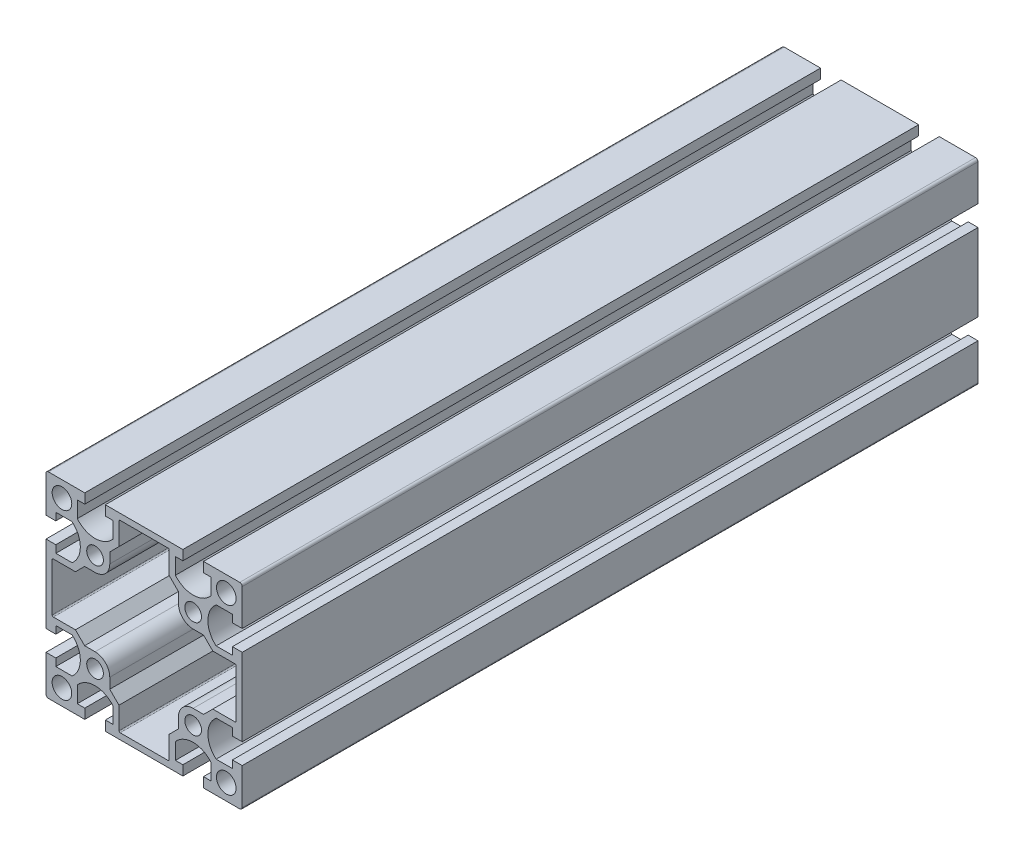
ISO-10303-21;
HEADER;
FILE_DESCRIPTION(('STEP AP214'),'2;1');
FILE_NAME('part.step','',(''),(''),'','','');
FILE_SCHEMA(('AUTOMOTIVE_DESIGN { 1 0 10303 214 1 1 1 1 }'));
ENDSEC;
DATA;
#1=APPLICATION_CONTEXT('core data for automotive mechanical design processes');
#2=APPLICATION_PROTOCOL_DEFINITION('international standard','automotive_design',2000,#1);
#3=PRODUCT_CONTEXT('',#1,'mechanical');
#4=PRODUCT('Part','Part','',(#3));
#5=PRODUCT_RELATED_PRODUCT_CATEGORY('part','',(#4));
#6=PRODUCT_DEFINITION_FORMATION('','',#4);
#7=PRODUCT_DEFINITION_CONTEXT('part definition',#1,'design');
#8=PRODUCT_DEFINITION('design','',#6,#7);
#9=PRODUCT_DEFINITION_SHAPE('','',#8);
#10=(LENGTH_UNIT() NAMED_UNIT(*) SI_UNIT(.MILLI.,.METRE.));
#11=(NAMED_UNIT(*) PLANE_ANGLE_UNIT() SI_UNIT($,.RADIAN.));
#12=(NAMED_UNIT(*) SI_UNIT($,.STERADIAN.) SOLID_ANGLE_UNIT());
#13=UNCERTAINTY_MEASURE_WITH_UNIT(LENGTH_MEASURE(1.E-05),#10,'distance_accuracy_value','');
#14=(GEOMETRIC_REPRESENTATION_CONTEXT(3) GLOBAL_UNCERTAINTY_ASSIGNED_CONTEXT((#13)) GLOBAL_UNIT_ASSIGNED_CONTEXT((#10,
#11,#12)) REPRESENTATION_CONTEXT('',''));
#15=CARTESIAN_POINT('',(0.,0.,0.));
#16=DIRECTION('',(0.,0.,1.));
#17=DIRECTION('',(1.,0.,0.));
#18=AXIS2_PLACEMENT_3D('',#15,#16,#17);
#19=CARTESIAN_POINT('',(35.4999999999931,19.9999999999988,150.));
#20=DIRECTION('',(0.,0.,1.));
#21=DIRECTION('',(1.,0.,0.));
#22=AXIS2_PLACEMENT_3D('',#19,#20,#21);
#23=PLANE('',#22);
#24=CARTESIAN_POINT('',(-20.0000000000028,-20.,150.));
#25=DIRECTION('',(0.,0.,1.));
#26=DIRECTION('',(1.,0.,0.));
#27=AXIS2_PLACEMENT_3D('',#24,#25,#26);
#28=CIRCLE('',#27,3.4);
#29=CARTESIAN_POINT('',(-16.6000000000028,-20.,150.));
#30=VERTEX_POINT('',#29);
#31=EDGE_CURVE('E2698',#30,#30,#28,.T.);
#32=ORIENTED_EDGE('',*,*,#31,.F.);
#33=EDGE_LOOP('',(#32));
#34=FACE_BOUND('',#33,.T.);
#35=CARTESIAN_POINT('',(-33.5000000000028,33.4999999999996,150.));
#36=DIRECTION('',(0.,0.,1.));
#37=DIRECTION('',(1.,0.,0.));
#38=AXIS2_PLACEMENT_3D('',#35,#36,#37);
#39=CIRCLE('',#38,4.);
#40=CARTESIAN_POINT('',(-29.5000000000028,33.4999999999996,150.));
#41=VERTEX_POINT('',#40);
#42=EDGE_CURVE('E2710',#41,#41,#39,.T.);
#43=ORIENTED_EDGE('',*,*,#42,.F.);
#44=EDGE_LOOP('',(#43));
#45=FACE_BOUND('',#44,.T.);
#46=CARTESIAN_POINT('',(-20.0000000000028,19.9999999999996,150.));
#47=DIRECTION('',(0.,0.,1.));
#48=DIRECTION('',(1.,0.,0.));
#49=AXIS2_PLACEMENT_3D('',#46,#47,#48);
#50=CIRCLE('',#49,3.4);
#51=CARTESIAN_POINT('',(-16.6000000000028,19.9999999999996,150.));
#52=VERTEX_POINT('',#51);
#53=EDGE_CURVE('E826',#52,#52,#50,.T.);
#54=ORIENTED_EDGE('',*,*,#53,.F.);
#55=EDGE_LOOP('',(#54));
#56=FACE_BOUND('',#55,.T.);
#57=CARTESIAN_POINT('',(33.4999999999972,33.4999999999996,150.));
#58=DIRECTION('',(0.,0.,1.));
#59=DIRECTION('',(1.,0.,0.));
#60=AXIS2_PLACEMENT_3D('',#57,#58,#59);
#61=CIRCLE('',#60,4.);
#62=CARTESIAN_POINT('',(37.4999999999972,33.4999999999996,150.));
#63=VERTEX_POINT('',#62);
#64=EDGE_CURVE('E1016',#63,#63,#61,.T.);
#65=ORIENTED_EDGE('',*,*,#64,.F.);
#66=EDGE_LOOP('',(#65));
#67=FACE_BOUND('',#66,.T.);
#68=DIRECTION('',(-1.,0.,0.));
#69=VECTOR('',#68,1.);
#70=CARTESIAN_POINT('',(39.9999999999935,15.7999999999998,150.));
#71=LINE('',#70,#69);
#72=CARTESIAN_POINT('',(39.9999999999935,15.7999999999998,150.));
#73=VERTEX_POINT('',#72);
#74=CARTESIAN_POINT('',(35.9999999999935,15.7999999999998,150.));
#75=VERTEX_POINT('',#74);
#76=EDGE_CURVE('E1028',#73,#75,#71,.T.);
#77=ORIENTED_EDGE('',*,*,#76,.T.);
#78=DIRECTION('',(0.,-1.,0.));
#79=VECTOR('',#78,1.);
#80=CARTESIAN_POINT('',(35.9999999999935,15.7999999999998,150.));
#81=LINE('',#80,#79);
#82=CARTESIAN_POINT('',(35.9999999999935,12.7499999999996,150.));
#83=VERTEX_POINT('',#82);
#84=EDGE_CURVE('E1031',#75,#83,#81,.T.);
#85=ORIENTED_EDGE('',*,*,#84,.T.);
#86=DIRECTION('',(-1.,0.,0.));
#87=VECTOR('',#86,1.);
#88=CARTESIAN_POINT('',(35.9999999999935,12.7499999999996,150.));
#89=LINE('',#88,#87);
#90=CARTESIAN_POINT('',(29.360985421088,12.7499999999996,150.));
#91=VERTEX_POINT('',#90);
#92=EDGE_CURVE('E1034',#83,#91,#89,.T.);
#93=ORIENTED_EDGE('',*,*,#92,.T.);
#94=CARTESIAN_POINT('',(35.4999999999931,19.9999999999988,150.));
#95=DIRECTION('',(0.,0.,-1.));
#96=DIRECTION('',(1.,0.,0.));
#97=AXIS2_PLACEMENT_3D('',#94,#95,#96);
#98=CIRCLE('',#97,9.49999999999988);
#99=CARTESIAN_POINT('',(29.3609854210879,27.2499999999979,150.));
#100=VERTEX_POINT('',#99);
#101=EDGE_CURVE('E1036',#91,#100,#98,.T.);
#102=ORIENTED_EDGE('',*,*,#101,.T.);
#103=DIRECTION('',(1.,0.,0.));
#104=VECTOR('',#103,1.);
#105=CARTESIAN_POINT('',(29.3609854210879,27.2499999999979,150.));
#106=LINE('',#105,#104);
#107=CARTESIAN_POINT('',(35.9999999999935,27.2499999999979,150.));
#108=VERTEX_POINT('',#107);
#109=EDGE_CURVE('E1038',#100,#108,#106,.T.);
#110=ORIENTED_EDGE('',*,*,#109,.T.);
#111=DIRECTION('',(0.,-1.,0.));
#112=VECTOR('',#111,1.);
#113=CARTESIAN_POINT('',(35.9999999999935,27.2499999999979,150.));
#114=LINE('',#113,#112);
#115=CARTESIAN_POINT('',(35.9999999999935,24.199999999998,150.));
#116=VERTEX_POINT('',#115);
#117=EDGE_CURVE('E1040',#108,#116,#114,.T.);
#118=ORIENTED_EDGE('',*,*,#117,.T.);
#119=DIRECTION('',(1.,0.,0.));
#120=VECTOR('',#119,1.);
#121=CARTESIAN_POINT('',(35.9999999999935,24.199999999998,150.));
#122=LINE('',#121,#120);
#123=CARTESIAN_POINT('',(40.0000000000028,24.199999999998,150.));
#124=VERTEX_POINT('',#123);
#125=EDGE_CURVE('E1042',#116,#124,#122,.T.);
#126=ORIENTED_EDGE('',*,*,#125,.T.);
#127=DIRECTION('',(0.,1.,0.));
#128=VECTOR('',#127,1.);
#129=CARTESIAN_POINT('',(40.0000000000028,24.199999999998,150.));
#130=LINE('',#129,#128);
#131=CARTESIAN_POINT('',(40.0000000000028,39.0000000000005,150.));
#132=VERTEX_POINT('',#131);
#133=EDGE_CURVE('E1044',#124,#132,#130,.T.);
#134=ORIENTED_EDGE('',*,*,#133,.T.);
#135=CARTESIAN_POINT('',(39.0000000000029,39.0000000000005,150.));
#136=DIRECTION('',(0.,0.,1.));
#137=DIRECTION('',(1.,0.,0.));
#138=AXIS2_PLACEMENT_3D('',#135,#136,#137);
#139=CIRCLE('',#138,0.999999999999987);
#140=CARTESIAN_POINT('',(39.0000000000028,40.0000000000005,150.));
#141=VERTEX_POINT('',#140);
#142=EDGE_CURVE('E1046',#132,#141,#139,.T.);
#143=ORIENTED_EDGE('',*,*,#142,.T.);
#144=DIRECTION('',(-1.,0.,0.));
#145=VECTOR('',#144,1.);
#146=CARTESIAN_POINT('',(39.0000000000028,40.0000000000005,150.));
#147=LINE('',#146,#145);
#148=CARTESIAN_POINT('',(24.2000000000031,40.0000000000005,150.));
#149=VERTEX_POINT('',#148);
#150=EDGE_CURVE('E1048',#141,#149,#147,.T.);
#151=ORIENTED_EDGE('',*,*,#150,.T.);
#152=DIRECTION('',(0.,-1.,0.));
#153=VECTOR('',#152,1.);
#154=CARTESIAN_POINT('',(24.2000000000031,40.0000000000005,150.));
#155=LINE('',#154,#153);
#156=CARTESIAN_POINT('',(24.2000000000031,36.0000000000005,150.));
#157=VERTEX_POINT('',#156);
#158=EDGE_CURVE('E1050',#149,#157,#155,.T.);
#159=ORIENTED_EDGE('',*,*,#158,.T.);
#160=DIRECTION('',(1.,0.,0.));
#161=VECTOR('',#160,1.);
#162=CARTESIAN_POINT('',(24.2000000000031,36.0000000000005,150.));
#163=LINE('',#162,#161);
#164=CARTESIAN_POINT('',(27.2500000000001,36.0000000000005,150.));
#165=VERTEX_POINT('',#164);
#166=EDGE_CURVE('E1052',#157,#165,#163,.T.);
#167=ORIENTED_EDGE('',*,*,#166,.T.);
#168=DIRECTION('',(0.,-1.,0.));
#169=VECTOR('',#168,1.);
#170=CARTESIAN_POINT('',(27.2500000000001,36.0000000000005,150.));
#171=LINE('',#170,#169);
#172=CARTESIAN_POINT('',(27.2500000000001,29.3609854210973,150.));
#173=VERTEX_POINT('',#172);
#174=EDGE_CURVE('E1054',#165,#173,#171,.T.);
#175=ORIENTED_EDGE('',*,*,#174,.T.);
#176=CARTESIAN_POINT('',(19.9999999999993,35.500000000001,150.));
#177=DIRECTION('',(0.,0.,-1.));
#178=DIRECTION('',(1.,0.,0.));
#179=AXIS2_PLACEMENT_3D('',#176,#177,#178);
#180=CIRCLE('',#179,9.50000000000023);
#181=CARTESIAN_POINT('',(12.7499999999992,29.3609854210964,150.));
#182=VERTEX_POINT('',#181);
#183=EDGE_CURVE('E1056',#173,#182,#180,.T.);
#184=ORIENTED_EDGE('',*,*,#183,.T.);
#185=DIRECTION('',(0.,1.,0.));
#186=VECTOR('',#185,1.);
#187=CARTESIAN_POINT('',(12.7499999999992,29.3609854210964,150.));
#188=LINE('',#187,#186);
#189=CARTESIAN_POINT('',(12.7499999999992,36.0000000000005,150.));
#190=VERTEX_POINT('',#189);
#191=EDGE_CURVE('E1058',#182,#190,#188,.T.);
#192=ORIENTED_EDGE('',*,*,#191,.T.);
#193=DIRECTION('',(1.,0.,0.));
#194=VECTOR('',#193,1.);
#195=CARTESIAN_POINT('',(12.7499999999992,36.0000000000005,150.));
#196=LINE('',#195,#194);
#197=CARTESIAN_POINT('',(15.7999999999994,36.0000000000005,150.));
#198=VERTEX_POINT('',#197);
#199=EDGE_CURVE('E1060',#190,#198,#196,.T.);
#200=ORIENTED_EDGE('',*,*,#199,.T.);
#201=DIRECTION('',(0.,1.,0.));
#202=VECTOR('',#201,1.);
#203=CARTESIAN_POINT('',(15.7999999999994,36.0000000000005,150.));
#204=LINE('',#203,#202);
#205=CARTESIAN_POINT('',(15.7999999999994,40.0000000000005,150.));
#206=VERTEX_POINT('',#205);
#207=EDGE_CURVE('E1062',#198,#206,#204,.T.);
#208=ORIENTED_EDGE('',*,*,#207,.T.);
#209=DIRECTION('',(-1.,0.,0.));
#210=VECTOR('',#209,1.);
#211=CARTESIAN_POINT('',(15.7999999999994,40.0000000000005,150.));
#212=LINE('',#211,#210);
#213=CARTESIAN_POINT('',(-15.8000000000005,40.0000000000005,150.));
#214=VERTEX_POINT('',#213);
#215=EDGE_CURVE('E1064',#206,#214,#212,.T.);
#216=ORIENTED_EDGE('',*,*,#215,.T.);
#217=DIRECTION('',(0.,-1.,0.));
#218=VECTOR('',#217,1.);
#219=CARTESIAN_POINT('',(-15.8000000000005,40.0000000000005,150.));
#220=LINE('',#219,#218);
#221=CARTESIAN_POINT('',(-15.8000000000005,36.0000000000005,150.));
#222=VERTEX_POINT('',#221);
#223=EDGE_CURVE('E1066',#214,#222,#220,.T.);
#224=ORIENTED_EDGE('',*,*,#223,.T.);
#225=DIRECTION('',(1.,0.,0.));
#226=VECTOR('',#225,1.);
#227=CARTESIAN_POINT('',(-15.8000000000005,36.0000000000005,150.));
#228=LINE('',#227,#226);
#229=CARTESIAN_POINT('',(-12.7500000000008,36.0000000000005,150.));
#230=VERTEX_POINT('',#229);
#231=EDGE_CURVE('E1068',#222,#230,#228,.T.);
#232=ORIENTED_EDGE('',*,*,#231,.T.);
#233=DIRECTION('',(0.,-1.,0.));
#234=VECTOR('',#233,1.);
#235=CARTESIAN_POINT('',(-12.7500000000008,36.0000000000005,150.));
#236=LINE('',#235,#234);
#237=CARTESIAN_POINT('',(-12.7500000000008,29.3609854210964,150.));
#238=VERTEX_POINT('',#237);
#239=EDGE_CURVE('E1070',#230,#238,#236,.T.);
#240=ORIENTED_EDGE('',*,*,#239,.T.);
#241=CARTESIAN_POINT('',(-20.0000000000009,35.500000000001,150.));
#242=DIRECTION('',(0.,0.,-1.));
#243=DIRECTION('',(1.,0.,0.));
#244=AXIS2_PLACEMENT_3D('',#241,#242,#243);
#245=CIRCLE('',#244,9.50000000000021);
#246=CARTESIAN_POINT('',(-27.2500000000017,29.3609854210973,150.));
#247=VERTEX_POINT('',#246);
#248=EDGE_CURVE('E1072',#238,#247,#245,.T.);
#249=ORIENTED_EDGE('',*,*,#248,.T.);
#250=DIRECTION('',(0.,1.,0.));
#251=VECTOR('',#250,1.);
#252=CARTESIAN_POINT('',(-27.2500000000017,29.3609854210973,150.));
#253=LINE('',#252,#251);
#254=CARTESIAN_POINT('',(-27.2500000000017,36.0000000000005,150.));
#255=VERTEX_POINT('',#254);
#256=EDGE_CURVE('E1074',#247,#255,#253,.T.);
#257=ORIENTED_EDGE('',*,*,#256,.T.);
#258=DIRECTION('',(1.,0.,0.));
#259=VECTOR('',#258,1.);
#260=CARTESIAN_POINT('',(-27.2500000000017,36.0000000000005,150.));
#261=LINE('',#260,#259);
#262=CARTESIAN_POINT('',(-24.2000000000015,36.0000000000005,150.));
#263=VERTEX_POINT('',#262);
#264=EDGE_CURVE('E1076',#255,#263,#261,.T.);
#265=ORIENTED_EDGE('',*,*,#264,.T.);
#266=DIRECTION('',(0.,1.,0.));
#267=VECTOR('',#266,1.);
#268=CARTESIAN_POINT('',(-24.2000000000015,36.0000000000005,150.));
#269=LINE('',#268,#267);
#270=CARTESIAN_POINT('',(-24.2000000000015,40.0000000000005,150.));
#271=VERTEX_POINT('',#270);
#272=EDGE_CURVE('E1078',#263,#271,#269,.T.);
#273=ORIENTED_EDGE('',*,*,#272,.T.);
#274=DIRECTION('',(-1.,0.,0.));
#275=VECTOR('',#274,1.);
#276=CARTESIAN_POINT('',(-24.2000000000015,40.0000000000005,150.));
#277=LINE('',#276,#275);
#278=CARTESIAN_POINT('',(-39.0000000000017,40.0000000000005,150.));
#279=VERTEX_POINT('',#278);
#280=EDGE_CURVE('E1080',#271,#279,#277,.T.);
#281=ORIENTED_EDGE('',*,*,#280,.T.);
#282=CARTESIAN_POINT('',(-39.0000000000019,39.0000000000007,150.));
#283=DIRECTION('',(0.,0.,1.));
#284=DIRECTION('',(1.,0.,0.));
#285=AXIS2_PLACEMENT_3D('',#282,#283,#284);
#286=CIRCLE('',#285,0.999999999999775);
#287=CARTESIAN_POINT('',(-40.0000000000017,39.000000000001,150.));
#288=VERTEX_POINT('',#287);
#289=EDGE_CURVE('E1082',#279,#288,#286,.T.);
#290=ORIENTED_EDGE('',*,*,#289,.T.);
#291=DIRECTION('',(0.,-1.,0.));
#292=VECTOR('',#291,1.);
#293=CARTESIAN_POINT('',(-40.0000000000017,39.000000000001,150.));
#294=LINE('',#293,#292);
#295=CARTESIAN_POINT('',(-40.0000000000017,24.2000000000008,150.));
#296=VERTEX_POINT('',#295);
#297=EDGE_CURVE('E1084',#288,#296,#294,.T.);
#298=ORIENTED_EDGE('',*,*,#297,.T.);
#299=DIRECTION('',(1.,0.,0.));
#300=VECTOR('',#299,1.);
#301=CARTESIAN_POINT('',(-40.0000000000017,24.2000000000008,150.));
#302=LINE('',#301,#300);
#303=CARTESIAN_POINT('',(-36.0000000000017,24.2000000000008,150.));
#304=VERTEX_POINT('',#303);
#305=EDGE_CURVE('E1086',#296,#304,#302,.T.);
#306=ORIENTED_EDGE('',*,*,#305,.T.);
#307=DIRECTION('',(0.,1.,0.));
#308=VECTOR('',#307,1.);
#309=CARTESIAN_POINT('',(-36.0000000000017,24.2000000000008,150.));
#310=LINE('',#309,#308);
#311=CARTESIAN_POINT('',(-36.0000000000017,27.2500000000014,150.));
#312=VERTEX_POINT('',#311);
#313=EDGE_CURVE('E1088',#304,#312,#310,.T.);
#314=ORIENTED_EDGE('',*,*,#313,.T.);
#315=DIRECTION('',(1.,0.,0.));
#316=VECTOR('',#315,1.);
#317=CARTESIAN_POINT('',(-36.0000000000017,27.2500000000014,150.));
#318=LINE('',#317,#316);
#319=CARTESIAN_POINT('',(-29.3609854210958,27.2500000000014,150.));
#320=VERTEX_POINT('',#319);
#321=EDGE_CURVE('E1090',#312,#320,#318,.T.);
#322=ORIENTED_EDGE('',*,*,#321,.T.);
#323=CARTESIAN_POINT('',(-35.5000000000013,20.0000000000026,150.));
#324=DIRECTION('',(0.,0.,-1.));
#325=DIRECTION('',(1.,0.,0.));
#326=AXIS2_PLACEMENT_3D('',#323,#324,#325);
#327=CIRCLE('',#326,9.49999999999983);
#328=CARTESIAN_POINT('',(-29.360985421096,12.7500000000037,150.));
#329=VERTEX_POINT('',#328);
#330=EDGE_CURVE('E1092',#320,#329,#327,.T.);
#331=ORIENTED_EDGE('',*,*,#330,.T.);
#332=DIRECTION('',(-1.,0.,0.));
#333=VECTOR('',#332,1.);
#334=CARTESIAN_POINT('',(-29.360985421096,12.7500000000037,150.));
#335=LINE('',#334,#333);
#336=CARTESIAN_POINT('',(-36.0000000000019,12.7500000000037,150.));
#337=VERTEX_POINT('',#336);
#338=EDGE_CURVE('E1094',#329,#337,#335,.T.);
#339=ORIENTED_EDGE('',*,*,#338,.T.);
#340=DIRECTION('',(0.,1.,0.));
#341=VECTOR('',#340,1.);
#342=CARTESIAN_POINT('',(-36.0000000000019,12.7500000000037,150.));
#343=LINE('',#342,#341);
#344=CARTESIAN_POINT('',(-36.0000000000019,15.8000000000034,150.));
#345=VERTEX_POINT('',#344);
#346=EDGE_CURVE('E1096',#337,#345,#343,.T.);
#347=ORIENTED_EDGE('',*,*,#346,.T.);
#348=DIRECTION('',(-1.,0.,0.));
#349=VECTOR('',#348,1.);
#350=CARTESIAN_POINT('',(-36.0000000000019,15.8000000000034,150.));
#351=LINE('',#350,#349);
#352=CARTESIAN_POINT('',(-40.0000000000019,15.8000000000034,150.));
#353=VERTEX_POINT('',#352);
#354=EDGE_CURVE('E1098',#345,#353,#351,.T.);
#355=ORIENTED_EDGE('',*,*,#354,.T.);
#356=DIRECTION('',(0.,-1.,0.));
#357=VECTOR('',#356,1.);
#358=CARTESIAN_POINT('',(-40.0000000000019,15.8000000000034,150.));
#359=LINE('',#358,#357);
#360=CARTESIAN_POINT('',(-40.0000000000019,-15.7999999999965,150.));
#361=VERTEX_POINT('',#360);
#362=EDGE_CURVE('E1100',#353,#361,#359,.T.);
#363=ORIENTED_EDGE('',*,*,#362,.T.);
#364=DIRECTION('',(1.,0.,0.));
#365=VECTOR('',#364,1.);
#366=CARTESIAN_POINT('',(-40.0000000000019,-15.7999999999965,150.));
#367=LINE('',#366,#365);
#368=CARTESIAN_POINT('',(-36.0000000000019,-15.7999999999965,150.));
#369=VERTEX_POINT('',#368);
#370=EDGE_CURVE('E1102',#361,#369,#367,.T.);
#371=ORIENTED_EDGE('',*,*,#370,.T.);
#372=DIRECTION('',(0.,1.,0.));
#373=VECTOR('',#372,1.);
#374=CARTESIAN_POINT('',(-36.0000000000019,-15.7999999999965,150.));
#375=LINE('',#374,#373);
#376=CARTESIAN_POINT('',(-36.0000000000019,-12.7499999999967,150.));
#377=VERTEX_POINT('',#376);
#378=EDGE_CURVE('E1104',#369,#377,#375,.T.);
#379=ORIENTED_EDGE('',*,*,#378,.T.);
#380=DIRECTION('',(1.,0.,0.));
#381=VECTOR('',#380,1.);
#382=CARTESIAN_POINT('',(-36.0000000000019,-12.7499999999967,150.));
#383=LINE('',#382,#381);
#384=CARTESIAN_POINT('',(-29.3609854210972,-12.7499999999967,150.));
#385=VERTEX_POINT('',#384);
#386=EDGE_CURVE('E1106',#377,#385,#383,.T.);
#387=ORIENTED_EDGE('',*,*,#386,.T.);
#388=CARTESIAN_POINT('',(-35.5000000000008,-19.9999999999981,150.));
#389=DIRECTION('',(0.,0.,-1.));
#390=DIRECTION('',(1.,0.,0.));
#391=AXIS2_PLACEMENT_3D('',#388,#389,#390);
#392=CIRCLE('',#391,9.50000000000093);
#393=CARTESIAN_POINT('',(-29.360985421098,-27.2500000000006,150.));
#394=VERTEX_POINT('',#393);
#395=EDGE_CURVE('E1108',#385,#394,#392,.T.);
#396=ORIENTED_EDGE('',*,*,#395,.T.);
#397=DIRECTION('',(-1.,1.3691717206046E-13,0.));
#398=VECTOR('',#397,1.);
#399=CARTESIAN_POINT('',(-29.3609854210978,-27.2500000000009,150.));
#400=LINE('',#399,#398);
#401=CARTESIAN_POINT('',(-36.0000000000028,-27.2499999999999,150.));
#402=VERTEX_POINT('',#401);
#403=EDGE_CURVE('E1110',#394,#402,#400,.T.);
#404=ORIENTED_EDGE('',*,*,#403,.T.);
#405=DIRECTION('',(0.,1.,0.));
#406=VECTOR('',#405,1.);
#407=CARTESIAN_POINT('',(-36.0000000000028,-27.2499999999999,150.));
#408=LINE('',#407,#406);
#409=CARTESIAN_POINT('',(-36.0000000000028,-24.2000000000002,150.));
#410=VERTEX_POINT('',#409);
#411=EDGE_CURVE('E1112',#402,#410,#408,.T.);
#412=ORIENTED_EDGE('',*,*,#411,.T.);
#413=DIRECTION('',(-1.,0.,0.));
#414=VECTOR('',#413,1.);
#415=CARTESIAN_POINT('',(-36.0000000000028,-24.2000000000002,150.));
#416=LINE('',#415,#414);
#417=CARTESIAN_POINT('',(-40.0000000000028,-24.2000000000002,150.));
#418=VERTEX_POINT('',#417);
#419=EDGE_CURVE('E1114',#410,#418,#416,.T.);
#420=ORIENTED_EDGE('',*,*,#419,.T.);
#421=DIRECTION('',(0.,-1.,0.));
#422=VECTOR('',#421,1.);
#423=CARTESIAN_POINT('',(-40.0000000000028,-24.2000000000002,150.));
#424=LINE('',#423,#422);
#425=CARTESIAN_POINT('',(-40.0000000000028,-38.9999999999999,150.));
#426=VERTEX_POINT('',#425);
#427=EDGE_CURVE('E1116',#418,#426,#424,.T.);
#428=ORIENTED_EDGE('',*,*,#427,.T.);
#429=CARTESIAN_POINT('',(-39.0000000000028,-38.9999999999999,150.));
#430=DIRECTION('',(0.,0.,1.));
#431=DIRECTION('',(1.,0.,0.));
#432=AXIS2_PLACEMENT_3D('',#429,#430,#431);
#433=CIRCLE('',#432,1.);
#434=CARTESIAN_POINT('',(-39.0000000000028,-39.9999999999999,150.));
#435=VERTEX_POINT('',#434);
#436=EDGE_CURVE('E1118',#426,#435,#433,.T.);
#437=ORIENTED_EDGE('',*,*,#436,.T.);
#438=DIRECTION('',(1.,0.,0.));
#439=VECTOR('',#438,1.);
#440=CARTESIAN_POINT('',(-39.0000000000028,-39.9999999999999,150.));
#441=LINE('',#440,#439);
#442=CARTESIAN_POINT('',(-24.2000000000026,-39.9999999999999,150.));
#443=VERTEX_POINT('',#442);
#444=EDGE_CURVE('E1120',#435,#443,#441,.T.);
#445=ORIENTED_EDGE('',*,*,#444,.T.);
#446=DIRECTION('',(0.,1.,0.));
#447=VECTOR('',#446,1.);
#448=CARTESIAN_POINT('',(-24.2000000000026,-39.9999999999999,150.));
#449=LINE('',#448,#447);
#450=CARTESIAN_POINT('',(-24.2000000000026,-36.,150.));
#451=VERTEX_POINT('',#450);
#452=EDGE_CURVE('E1122',#443,#451,#449,.T.);
#453=ORIENTED_EDGE('',*,*,#452,.T.);
#454=DIRECTION('',(-1.,0.,0.));
#455=VECTOR('',#454,1.);
#456=CARTESIAN_POINT('',(-24.2000000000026,-36.,150.));
#457=LINE('',#456,#455);
#458=CARTESIAN_POINT('',(-27.2500000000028,-36.,150.));
#459=VERTEX_POINT('',#458);
#460=EDGE_CURVE('E1124',#451,#459,#457,.T.);
#461=ORIENTED_EDGE('',*,*,#460,.T.);
#462=DIRECTION('',(0.,1.,0.));
#463=VECTOR('',#462,1.);
#464=CARTESIAN_POINT('',(-27.2500000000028,-36.,150.));
#465=LINE('',#464,#463);
#466=CARTESIAN_POINT('',(-27.2500000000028,-29.3609854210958,150.));
#467=VERTEX_POINT('',#466);
#468=EDGE_CURVE('E1126',#459,#467,#465,.T.);
#469=ORIENTED_EDGE('',*,*,#468,.T.);
#470=CARTESIAN_POINT('',(-20.0000000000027,-35.4999999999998,150.));
#471=DIRECTION('',(0.,0.,-1.));
#472=DIRECTION('',(1.,0.,0.));
#473=AXIS2_PLACEMENT_3D('',#470,#471,#472);
#474=CIRCLE('',#473,9.49999999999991);
#475=CARTESIAN_POINT('',(-12.7500000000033,-29.3609854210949,150.));
#476=VERTEX_POINT('',#475);
#477=EDGE_CURVE('E1128',#467,#476,#474,.T.);
#478=ORIENTED_EDGE('',*,*,#477,.T.);
#479=DIRECTION('',(0.,-1.,0.));
#480=VECTOR('',#479,1.);
#481=CARTESIAN_POINT('',(-12.7500000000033,-29.3609854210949,150.));
#482=LINE('',#481,#480);
#483=CARTESIAN_POINT('',(-12.7500000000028,-36.,150.));
#484=VERTEX_POINT('',#483);
#485=EDGE_CURVE('E1130',#476,#484,#482,.T.);
#486=ORIENTED_EDGE('',*,*,#485,.T.);
#487=DIRECTION('',(-1.,0.,0.));
#488=VECTOR('',#487,1.);
#489=CARTESIAN_POINT('',(-12.7500000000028,-36.,150.));
#490=LINE('',#489,#488);
#491=CARTESIAN_POINT('',(-15.8000000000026,-36.,150.));
#492=VERTEX_POINT('',#491);
#493=EDGE_CURVE('E1132',#484,#492,#490,.T.);
#494=ORIENTED_EDGE('',*,*,#493,.T.);
#495=DIRECTION('',(0.,-1.,0.));
#496=VECTOR('',#495,1.);
#497=CARTESIAN_POINT('',(-15.8000000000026,-36.,150.));
#498=LINE('',#497,#496);
#499=CARTESIAN_POINT('',(-15.8000000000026,-40.0000000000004,150.));
#500=VERTEX_POINT('',#499);
#501=EDGE_CURVE('E1134',#492,#500,#498,.T.);
#502=ORIENTED_EDGE('',*,*,#501,.T.);
#503=DIRECTION('',(1.,0.,0.));
#504=VECTOR('',#503,1.);
#505=CARTESIAN_POINT('',(-15.8000000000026,-40.0000000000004,150.));
#506=LINE('',#505,#504);
#507=CARTESIAN_POINT('',(15.7999999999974,-39.9999999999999,150.));
#508=VERTEX_POINT('',#507);
#509=EDGE_CURVE('E1136',#500,#508,#506,.T.);
#510=ORIENTED_EDGE('',*,*,#509,.T.);
#511=DIRECTION('',(0.,1.,0.));
#512=VECTOR('',#511,1.);
#513=CARTESIAN_POINT('',(15.7999999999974,-39.9999999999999,150.));
#514=LINE('',#513,#512);
#515=CARTESIAN_POINT('',(15.7999999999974,-36.,150.));
#516=VERTEX_POINT('',#515);
#517=EDGE_CURVE('E1138',#508,#516,#514,.T.);
#518=ORIENTED_EDGE('',*,*,#517,.T.);
#519=DIRECTION('',(-1.,0.,0.));
#520=VECTOR('',#519,1.);
#521=CARTESIAN_POINT('',(15.7999999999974,-36.,150.));
#522=LINE('',#521,#520);
#523=CARTESIAN_POINT('',(12.7499999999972,-36.,150.));
#524=VERTEX_POINT('',#523);
#525=EDGE_CURVE('E1140',#516,#524,#522,.T.);
#526=ORIENTED_EDGE('',*,*,#525,.T.);
#527=DIRECTION('',(1.3796234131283E-13,1.,0.));
#528=VECTOR('',#527,1.);
#529=CARTESIAN_POINT('',(12.7499999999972,-36.,150.));
#530=LINE('',#529,#528);
#531=CARTESIAN_POINT('',(12.7499999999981,-29.3609854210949,150.));
#532=VERTEX_POINT('',#531);
#533=EDGE_CURVE('E1142',#524,#532,#530,.T.);
#534=ORIENTED_EDGE('',*,*,#533,.T.);
#535=CARTESIAN_POINT('',(19.9999999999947,-35.5000000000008,150.));
#536=DIRECTION('',(0.,0.,-1.));
#537=DIRECTION('',(1.,0.,0.));
#538=AXIS2_PLACEMENT_3D('',#535,#536,#537);
#539=CIRCLE('',#538,9.4999999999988);
#540=CARTESIAN_POINT('',(27.2499999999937,-29.360985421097,150.));
#541=VERTEX_POINT('',#540);
#542=EDGE_CURVE('E1144',#532,#541,#539,.T.);
#543=ORIENTED_EDGE('',*,*,#542,.T.);
#544=DIRECTION('',(0.,-1.,0.));
#545=VECTOR('',#544,1.);
#546=CARTESIAN_POINT('',(27.2499999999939,-29.3609854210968,150.));
#547=LINE('',#546,#545);
#548=CARTESIAN_POINT('',(27.2499999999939,-36.0000000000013,150.));
#549=VERTEX_POINT('',#548);
#550=EDGE_CURVE('E1146',#541,#549,#547,.T.);
#551=ORIENTED_EDGE('',*,*,#550,.T.);
#552=DIRECTION('',(-1.,0.,0.));
#553=VECTOR('',#552,1.);
#554=CARTESIAN_POINT('',(27.2499999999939,-36.0000000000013,150.));
#555=LINE('',#554,#553);
#556=CARTESIAN_POINT('',(24.1999999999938,-36.0000000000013,150.));
#557=VERTEX_POINT('',#556);
#558=EDGE_CURVE('E1148',#549,#557,#555,.T.);
#559=ORIENTED_EDGE('',*,*,#558,.T.);
#560=DIRECTION('',(0.,-1.,0.));
#561=VECTOR('',#560,1.);
#562=CARTESIAN_POINT('',(24.1999999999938,-36.0000000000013,150.));
#563=LINE('',#562,#561);
#564=CARTESIAN_POINT('',(24.1999999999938,-40.0000000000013,150.));
#565=VERTEX_POINT('',#564);
#566=EDGE_CURVE('E1150',#557,#565,#563,.T.);
#567=ORIENTED_EDGE('',*,*,#566,.T.);
#568=DIRECTION('',(1.,0.,0.));
#569=VECTOR('',#568,1.);
#570=CARTESIAN_POINT('',(24.1999999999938,-40.0000000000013,150.));
#571=LINE('',#570,#569);
#572=CARTESIAN_POINT('',(38.9999999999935,-40.0000000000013,150.));
#573=VERTEX_POINT('',#572);
#574=EDGE_CURVE('E1152',#565,#573,#571,.T.);
#575=ORIENTED_EDGE('',*,*,#574,.T.);
#576=CARTESIAN_POINT('',(38.9999999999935,-39.0000000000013,150.));
#577=DIRECTION('',(0.,0.,1.));
#578=DIRECTION('',(1.,0.,0.));
#579=AXIS2_PLACEMENT_3D('',#576,#577,#578);
#580=CIRCLE('',#579,0.999999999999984);
#581=CARTESIAN_POINT('',(39.9999999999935,-39.0000000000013,150.));
#582=VERTEX_POINT('',#581);
#583=EDGE_CURVE('E1154',#573,#582,#580,.T.);
#584=ORIENTED_EDGE('',*,*,#583,.T.);
#585=DIRECTION('',(0.,1.,0.));
#586=VECTOR('',#585,1.);
#587=CARTESIAN_POINT('',(39.9999999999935,-39.0000000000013,150.));
#588=LINE('',#587,#586);
#589=CARTESIAN_POINT('',(39.9999999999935,-24.2000000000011,150.));
#590=VERTEX_POINT('',#589);
#591=EDGE_CURVE('E1156',#582,#590,#588,.T.);
#592=ORIENTED_EDGE('',*,*,#591,.T.);
#593=DIRECTION('',(-1.,0.,0.));
#594=VECTOR('',#593,1.);
#595=CARTESIAN_POINT('',(39.9999999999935,-24.2000000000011,150.));
#596=LINE('',#595,#594);
#597=CARTESIAN_POINT('',(35.9999999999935,-24.2000000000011,150.));
#598=VERTEX_POINT('',#597);
#599=EDGE_CURVE('E1158',#590,#598,#596,.T.);
#600=ORIENTED_EDGE('',*,*,#599,.T.);
#601=DIRECTION('',(0.,-1.,0.));
#602=VECTOR('',#601,1.);
#603=CARTESIAN_POINT('',(35.9999999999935,-24.2000000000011,150.));
#604=LINE('',#603,#602);
#605=CARTESIAN_POINT('',(35.9999999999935,-27.2500000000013,150.));
#606=VERTEX_POINT('',#605);
#607=EDGE_CURVE('E1160',#598,#606,#604,.T.);
#608=ORIENTED_EDGE('',*,*,#607,.T.);
#609=DIRECTION('',(-1.,0.,0.));
#610=VECTOR('',#609,1.);
#611=CARTESIAN_POINT('',(35.9999999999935,-27.2500000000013,150.));
#612=LINE('',#611,#610);
#613=CARTESIAN_POINT('',(29.3609854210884,-27.2500000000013,150.));
#614=VERTEX_POINT('',#613);
#615=EDGE_CURVE('E1162',#606,#614,#612,.T.);
#616=ORIENTED_EDGE('',*,*,#615,.T.);
#617=CARTESIAN_POINT('',(35.4999999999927,-20.0000000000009,150.));
#618=DIRECTION('',(0.,0.,-1.));
#619=DIRECTION('',(1.,0.,0.));
#620=AXIS2_PLACEMENT_3D('',#617,#618,#619);
#621=CIRCLE('',#620,9.50000000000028);
#622=CARTESIAN_POINT('',(29.3609854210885,-12.7500000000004,150.));
#623=VERTEX_POINT('',#622);
#624=EDGE_CURVE('E1164',#614,#623,#621,.T.);
#625=ORIENTED_EDGE('',*,*,#624,.T.);
#626=DIRECTION('',(1.,0.,0.));
#627=VECTOR('',#626,1.);
#628=CARTESIAN_POINT('',(29.3609854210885,-12.7500000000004,150.));
#629=LINE('',#628,#627);
#630=CARTESIAN_POINT('',(35.9999999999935,-12.7500000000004,150.));
#631=VERTEX_POINT('',#630);
#632=EDGE_CURVE('E1166',#623,#631,#629,.T.);
#633=ORIENTED_EDGE('',*,*,#632,.T.);
#634=DIRECTION('',(0.,-1.,0.));
#635=VECTOR('',#634,1.);
#636=CARTESIAN_POINT('',(35.9999999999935,-12.7500000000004,150.));
#637=LINE('',#636,#635);
#638=CARTESIAN_POINT('',(35.9999999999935,-15.8000000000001,150.));
#639=VERTEX_POINT('',#638);
#640=EDGE_CURVE('E1168',#631,#639,#637,.T.);
#641=ORIENTED_EDGE('',*,*,#640,.T.);
#642=DIRECTION('',(1.,0.,0.));
#643=VECTOR('',#642,1.);
#644=CARTESIAN_POINT('',(35.9999999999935,-15.8000000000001,150.));
#645=LINE('',#644,#643);
#646=CARTESIAN_POINT('',(39.9999999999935,-15.8000000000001,150.));
#647=VERTEX_POINT('',#646);
#648=EDGE_CURVE('E1170',#639,#647,#645,.T.);
#649=ORIENTED_EDGE('',*,*,#648,.T.);
#650=DIRECTION('',(0.,1.,0.));
#651=VECTOR('',#650,1.);
#652=CARTESIAN_POINT('',(39.9999999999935,-15.8000000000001,150.));
#653=LINE('',#652,#651);
#654=EDGE_CURVE('E1172',#647,#73,#653,.T.);
#655=ORIENTED_EDGE('',*,*,#654,.T.);
#656=EDGE_LOOP('',(#77,#85,#93,#102,#110,#118,#126,#134,#143,#151,#159,#167,#175,#184,#192,#200,
#208,#216,#224,#232,#240,#249,#257,#265,#273,#281,#290,#298,#306,#314,#322,#331,#339,#347,#355,
#363,#371,#379,#387,#396,#404,#412,#420,#428,#437,#445,#453,#461,#469,#478,#486,#494,#502,#510,
#518,#526,#534,#543,#551,#559,#567,#575,#584,#592,#600,#608,#616,#625,#633,#641,#649,#655));
#657=FACE_BOUND('',#656,.T.);
#658=CARTESIAN_POINT('',(33.4999999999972,-33.5000000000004,150.));
#659=DIRECTION('',(0.,0.,1.));
#660=DIRECTION('',(1.,0.,0.));
#661=AXIS2_PLACEMENT_3D('',#658,#659,#660);
#662=CIRCLE('',#661,4.);
#663=CARTESIAN_POINT('',(37.4999999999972,-33.5000000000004,150.));
#664=VERTEX_POINT('',#663);
#665=EDGE_CURVE('E1022',#664,#664,#662,.T.);
#666=ORIENTED_EDGE('',*,*,#665,.F.);
#667=EDGE_LOOP('',(#666));
#668=FACE_BOUND('',#667,.T.);
#669=DIRECTION('',(0.,-1.,0.));
#670=VECTOR('',#669,1.);
#671=CARTESIAN_POINT('',(-10.2500000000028,-28.,150.));
#672=LINE('',#671,#670);
#673=CARTESIAN_POINT('',(-10.2500000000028,-28.,150.));
#674=VERTEX_POINT('',#673);
#675=CARTESIAN_POINT('',(-10.2500000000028,-37.,150.));
#676=VERTEX_POINT('',#675);
#677=EDGE_CURVE('E732',#674,#676,#672,.T.);
#678=ORIENTED_EDGE('',*,*,#677,.F.);
#679=DIRECTION('',(0.707106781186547,-0.707106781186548,0.));
#680=VECTOR('',#679,1.);
#681=CARTESIAN_POINT('',(-14.0000000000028,-24.2499999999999,150.));
#682=LINE('',#681,#680);
#683=CARTESIAN_POINT('',(-14.0000000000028,-24.2499999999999,150.));
#684=VERTEX_POINT('',#683);
#685=EDGE_CURVE('E724',#684,#674,#682,.T.);
#686=ORIENTED_EDGE('',*,*,#685,.F.);
#687=DIRECTION('',(0.,-1.,0.));
#688=VECTOR('',#687,1.);
#689=CARTESIAN_POINT('',(-14.0000000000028,-19.9999999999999,150.));
#690=LINE('',#689,#688);
#691=CARTESIAN_POINT('',(-14.0000000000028,-19.9999999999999,150.));
#692=VERTEX_POINT('',#691);
#693=EDGE_CURVE('E823',#692,#684,#690,.T.);
#694=ORIENTED_EDGE('',*,*,#693,.F.);
#695=CARTESIAN_POINT('',(-20.0000000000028,-20.,150.));
#696=DIRECTION('',(0.,0.,-1.));
#697=DIRECTION('',(1.,0.,0.));
#698=AXIS2_PLACEMENT_3D('',#695,#696,#697);
#699=CIRCLE('',#698,6.00000000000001);
#700=CARTESIAN_POINT('',(-20.0000000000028,-13.9999999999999,150.));
#701=VERTEX_POINT('',#700);
#702=EDGE_CURVE('E821',#701,#692,#699,.T.);
#703=ORIENTED_EDGE('',*,*,#702,.F.);
#704=DIRECTION('',(1.,0.,0.));
#705=VECTOR('',#704,1.);
#706=CARTESIAN_POINT('',(-24.2500000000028,-13.9999999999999,150.));
#707=LINE('',#706,#705);
#708=CARTESIAN_POINT('',(-24.2500000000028,-13.9999999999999,150.));
#709=VERTEX_POINT('',#708);
#710=EDGE_CURVE('E819',#709,#701,#707,.T.);
#711=ORIENTED_EDGE('',*,*,#710,.F.);
#712=DIRECTION('',(0.707106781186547,-0.707106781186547,0.));
#713=VECTOR('',#712,1.);
#714=CARTESIAN_POINT('',(-28.0000000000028,-10.2499999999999,150.));
#715=LINE('',#714,#713);
#716=CARTESIAN_POINT('',(-28.0000000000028,-10.2499999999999,150.));
#717=VERTEX_POINT('',#716);
#718=EDGE_CURVE('E817',#717,#709,#715,.T.);
#719=ORIENTED_EDGE('',*,*,#718,.F.);
#720=DIRECTION('',(1.,0.,0.));
#721=VECTOR('',#720,1.);
#722=CARTESIAN_POINT('',(-37.0000000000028,-10.2499999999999,150.));
#723=LINE('',#722,#721);
#724=CARTESIAN_POINT('',(-37.0000000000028,-10.2499999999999,150.));
#725=VERTEX_POINT('',#724);
#726=EDGE_CURVE('E815',#725,#717,#723,.T.);
#727=ORIENTED_EDGE('',*,*,#726,.F.);
#728=CARTESIAN_POINT('',(-37.0000000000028,-9.74999999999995,150.));
#729=DIRECTION('',(0.,0.,1.));
#730=DIRECTION('',(1.,0.,0.));
#731=AXIS2_PLACEMENT_3D('',#728,#729,#730);
#732=CIRCLE('',#731,0.5);
#733=CARTESIAN_POINT('',(-37.5000000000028,-9.74999999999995,150.));
#734=VERTEX_POINT('',#733);
#735=EDGE_CURVE('E813',#734,#725,#732,.T.);
#736=ORIENTED_EDGE('',*,*,#735,.F.);
#737=DIRECTION('',(0.,-1.,0.));
#738=VECTOR('',#737,1.);
#739=CARTESIAN_POINT('',(-37.5000000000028,9.7499999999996,150.));
#740=LINE('',#739,#738);
#741=CARTESIAN_POINT('',(-37.5000000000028,9.7499999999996,150.));
#742=VERTEX_POINT('',#741);
#743=EDGE_CURVE('E811',#742,#734,#740,.T.);
#744=ORIENTED_EDGE('',*,*,#743,.F.);
#745=CARTESIAN_POINT('',(-37.0000000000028,9.74999999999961,150.));
#746=DIRECTION('',(0.,0.,1.));
#747=DIRECTION('',(1.,0.,0.));
#748=AXIS2_PLACEMENT_3D('',#745,#746,#747);
#749=CIRCLE('',#748,0.49999999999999);
#750=CARTESIAN_POINT('',(-37.0000000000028,10.2499999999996,150.));
#751=VERTEX_POINT('',#750);
#752=EDGE_CURVE('E809',#751,#742,#749,.T.);
#753=ORIENTED_EDGE('',*,*,#752,.F.);
#754=DIRECTION('',(-1.,0.,0.));
#755=VECTOR('',#754,1.);
#756=CARTESIAN_POINT('',(-28.0000000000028,10.2500000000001,150.));
#757=LINE('',#756,#755);
#758=CARTESIAN_POINT('',(-28.0000000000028,10.2500000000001,150.));
#759=VERTEX_POINT('',#758);
#760=EDGE_CURVE('E807',#759,#751,#757,.T.);
#761=ORIENTED_EDGE('',*,*,#760,.F.);
#762=DIRECTION('',(-0.70710678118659,-0.707106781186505,0.));
#763=VECTOR('',#762,1.);
#764=CARTESIAN_POINT('',(-24.2500000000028,13.9999999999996,150.));
#765=LINE('',#764,#763);
#766=CARTESIAN_POINT('',(-24.2500000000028,13.9999999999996,150.));
#767=VERTEX_POINT('',#766);
#768=EDGE_CURVE('E805',#767,#759,#765,.T.);
#769=ORIENTED_EDGE('',*,*,#768,.F.);
#770=DIRECTION('',(-1.,0.,0.));
#771=VECTOR('',#770,1.);
#772=CARTESIAN_POINT('',(-20.0000000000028,13.9999999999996,150.));
#773=LINE('',#772,#771);
#774=CARTESIAN_POINT('',(-20.0000000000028,13.9999999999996,150.));
#775=VERTEX_POINT('',#774);
#776=EDGE_CURVE('E803',#775,#767,#773,.T.);
#777=ORIENTED_EDGE('',*,*,#776,.F.);
#778=CARTESIAN_POINT('',(-20.0000000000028,19.9999999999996,150.));
#779=DIRECTION('',(0.,0.,-1.));
#780=DIRECTION('',(1.,0.,0.));
#781=AXIS2_PLACEMENT_3D('',#778,#779,#780);
#782=CIRCLE('',#781,6.00000000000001);
#783=CARTESIAN_POINT('',(-14.0000000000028,19.9999999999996,150.));
#784=VERTEX_POINT('',#783);
#785=EDGE_CURVE('E801',#784,#775,#782,.T.);
#786=ORIENTED_EDGE('',*,*,#785,.F.);
#787=DIRECTION('',(0.,-1.,0.));
#788=VECTOR('',#787,1.);
#789=CARTESIAN_POINT('',(-14.0000000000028,24.2499999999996,150.));
#790=LINE('',#789,#788);
#791=CARTESIAN_POINT('',(-14.0000000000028,24.2499999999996,150.));
#792=VERTEX_POINT('',#791);
#793=EDGE_CURVE('E799',#792,#784,#790,.T.);
#794=ORIENTED_EDGE('',*,*,#793,.F.);
#795=DIRECTION('',(-0.707106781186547,-0.707106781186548,0.));
#796=VECTOR('',#795,1.);
#797=CARTESIAN_POINT('',(-10.2500000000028,27.9999999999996,150.));
#798=LINE('',#797,#796);
#799=CARTESIAN_POINT('',(-10.2500000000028,27.9999999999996,150.));
#800=VERTEX_POINT('',#799);
#801=EDGE_CURVE('E797',#800,#792,#798,.T.);
#802=ORIENTED_EDGE('',*,*,#801,.F.);
#803=DIRECTION('',(0.,-1.,0.));
#804=VECTOR('',#803,1.);
#805=CARTESIAN_POINT('',(-10.2500000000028,36.9999999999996,150.));
#806=LINE('',#805,#804);
#807=CARTESIAN_POINT('',(-10.2500000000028,36.9999999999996,150.));
#808=VERTEX_POINT('',#807);
#809=EDGE_CURVE('E795',#808,#800,#806,.T.);
#810=ORIENTED_EDGE('',*,*,#809,.F.);
#811=CARTESIAN_POINT('',(-9.75000000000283,36.9999999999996,150.));
#812=DIRECTION('',(0.,0.,1.));
#813=DIRECTION('',(1.,0.,0.));
#814=AXIS2_PLACEMENT_3D('',#811,#812,#813);
#815=CIRCLE('',#814,0.499999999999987);
#816=CARTESIAN_POINT('',(-9.75000000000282,37.4999999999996,150.));
#817=VERTEX_POINT('',#816);
#818=EDGE_CURVE('E793',#817,#808,#815,.T.);
#819=ORIENTED_EDGE('',*,*,#818,.F.);
#820=DIRECTION('',(-1.,0.,0.));
#821=VECTOR('',#820,1.);
#822=CARTESIAN_POINT('',(9.74999999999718,37.4999999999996,150.));
#823=LINE('',#822,#821);
#824=CARTESIAN_POINT('',(9.74999999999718,37.4999999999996,150.));
#825=VERTEX_POINT('',#824);
#826=EDGE_CURVE('E791',#825,#817,#823,.T.);
#827=ORIENTED_EDGE('',*,*,#826,.F.);
#828=CARTESIAN_POINT('',(9.74999999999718,36.9999999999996,150.));
#829=DIRECTION('',(0.,0.,1.));
#830=DIRECTION('',(1.,0.,0.));
#831=AXIS2_PLACEMENT_3D('',#828,#829,#830);
#832=CIRCLE('',#831,0.49999999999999);
#833=CARTESIAN_POINT('',(10.2499999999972,36.9999999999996,150.));
#834=VERTEX_POINT('',#833);
#835=EDGE_CURVE('E789',#834,#825,#832,.T.);
#836=ORIENTED_EDGE('',*,*,#835,.F.);
#837=DIRECTION('',(0.,1.,0.));
#838=VECTOR('',#837,1.);
#839=CARTESIAN_POINT('',(10.2499999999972,27.9999999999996,150.));
#840=LINE('',#839,#838);
#841=CARTESIAN_POINT('',(10.2499999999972,27.9999999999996,150.));
#842=VERTEX_POINT('',#841);
#843=EDGE_CURVE('E787',#842,#834,#840,.T.);
#844=ORIENTED_EDGE('',*,*,#843,.F.);
#845=DIRECTION('',(-0.707106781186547,0.707106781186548,0.));
#846=VECTOR('',#845,1.);
#847=CARTESIAN_POINT('',(13.9999999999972,24.2499999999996,150.));
#848=LINE('',#847,#846);
#849=CARTESIAN_POINT('',(13.9999999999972,24.2499999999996,150.));
#850=VERTEX_POINT('',#849);
#851=EDGE_CURVE('E785',#850,#842,#848,.T.);
#852=ORIENTED_EDGE('',*,*,#851,.F.);
#853=DIRECTION('',(0.,1.,0.));
#854=VECTOR('',#853,1.);
#855=CARTESIAN_POINT('',(13.9999999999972,19.9999999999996,150.));
#856=LINE('',#855,#854);
#857=CARTESIAN_POINT('',(13.9999999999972,19.9999999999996,150.));
#858=VERTEX_POINT('',#857);
#859=EDGE_CURVE('E783',#858,#850,#856,.T.);
#860=ORIENTED_EDGE('',*,*,#859,.F.);
#861=CARTESIAN_POINT('',(19.9999999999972,19.9999999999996,150.));
#862=DIRECTION('',(0.,0.,-1.));
#863=DIRECTION('',(1.,0.,0.));
#864=AXIS2_PLACEMENT_3D('',#861,#862,#863);
#865=CIRCLE('',#864,6.00000000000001);
#866=CARTESIAN_POINT('',(19.9999999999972,13.9999999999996,150.));
#867=VERTEX_POINT('',#866);
#868=EDGE_CURVE('E781',#867,#858,#865,.T.);
#869=ORIENTED_EDGE('',*,*,#868,.F.);
#870=DIRECTION('',(-1.,0.,0.));
#871=VECTOR('',#870,1.);
#872=CARTESIAN_POINT('',(24.2499999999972,13.9999999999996,150.));
#873=LINE('',#872,#871);
#874=CARTESIAN_POINT('',(24.2499999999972,13.9999999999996,150.));
#875=VERTEX_POINT('',#874);
#876=EDGE_CURVE('E779',#875,#867,#873,.T.);
#877=ORIENTED_EDGE('',*,*,#876,.F.);
#878=DIRECTION('',(-0.707106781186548,0.707106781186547,0.));
#879=VECTOR('',#878,1.);
#880=CARTESIAN_POINT('',(27.9999999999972,10.2499999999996,150.));
#881=LINE('',#880,#879);
#882=CARTESIAN_POINT('',(27.9999999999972,10.2499999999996,150.));
#883=VERTEX_POINT('',#882);
#884=EDGE_CURVE('E777',#883,#875,#881,.T.);
#885=ORIENTED_EDGE('',*,*,#884,.F.);
#886=DIRECTION('',(-1.,0.,0.));
#887=VECTOR('',#886,1.);
#888=CARTESIAN_POINT('',(36.9999999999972,10.2499999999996,150.));
#889=LINE('',#888,#887);
#890=CARTESIAN_POINT('',(36.9999999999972,10.2499999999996,150.));
#891=VERTEX_POINT('',#890);
#892=EDGE_CURVE('E775',#891,#883,#889,.T.);
#893=ORIENTED_EDGE('',*,*,#892,.F.);
#894=CARTESIAN_POINT('',(36.9999999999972,9.74999999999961,150.));
#895=DIRECTION('',(0.,0.,1.));
#896=DIRECTION('',(1.,0.,0.));
#897=AXIS2_PLACEMENT_3D('',#894,#895,#896);
#898=CIRCLE('',#897,0.499999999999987);
#899=CARTESIAN_POINT('',(37.4999999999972,9.74999999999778,150.));
#900=VERTEX_POINT('',#899);
#901=EDGE_CURVE('E773',#900,#891,#898,.T.);
#902=ORIENTED_EDGE('',*,*,#901,.F.);
#903=DIRECTION('',(0.,1.,0.));
#904=VECTOR('',#903,1.);
#905=CARTESIAN_POINT('',(37.4999999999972,-9.75000000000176,150.));
#906=LINE('',#905,#904);
#907=CARTESIAN_POINT('',(37.4999999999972,-9.75000000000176,150.));
#908=VERTEX_POINT('',#907);
#909=EDGE_CURVE('E771',#908,#900,#906,.T.);
#910=ORIENTED_EDGE('',*,*,#909,.F.);
#911=CARTESIAN_POINT('',(36.9999999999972,-9.74999999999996,150.));
#912=DIRECTION('',(0.,0.,1.));
#913=DIRECTION('',(1.,0.,0.));
#914=AXIS2_PLACEMENT_3D('',#911,#912,#913);
#915=CIRCLE('',#914,0.499999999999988);
#916=CARTESIAN_POINT('',(36.9999999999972,-10.2499999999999,150.));
#917=VERTEX_POINT('',#916);
#918=EDGE_CURVE('E769',#917,#908,#915,.T.);
#919=ORIENTED_EDGE('',*,*,#918,.F.);
#920=DIRECTION('',(1.,0.,0.));
#921=VECTOR('',#920,1.);
#922=CARTESIAN_POINT('',(27.9999999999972,-10.2500000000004,150.));
#923=LINE('',#922,#921);
#924=CARTESIAN_POINT('',(27.9999999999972,-10.2500000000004,150.));
#925=VERTEX_POINT('',#924);
#926=EDGE_CURVE('E767',#925,#917,#923,.T.);
#927=ORIENTED_EDGE('',*,*,#926,.F.);
#928=DIRECTION('',(0.707106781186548,0.707106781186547,0.));
#929=VECTOR('',#928,1.);
#930=CARTESIAN_POINT('',(24.2499999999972,-14.0000000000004,150.));
#931=LINE('',#930,#929);
#932=CARTESIAN_POINT('',(24.2499999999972,-14.0000000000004,150.));
#933=VERTEX_POINT('',#932);
#934=EDGE_CURVE('E765',#933,#925,#931,.T.);
#935=ORIENTED_EDGE('',*,*,#934,.F.);
#936=DIRECTION('',(1.,0.,0.));
#937=VECTOR('',#936,1.);
#938=CARTESIAN_POINT('',(19.9999999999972,-14.0000000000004,150.));
#939=LINE('',#938,#937);
#940=CARTESIAN_POINT('',(19.9999999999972,-14.0000000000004,150.));
#941=VERTEX_POINT('',#940);
#942=EDGE_CURVE('E763',#941,#933,#939,.T.);
#943=ORIENTED_EDGE('',*,*,#942,.F.);
#944=CARTESIAN_POINT('',(19.9999999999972,-20.0000000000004,150.));
#945=DIRECTION('',(0.,0.,-1.));
#946=DIRECTION('',(1.,0.,0.));
#947=AXIS2_PLACEMENT_3D('',#944,#945,#946);
#948=CIRCLE('',#947,6.);
#949=CARTESIAN_POINT('',(13.9999999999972,-20.0000000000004,150.));
#950=VERTEX_POINT('',#949);
#951=EDGE_CURVE('E761',#950,#941,#948,.T.);
#952=ORIENTED_EDGE('',*,*,#951,.F.);
#953=DIRECTION('',(0.,1.,0.));
#954=VECTOR('',#953,1.);
#955=CARTESIAN_POINT('',(13.9999999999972,-24.2499999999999,150.));
#956=LINE('',#955,#954);
#957=CARTESIAN_POINT('',(13.9999999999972,-24.2499999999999,150.));
#958=VERTEX_POINT('',#957);
#959=EDGE_CURVE('E759',#958,#950,#956,.T.);
#960=ORIENTED_EDGE('',*,*,#959,.F.);
#961=DIRECTION('',(0.707106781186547,0.707106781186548,0.));
#962=VECTOR('',#961,1.);
#963=CARTESIAN_POINT('',(10.2499999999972,-28.,150.));
#964=LINE('',#963,#962);
#965=CARTESIAN_POINT('',(10.2499999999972,-28.,150.));
#966=VERTEX_POINT('',#965);
#967=EDGE_CURVE('E757',#966,#958,#964,.T.);
#968=ORIENTED_EDGE('',*,*,#967,.F.);
#969=DIRECTION('',(0.,1.,0.));
#970=VECTOR('',#969,1.);
#971=CARTESIAN_POINT('',(10.2499999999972,-37.,150.));
#972=LINE('',#971,#970);
#973=CARTESIAN_POINT('',(10.2499999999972,-37.,150.));
#974=VERTEX_POINT('',#973);
#975=EDGE_CURVE('E755',#974,#966,#972,.T.);
#976=ORIENTED_EDGE('',*,*,#975,.F.);
#977=CARTESIAN_POINT('',(9.74999999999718,-37.,150.));
#978=DIRECTION('',(0.,0.,1.));
#979=DIRECTION('',(1.,0.,0.));
#980=AXIS2_PLACEMENT_3D('',#977,#978,#979);
#981=CIRCLE('',#980,0.499999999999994);
#982=CARTESIAN_POINT('',(9.74999999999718,-37.5,150.));
#983=VERTEX_POINT('',#982);
#984=EDGE_CURVE('E753',#983,#974,#981,.T.);
#985=ORIENTED_EDGE('',*,*,#984,.F.);
#986=DIRECTION('',(1.,0.,0.));
#987=VECTOR('',#986,1.);
#988=CARTESIAN_POINT('',(-9.75000000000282,-37.4999999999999,150.));
#989=LINE('',#988,#987);
#990=CARTESIAN_POINT('',(-9.75000000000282,-37.4999999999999,150.));
#991=VERTEX_POINT('',#990);
#992=EDGE_CURVE('E748',#991,#983,#989,.T.);
#993=ORIENTED_EDGE('',*,*,#992,.F.);
#994=CARTESIAN_POINT('',(-9.75000000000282,-36.9999999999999,150.));
#995=DIRECTION('',(0.,0.,1.));
#996=DIRECTION('',(1.,0.,0.));
#997=AXIS2_PLACEMENT_3D('',#994,#995,#996);
#998=CIRCLE('',#997,0.5);
#999=EDGE_CURVE('E746',#676,#991,#998,.T.);
#1000=ORIENTED_EDGE('',*,*,#999,.F.);
#1001=EDGE_LOOP('',(#678,#686,#694,#703,#711,#719,#727,#736,#744,#753,#761,#769,#777,#786,#794,
#802,#810,#819,#827,#836,#844,#852,#860,#869,#877,#885,#893,#902,#910,#919,#927,#935,#943,#952,
#960,#968,#976,#985,#993,#1000));
#1002=FACE_BOUND('',#1001,.T.);
#1003=CARTESIAN_POINT('',(19.9999999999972,19.9999999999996,150.));
#1004=DIRECTION('',(0.,0.,1.));
#1005=DIRECTION('',(1.,0.,0.));
#1006=AXIS2_PLACEMENT_3D('',#1003,#1004,#1005);
#1007=CIRCLE('',#1006,3.39999999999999);
#1008=CARTESIAN_POINT('',(23.3999999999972,19.9999999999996,150.));
#1009=VERTEX_POINT('',#1008);
#1010=EDGE_CURVE('E2716',#1009,#1009,#1007,.T.);
#1011=ORIENTED_EDGE('',*,*,#1010,.F.);
#1012=EDGE_LOOP('',(#1011));
#1013=FACE_BOUND('',#1012,.T.);
#1014=CARTESIAN_POINT('',(-33.5000000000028,-33.4999999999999,150.));
#1015=DIRECTION('',(0.,0.,1.));
#1016=DIRECTION('',(1.,0.,0.));
#1017=AXIS2_PLACEMENT_3D('',#1014,#1015,#1016);
#1018=CIRCLE('',#1017,4.);
#1019=CARTESIAN_POINT('',(-29.5000000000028,-33.4999999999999,150.));
#1020=VERTEX_POINT('',#1019);
#1021=EDGE_CURVE('E2704',#1020,#1020,#1018,.T.);
#1022=ORIENTED_EDGE('',*,*,#1021,.F.);
#1023=EDGE_LOOP('',(#1022));
#1024=FACE_BOUND('',#1023,.T.);
#1025=CARTESIAN_POINT('',(19.9999999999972,-20.0000000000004,150.));
#1026=DIRECTION('',(0.,0.,1.));
#1027=DIRECTION('',(1.,0.,0.));
#1028=AXIS2_PLACEMENT_3D('',#1025,#1026,#1027);
#1029=CIRCLE('',#1028,3.39999999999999);
#1030=CARTESIAN_POINT('',(23.3999999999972,-20.0000000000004,150.));
#1031=VERTEX_POINT('',#1030);
#1032=EDGE_CURVE('E2689',#1031,#1031,#1029,.T.);
#1033=ORIENTED_EDGE('',*,*,#1032,.F.);
#1034=EDGE_LOOP('',(#1033));
#1035=FACE_BOUND('',#1034,.T.);
#1036=ADVANCED_FACE('F35',(#34,#45,#56,#67,#657,#668,#1002,#1013,#1024,#1035),#23,.T.);
#1037=CARTESIAN_POINT('',(35.4999999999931,19.9999999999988,-150.));
#1038=DIRECTION('',(0.,0.,1.));
#1039=DIRECTION('',(1.,0.,0.));
#1040=AXIS2_PLACEMENT_3D('',#1037,#1038,#1039);
#1041=PLANE('',#1040);
#1042=CARTESIAN_POINT('',(-20.0000000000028,-20.,-150.));
#1043=DIRECTION('',(0.,0.,1.));
#1044=DIRECTION('',(1.,0.,0.));
#1045=AXIS2_PLACEMENT_3D('',#1042,#1043,#1044);
#1046=CIRCLE('',#1045,3.4);
#1047=CARTESIAN_POINT('',(-16.6000000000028,-20.,-150.));
#1048=VERTEX_POINT('',#1047);
#1049=EDGE_CURVE('E2695',#1048,#1048,#1046,.T.);
#1050=ORIENTED_EDGE('',*,*,#1049,.T.);
#1051=EDGE_LOOP('',(#1050));
#1052=FACE_BOUND('',#1051,.T.);
#1053=CARTESIAN_POINT('',(-33.5000000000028,33.4999999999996,-150.));
#1054=DIRECTION('',(0.,0.,1.));
#1055=DIRECTION('',(1.,0.,0.));
#1056=AXIS2_PLACEMENT_3D('',#1053,#1054,#1055);
#1057=CIRCLE('',#1056,4.);
#1058=CARTESIAN_POINT('',(-29.5000000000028,33.4999999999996,-150.));
#1059=VERTEX_POINT('',#1058);
#1060=EDGE_CURVE('E2707',#1059,#1059,#1057,.T.);
#1061=ORIENTED_EDGE('',*,*,#1060,.T.);
#1062=EDGE_LOOP('',(#1061));
#1063=FACE_BOUND('',#1062,.T.);
#1064=CARTESIAN_POINT('',(-20.0000000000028,19.9999999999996,-150.));
#1065=DIRECTION('',(0.,0.,1.));
#1066=DIRECTION('',(1.,0.,0.));
#1067=AXIS2_PLACEMENT_3D('',#1064,#1065,#1066);
#1068=CIRCLE('',#1067,3.4);
#1069=CARTESIAN_POINT('',(-16.6000000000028,19.9999999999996,-150.));
#1070=VERTEX_POINT('',#1069);
#1071=EDGE_CURVE('E2719',#1070,#1070,#1068,.T.);
#1072=ORIENTED_EDGE('',*,*,#1071,.T.);
#1073=EDGE_LOOP('',(#1072));
#1074=FACE_BOUND('',#1073,.T.);
#1075=CARTESIAN_POINT('',(33.4999999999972,33.4999999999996,-150.));
#1076=DIRECTION('',(0.,0.,1.));
#1077=DIRECTION('',(1.,0.,0.));
#1078=AXIS2_PLACEMENT_3D('',#1075,#1076,#1077);
#1079=CIRCLE('',#1078,4.);
#1080=CARTESIAN_POINT('',(37.4999999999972,33.4999999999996,-150.));
#1081=VERTEX_POINT('',#1080);
#1082=EDGE_CURVE('E740',#1081,#1081,#1079,.T.);
#1083=ORIENTED_EDGE('',*,*,#1082,.T.);
#1084=EDGE_LOOP('',(#1083));
#1085=FACE_BOUND('',#1084,.T.);
#1086=DIRECTION('',(-1.,0.,0.));
#1087=VECTOR('',#1086,1.);
#1088=CARTESIAN_POINT('',(39.9999999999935,15.7999999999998,-150.));
#1089=LINE('',#1088,#1087);
#1090=CARTESIAN_POINT('',(39.9999999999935,15.7999999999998,-150.));
#1091=VERTEX_POINT('',#1090);
#1092=CARTESIAN_POINT('',(35.9999999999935,15.7999999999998,-150.));
#1093=VERTEX_POINT('',#1092);
#1094=EDGE_CURVE('E1025',#1091,#1093,#1089,.T.);
#1095=ORIENTED_EDGE('',*,*,#1094,.F.);
#1096=DIRECTION('',(0.,1.,0.));
#1097=VECTOR('',#1096,1.);
#1098=CARTESIAN_POINT('',(39.9999999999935,-15.8000000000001,-150.));
#1099=LINE('',#1098,#1097);
#1100=CARTESIAN_POINT('',(39.9999999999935,-15.8000000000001,-150.));
#1101=VERTEX_POINT('',#1100);
#1102=EDGE_CURVE('E1032',#1101,#1091,#1099,.T.);
#1103=ORIENTED_EDGE('',*,*,#1102,.F.);
#1104=DIRECTION('',(1.,0.,0.));
#1105=VECTOR('',#1104,1.);
#1106=CARTESIAN_POINT('',(35.9999999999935,-15.8000000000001,-150.));
#1107=LINE('',#1106,#1105);
#1108=CARTESIAN_POINT('',(35.9999999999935,-15.8000000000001,-150.));
#1109=VERTEX_POINT('',#1108);
#1110=EDGE_CURVE('E1315',#1109,#1101,#1107,.T.);
#1111=ORIENTED_EDGE('',*,*,#1110,.F.);
#1112=DIRECTION('',(0.,-1.,0.));
#1113=VECTOR('',#1112,1.);
#1114=CARTESIAN_POINT('',(35.9999999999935,-12.7500000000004,-150.));
#1115=LINE('',#1114,#1113);
#1116=CARTESIAN_POINT('',(35.9999999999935,-12.7500000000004,-150.));
#1117=VERTEX_POINT('',#1116);
#1118=EDGE_CURVE('E1313',#1117,#1109,#1115,.T.);
#1119=ORIENTED_EDGE('',*,*,#1118,.F.);
#1120=DIRECTION('',(1.,0.,0.));
#1121=VECTOR('',#1120,1.);
#1122=CARTESIAN_POINT('',(29.3609854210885,-12.7500000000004,-150.));
#1123=LINE('',#1122,#1121);
#1124=CARTESIAN_POINT('',(29.3609854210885,-12.7500000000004,-150.));
#1125=VERTEX_POINT('',#1124);
#1126=EDGE_CURVE('E1311',#1125,#1117,#1123,.T.);
#1127=ORIENTED_EDGE('',*,*,#1126,.F.);
#1128=CARTESIAN_POINT('',(35.4999999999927,-20.0000000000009,-150.));
#1129=DIRECTION('',(0.,0.,-1.));
#1130=DIRECTION('',(1.,0.,0.));
#1131=AXIS2_PLACEMENT_3D('',#1128,#1129,#1130);
#1132=CIRCLE('',#1131,9.50000000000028);
#1133=CARTESIAN_POINT('',(29.3609854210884,-27.2500000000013,-150.));
#1134=VERTEX_POINT('',#1133);
#1135=EDGE_CURVE('E1309',#1134,#1125,#1132,.T.);
#1136=ORIENTED_EDGE('',*,*,#1135,.F.);
#1137=DIRECTION('',(-1.,0.,0.));
#1138=VECTOR('',#1137,1.);
#1139=CARTESIAN_POINT('',(35.9999999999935,-27.2500000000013,-150.));
#1140=LINE('',#1139,#1138);
#1141=CARTESIAN_POINT('',(35.9999999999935,-27.2500000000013,-150.));
#1142=VERTEX_POINT('',#1141);
#1143=EDGE_CURVE('E1307',#1142,#1134,#1140,.T.);
#1144=ORIENTED_EDGE('',*,*,#1143,.F.);
#1145=DIRECTION('',(0.,-1.,0.));
#1146=VECTOR('',#1145,1.);
#1147=CARTESIAN_POINT('',(35.9999999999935,-24.2000000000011,-150.));
#1148=LINE('',#1147,#1146);
#1149=CARTESIAN_POINT('',(35.9999999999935,-24.2000000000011,-150.));
#1150=VERTEX_POINT('',#1149);
#1151=EDGE_CURVE('E1305',#1150,#1142,#1148,.T.);
#1152=ORIENTED_EDGE('',*,*,#1151,.F.);
#1153=DIRECTION('',(-1.,0.,0.));
#1154=VECTOR('',#1153,1.);
#1155=CARTESIAN_POINT('',(39.9999999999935,-24.2000000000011,-150.));
#1156=LINE('',#1155,#1154);
#1157=CARTESIAN_POINT('',(39.9999999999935,-24.2000000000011,-150.));
#1158=VERTEX_POINT('',#1157);
#1159=EDGE_CURVE('E1303',#1158,#1150,#1156,.T.);
#1160=ORIENTED_EDGE('',*,*,#1159,.F.);
#1161=DIRECTION('',(0.,1.,0.));
#1162=VECTOR('',#1161,1.);
#1163=CARTESIAN_POINT('',(39.9999999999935,-39.0000000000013,-150.));
#1164=LINE('',#1163,#1162);
#1165=CARTESIAN_POINT('',(39.9999999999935,-39.0000000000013,-150.));
#1166=VERTEX_POINT('',#1165);
#1167=EDGE_CURVE('E1301',#1166,#1158,#1164,.T.);
#1168=ORIENTED_EDGE('',*,*,#1167,.F.);
#1169=CARTESIAN_POINT('',(38.9999999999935,-39.0000000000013,-150.));
#1170=DIRECTION('',(0.,0.,1.));
#1171=DIRECTION('',(1.,0.,0.));
#1172=AXIS2_PLACEMENT_3D('',#1169,#1170,#1171);
#1173=CIRCLE('',#1172,0.999999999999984);
#1174=CARTESIAN_POINT('',(38.9999999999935,-40.0000000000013,-150.));
#1175=VERTEX_POINT('',#1174);
#1176=EDGE_CURVE('E1299',#1175,#1166,#1173,.T.);
#1177=ORIENTED_EDGE('',*,*,#1176,.F.);
#1178=DIRECTION('',(1.,0.,0.));
#1179=VECTOR('',#1178,1.);
#1180=CARTESIAN_POINT('',(24.1999999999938,-40.0000000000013,-150.));
#1181=LINE('',#1180,#1179);
#1182=CARTESIAN_POINT('',(24.1999999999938,-40.0000000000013,-150.));
#1183=VERTEX_POINT('',#1182);
#1184=EDGE_CURVE('E1297',#1183,#1175,#1181,.T.);
#1185=ORIENTED_EDGE('',*,*,#1184,.F.);
#1186=DIRECTION('',(0.,-1.,0.));
#1187=VECTOR('',#1186,1.);
#1188=CARTESIAN_POINT('',(24.1999999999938,-36.0000000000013,-150.));
#1189=LINE('',#1188,#1187);
#1190=CARTESIAN_POINT('',(24.1999999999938,-36.0000000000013,-150.));
#1191=VERTEX_POINT('',#1190);
#1192=EDGE_CURVE('E1295',#1191,#1183,#1189,.T.);
#1193=ORIENTED_EDGE('',*,*,#1192,.F.);
#1194=DIRECTION('',(-1.,0.,0.));
#1195=VECTOR('',#1194,1.);
#1196=CARTESIAN_POINT('',(27.2499999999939,-36.0000000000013,-150.));
#1197=LINE('',#1196,#1195);
#1198=CARTESIAN_POINT('',(27.2499999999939,-36.0000000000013,-150.));
#1199=VERTEX_POINT('',#1198);
#1200=EDGE_CURVE('E1293',#1199,#1191,#1197,.T.);
#1201=ORIENTED_EDGE('',*,*,#1200,.F.);
#1202=DIRECTION('',(0.,-1.,0.));
#1203=VECTOR('',#1202,1.);
#1204=CARTESIAN_POINT('',(27.2499999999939,-29.3609854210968,-150.));
#1205=LINE('',#1204,#1203);
#1206=CARTESIAN_POINT('',(27.2499999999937,-29.360985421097,-150.));
#1207=VERTEX_POINT('',#1206);
#1208=EDGE_CURVE('E1291',#1207,#1199,#1205,.T.);
#1209=ORIENTED_EDGE('',*,*,#1208,.F.);
#1210=CARTESIAN_POINT('',(19.9999999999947,-35.5000000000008,-150.));
#1211=DIRECTION('',(0.,0.,-1.));
#1212=DIRECTION('',(1.,0.,0.));
#1213=AXIS2_PLACEMENT_3D('',#1210,#1211,#1212);
#1214=CIRCLE('',#1213,9.4999999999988);
#1215=CARTESIAN_POINT('',(12.7499999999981,-29.3609854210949,-150.));
#1216=VERTEX_POINT('',#1215);
#1217=EDGE_CURVE('E1289',#1216,#1207,#1214,.T.);
#1218=ORIENTED_EDGE('',*,*,#1217,.F.);
#1219=DIRECTION('',(1.3796234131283E-13,1.,0.));
#1220=VECTOR('',#1219,1.);
#1221=CARTESIAN_POINT('',(12.7499999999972,-36.,-150.));
#1222=LINE('',#1221,#1220);
#1223=CARTESIAN_POINT('',(12.7499999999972,-36.,-150.));
#1224=VERTEX_POINT('',#1223);
#1225=EDGE_CURVE('E1287',#1224,#1216,#1222,.T.);
#1226=ORIENTED_EDGE('',*,*,#1225,.F.);
#1227=DIRECTION('',(-1.,0.,0.));
#1228=VECTOR('',#1227,1.);
#1229=CARTESIAN_POINT('',(15.7999999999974,-36.,-150.));
#1230=LINE('',#1229,#1228);
#1231=CARTESIAN_POINT('',(15.7999999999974,-36.,-150.));
#1232=VERTEX_POINT('',#1231);
#1233=EDGE_CURVE('E1285',#1232,#1224,#1230,.T.);
#1234=ORIENTED_EDGE('',*,*,#1233,.F.);
#1235=DIRECTION('',(0.,1.,0.));
#1236=VECTOR('',#1235,1.);
#1237=CARTESIAN_POINT('',(15.7999999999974,-39.9999999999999,-150.));
#1238=LINE('',#1237,#1236);
#1239=CARTESIAN_POINT('',(15.7999999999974,-39.9999999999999,-150.));
#1240=VERTEX_POINT('',#1239);
#1241=EDGE_CURVE('E1283',#1240,#1232,#1238,.T.);
#1242=ORIENTED_EDGE('',*,*,#1241,.F.);
#1243=DIRECTION('',(1.,0.,0.));
#1244=VECTOR('',#1243,1.);
#1245=CARTESIAN_POINT('',(-15.8000000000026,-40.0000000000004,-150.));
#1246=LINE('',#1245,#1244);
#1247=CARTESIAN_POINT('',(-15.8000000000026,-40.0000000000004,-150.));
#1248=VERTEX_POINT('',#1247);
#1249=EDGE_CURVE('E1281',#1248,#1240,#1246,.T.);
#1250=ORIENTED_EDGE('',*,*,#1249,.F.);
#1251=DIRECTION('',(0.,-1.,0.));
#1252=VECTOR('',#1251,1.);
#1253=CARTESIAN_POINT('',(-15.8000000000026,-36.,-150.));
#1254=LINE('',#1253,#1252);
#1255=CARTESIAN_POINT('',(-15.8000000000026,-36.,-150.));
#1256=VERTEX_POINT('',#1255);
#1257=EDGE_CURVE('E1279',#1256,#1248,#1254,.T.);
#1258=ORIENTED_EDGE('',*,*,#1257,.F.);
#1259=DIRECTION('',(-1.,0.,0.));
#1260=VECTOR('',#1259,1.);
#1261=CARTESIAN_POINT('',(-12.7500000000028,-36.,-150.));
#1262=LINE('',#1261,#1260);
#1263=CARTESIAN_POINT('',(-12.7500000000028,-36.,-150.));
#1264=VERTEX_POINT('',#1263);
#1265=EDGE_CURVE('E1277',#1264,#1256,#1262,.T.);
#1266=ORIENTED_EDGE('',*,*,#1265,.F.);
#1267=DIRECTION('',(0.,-1.,0.));
#1268=VECTOR('',#1267,1.);
#1269=CARTESIAN_POINT('',(-12.7500000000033,-29.3609854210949,-150.));
#1270=LINE('',#1269,#1268);
#1271=CARTESIAN_POINT('',(-12.7500000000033,-29.3609854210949,-150.));
#1272=VERTEX_POINT('',#1271);
#1273=EDGE_CURVE('E1275',#1272,#1264,#1270,.T.);
#1274=ORIENTED_EDGE('',*,*,#1273,.F.);
#1275=CARTESIAN_POINT('',(-20.0000000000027,-35.4999999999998,-150.));
#1276=DIRECTION('',(0.,0.,-1.));
#1277=DIRECTION('',(1.,0.,0.));
#1278=AXIS2_PLACEMENT_3D('',#1275,#1276,#1277);
#1279=CIRCLE('',#1278,9.49999999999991);
#1280=CARTESIAN_POINT('',(-27.2500000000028,-29.3609854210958,-150.));
#1281=VERTEX_POINT('',#1280);
#1282=EDGE_CURVE('E1273',#1281,#1272,#1279,.T.);
#1283=ORIENTED_EDGE('',*,*,#1282,.F.);
#1284=DIRECTION('',(0.,1.,0.));
#1285=VECTOR('',#1284,1.);
#1286=CARTESIAN_POINT('',(-27.2500000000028,-36.,-150.));
#1287=LINE('',#1286,#1285);
#1288=CARTESIAN_POINT('',(-27.2500000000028,-36.,-150.));
#1289=VERTEX_POINT('',#1288);
#1290=EDGE_CURVE('E1271',#1289,#1281,#1287,.T.);
#1291=ORIENTED_EDGE('',*,*,#1290,.F.);
#1292=DIRECTION('',(-1.,0.,0.));
#1293=VECTOR('',#1292,1.);
#1294=CARTESIAN_POINT('',(-24.2000000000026,-36.,-150.));
#1295=LINE('',#1294,#1293);
#1296=CARTESIAN_POINT('',(-24.2000000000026,-36.,-150.));
#1297=VERTEX_POINT('',#1296);
#1298=EDGE_CURVE('E1269',#1297,#1289,#1295,.T.);
#1299=ORIENTED_EDGE('',*,*,#1298,.F.);
#1300=DIRECTION('',(0.,1.,0.));
#1301=VECTOR('',#1300,1.);
#1302=CARTESIAN_POINT('',(-24.2000000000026,-39.9999999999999,-150.));
#1303=LINE('',#1302,#1301);
#1304=CARTESIAN_POINT('',(-24.2000000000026,-39.9999999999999,-150.));
#1305=VERTEX_POINT('',#1304);
#1306=EDGE_CURVE('E1267',#1305,#1297,#1303,.T.);
#1307=ORIENTED_EDGE('',*,*,#1306,.F.);
#1308=DIRECTION('',(1.,0.,0.));
#1309=VECTOR('',#1308,1.);
#1310=CARTESIAN_POINT('',(-39.0000000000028,-39.9999999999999,-150.));
#1311=LINE('',#1310,#1309);
#1312=CARTESIAN_POINT('',(-39.0000000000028,-39.9999999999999,-150.));
#1313=VERTEX_POINT('',#1312);
#1314=EDGE_CURVE('E1265',#1313,#1305,#1311,.T.);
#1315=ORIENTED_EDGE('',*,*,#1314,.F.);
#1316=CARTESIAN_POINT('',(-39.0000000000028,-38.9999999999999,-150.));
#1317=DIRECTION('',(0.,0.,1.));
#1318=DIRECTION('',(1.,0.,0.));
#1319=AXIS2_PLACEMENT_3D('',#1316,#1317,#1318);
#1320=CIRCLE('',#1319,1.);
#1321=CARTESIAN_POINT('',(-40.0000000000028,-38.9999999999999,-150.));
#1322=VERTEX_POINT('',#1321);
#1323=EDGE_CURVE('E1263',#1322,#1313,#1320,.T.);
#1324=ORIENTED_EDGE('',*,*,#1323,.F.);
#1325=DIRECTION('',(0.,-1.,0.));
#1326=VECTOR('',#1325,1.);
#1327=CARTESIAN_POINT('',(-40.0000000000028,-24.2000000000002,-150.));
#1328=LINE('',#1327,#1326);
#1329=CARTESIAN_POINT('',(-40.0000000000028,-24.2000000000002,-150.));
#1330=VERTEX_POINT('',#1329);
#1331=EDGE_CURVE('E1261',#1330,#1322,#1328,.T.);
#1332=ORIENTED_EDGE('',*,*,#1331,.F.);
#1333=DIRECTION('',(-1.,0.,0.));
#1334=VECTOR('',#1333,1.);
#1335=CARTESIAN_POINT('',(-36.0000000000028,-24.2000000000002,-150.));
#1336=LINE('',#1335,#1334);
#1337=CARTESIAN_POINT('',(-36.0000000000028,-24.2000000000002,-150.));
#1338=VERTEX_POINT('',#1337);
#1339=EDGE_CURVE('E1259',#1338,#1330,#1336,.T.);
#1340=ORIENTED_EDGE('',*,*,#1339,.F.);
#1341=DIRECTION('',(0.,1.,0.));
#1342=VECTOR('',#1341,1.);
#1343=CARTESIAN_POINT('',(-36.0000000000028,-27.2499999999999,-150.));
#1344=LINE('',#1343,#1342);
#1345=CARTESIAN_POINT('',(-36.0000000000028,-27.2499999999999,-150.));
#1346=VERTEX_POINT('',#1345);
#1347=EDGE_CURVE('E1257',#1346,#1338,#1344,.T.);
#1348=ORIENTED_EDGE('',*,*,#1347,.F.);
#1349=DIRECTION('',(-1.,1.3691717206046E-13,0.));
#1350=VECTOR('',#1349,1.);
#1351=CARTESIAN_POINT('',(-29.3609854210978,-27.2500000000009,-150.));
#1352=LINE('',#1351,#1350);
#1353=CARTESIAN_POINT('',(-29.360985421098,-27.2500000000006,-150.));
#1354=VERTEX_POINT('',#1353);
#1355=EDGE_CURVE('E1255',#1354,#1346,#1352,.T.);
#1356=ORIENTED_EDGE('',*,*,#1355,.F.);
#1357=CARTESIAN_POINT('',(-35.5000000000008,-19.9999999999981,-150.));
#1358=DIRECTION('',(0.,0.,-1.));
#1359=DIRECTION('',(1.,0.,0.));
#1360=AXIS2_PLACEMENT_3D('',#1357,#1358,#1359);
#1361=CIRCLE('',#1360,9.50000000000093);
#1362=CARTESIAN_POINT('',(-29.3609854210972,-12.7499999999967,-150.));
#1363=VERTEX_POINT('',#1362);
#1364=EDGE_CURVE('E1253',#1363,#1354,#1361,.T.);
#1365=ORIENTED_EDGE('',*,*,#1364,.F.);
#1366=DIRECTION('',(1.,0.,0.));
#1367=VECTOR('',#1366,1.);
#1368=CARTESIAN_POINT('',(-36.0000000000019,-12.7499999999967,-150.));
#1369=LINE('',#1368,#1367);
#1370=CARTESIAN_POINT('',(-36.0000000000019,-12.7499999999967,-150.));
#1371=VERTEX_POINT('',#1370);
#1372=EDGE_CURVE('E1251',#1371,#1363,#1369,.T.);
#1373=ORIENTED_EDGE('',*,*,#1372,.F.);
#1374=DIRECTION('',(0.,1.,0.));
#1375=VECTOR('',#1374,1.);
#1376=CARTESIAN_POINT('',(-36.0000000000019,-15.7999999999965,-150.));
#1377=LINE('',#1376,#1375);
#1378=CARTESIAN_POINT('',(-36.0000000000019,-15.7999999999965,-150.));
#1379=VERTEX_POINT('',#1378);
#1380=EDGE_CURVE('E1249',#1379,#1371,#1377,.T.);
#1381=ORIENTED_EDGE('',*,*,#1380,.F.);
#1382=DIRECTION('',(1.,0.,0.));
#1383=VECTOR('',#1382,1.);
#1384=CARTESIAN_POINT('',(-40.0000000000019,-15.7999999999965,-150.));
#1385=LINE('',#1384,#1383);
#1386=CARTESIAN_POINT('',(-40.0000000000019,-15.7999999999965,-150.));
#1387=VERTEX_POINT('',#1386);
#1388=EDGE_CURVE('E1247',#1387,#1379,#1385,.T.);
#1389=ORIENTED_EDGE('',*,*,#1388,.F.);
#1390=DIRECTION('',(0.,-1.,0.));
#1391=VECTOR('',#1390,1.);
#1392=CARTESIAN_POINT('',(-40.0000000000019,15.8000000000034,-150.));
#1393=LINE('',#1392,#1391);
#1394=CARTESIAN_POINT('',(-40.0000000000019,15.8000000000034,-150.));
#1395=VERTEX_POINT('',#1394);
#1396=EDGE_CURVE('E1245',#1395,#1387,#1393,.T.);
#1397=ORIENTED_EDGE('',*,*,#1396,.F.);
#1398=DIRECTION('',(-1.,0.,0.));
#1399=VECTOR('',#1398,1.);
#1400=CARTESIAN_POINT('',(-36.0000000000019,15.8000000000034,-150.));
#1401=LINE('',#1400,#1399);
#1402=CARTESIAN_POINT('',(-36.0000000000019,15.8000000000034,-150.));
#1403=VERTEX_POINT('',#1402);
#1404=EDGE_CURVE('E1243',#1403,#1395,#1401,.T.);
#1405=ORIENTED_EDGE('',*,*,#1404,.F.);
#1406=DIRECTION('',(0.,1.,0.));
#1407=VECTOR('',#1406,1.);
#1408=CARTESIAN_POINT('',(-36.0000000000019,12.7500000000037,-150.));
#1409=LINE('',#1408,#1407);
#1410=CARTESIAN_POINT('',(-36.0000000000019,12.7500000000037,-150.));
#1411=VERTEX_POINT('',#1410);
#1412=EDGE_CURVE('E1241',#1411,#1403,#1409,.T.);
#1413=ORIENTED_EDGE('',*,*,#1412,.F.);
#1414=DIRECTION('',(-1.,0.,0.));
#1415=VECTOR('',#1414,1.);
#1416=CARTESIAN_POINT('',(-29.360985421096,12.7500000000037,-150.));
#1417=LINE('',#1416,#1415);
#1418=CARTESIAN_POINT('',(-29.360985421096,12.7500000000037,-150.));
#1419=VERTEX_POINT('',#1418);
#1420=EDGE_CURVE('E1239',#1419,#1411,#1417,.T.);
#1421=ORIENTED_EDGE('',*,*,#1420,.F.);
#1422=CARTESIAN_POINT('',(-35.5000000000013,20.0000000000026,-150.));
#1423=DIRECTION('',(0.,0.,-1.));
#1424=DIRECTION('',(1.,0.,0.));
#1425=AXIS2_PLACEMENT_3D('',#1422,#1423,#1424);
#1426=CIRCLE('',#1425,9.49999999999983);
#1427=CARTESIAN_POINT('',(-29.3609854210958,27.2500000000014,-150.));
#1428=VERTEX_POINT('',#1427);
#1429=EDGE_CURVE('E1237',#1428,#1419,#1426,.T.);
#1430=ORIENTED_EDGE('',*,*,#1429,.F.);
#1431=DIRECTION('',(1.,0.,0.));
#1432=VECTOR('',#1431,1.);
#1433=CARTESIAN_POINT('',(-36.0000000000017,27.2500000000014,-150.));
#1434=LINE('',#1433,#1432);
#1435=CARTESIAN_POINT('',(-36.0000000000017,27.2500000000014,-150.));
#1436=VERTEX_POINT('',#1435);
#1437=EDGE_CURVE('E1235',#1436,#1428,#1434,.T.);
#1438=ORIENTED_EDGE('',*,*,#1437,.F.);
#1439=DIRECTION('',(0.,1.,0.));
#1440=VECTOR('',#1439,1.);
#1441=CARTESIAN_POINT('',(-36.0000000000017,24.2000000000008,-150.));
#1442=LINE('',#1441,#1440);
#1443=CARTESIAN_POINT('',(-36.0000000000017,24.2000000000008,-150.));
#1444=VERTEX_POINT('',#1443);
#1445=EDGE_CURVE('E1233',#1444,#1436,#1442,.T.);
#1446=ORIENTED_EDGE('',*,*,#1445,.F.);
#1447=DIRECTION('',(1.,0.,0.));
#1448=VECTOR('',#1447,1.);
#1449=CARTESIAN_POINT('',(-40.0000000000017,24.2000000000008,-150.));
#1450=LINE('',#1449,#1448);
#1451=CARTESIAN_POINT('',(-40.0000000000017,24.2000000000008,-150.));
#1452=VERTEX_POINT('',#1451);
#1453=EDGE_CURVE('E1231',#1452,#1444,#1450,.T.);
#1454=ORIENTED_EDGE('',*,*,#1453,.F.);
#1455=DIRECTION('',(0.,-1.,0.));
#1456=VECTOR('',#1455,1.);
#1457=CARTESIAN_POINT('',(-40.0000000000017,39.000000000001,-150.));
#1458=LINE('',#1457,#1456);
#1459=CARTESIAN_POINT('',(-40.0000000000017,39.000000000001,-150.));
#1460=VERTEX_POINT('',#1459);
#1461=EDGE_CURVE('E1229',#1460,#1452,#1458,.T.);
#1462=ORIENTED_EDGE('',*,*,#1461,.F.);
#1463=CARTESIAN_POINT('',(-39.0000000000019,39.0000000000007,-150.));
#1464=DIRECTION('',(0.,0.,1.));
#1465=DIRECTION('',(1.,0.,0.));
#1466=AXIS2_PLACEMENT_3D('',#1463,#1464,#1465);
#1467=CIRCLE('',#1466,0.999999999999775);
#1468=CARTESIAN_POINT('',(-39.0000000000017,40.0000000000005,-150.));
#1469=VERTEX_POINT('',#1468);
#1470=EDGE_CURVE('E1227',#1469,#1460,#1467,.T.);
#1471=ORIENTED_EDGE('',*,*,#1470,.F.);
#1472=DIRECTION('',(-1.,0.,0.));
#1473=VECTOR('',#1472,1.);
#1474=CARTESIAN_POINT('',(-24.2000000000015,40.0000000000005,-150.));
#1475=LINE('',#1474,#1473);
#1476=CARTESIAN_POINT('',(-24.2000000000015,40.0000000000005,-150.));
#1477=VERTEX_POINT('',#1476);
#1478=EDGE_CURVE('E1225',#1477,#1469,#1475,.T.);
#1479=ORIENTED_EDGE('',*,*,#1478,.F.);
#1480=DIRECTION('',(0.,1.,0.));
#1481=VECTOR('',#1480,1.);
#1482=CARTESIAN_POINT('',(-24.2000000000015,36.0000000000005,-150.));
#1483=LINE('',#1482,#1481);
#1484=CARTESIAN_POINT('',(-24.2000000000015,36.0000000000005,-150.));
#1485=VERTEX_POINT('',#1484);
#1486=EDGE_CURVE('E1223',#1485,#1477,#1483,.T.);
#1487=ORIENTED_EDGE('',*,*,#1486,.F.);
#1488=DIRECTION('',(1.,0.,0.));
#1489=VECTOR('',#1488,1.);
#1490=CARTESIAN_POINT('',(-27.2500000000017,36.0000000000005,-150.));
#1491=LINE('',#1490,#1489);
#1492=CARTESIAN_POINT('',(-27.2500000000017,36.0000000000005,-150.));
#1493=VERTEX_POINT('',#1492);
#1494=EDGE_CURVE('E1221',#1493,#1485,#1491,.T.);
#1495=ORIENTED_EDGE('',*,*,#1494,.F.);
#1496=DIRECTION('',(0.,1.,0.));
#1497=VECTOR('',#1496,1.);
#1498=CARTESIAN_POINT('',(-27.2500000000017,29.3609854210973,-150.));
#1499=LINE('',#1498,#1497);
#1500=CARTESIAN_POINT('',(-27.2500000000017,29.3609854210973,-150.));
#1501=VERTEX_POINT('',#1500);
#1502=EDGE_CURVE('E1219',#1501,#1493,#1499,.T.);
#1503=ORIENTED_EDGE('',*,*,#1502,.F.);
#1504=CARTESIAN_POINT('',(-20.0000000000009,35.500000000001,-150.));
#1505=DIRECTION('',(0.,0.,-1.));
#1506=DIRECTION('',(1.,0.,0.));
#1507=AXIS2_PLACEMENT_3D('',#1504,#1505,#1506);
#1508=CIRCLE('',#1507,9.50000000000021);
#1509=CARTESIAN_POINT('',(-12.7500000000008,29.3609854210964,-150.));
#1510=VERTEX_POINT('',#1509);
#1511=EDGE_CURVE('E1217',#1510,#1501,#1508,.T.);
#1512=ORIENTED_EDGE('',*,*,#1511,.F.);
#1513=DIRECTION('',(0.,-1.,0.));
#1514=VECTOR('',#1513,1.);
#1515=CARTESIAN_POINT('',(-12.7500000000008,36.0000000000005,-150.));
#1516=LINE('',#1515,#1514);
#1517=CARTESIAN_POINT('',(-12.7500000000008,36.0000000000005,-150.));
#1518=VERTEX_POINT('',#1517);
#1519=EDGE_CURVE('E1215',#1518,#1510,#1516,.T.);
#1520=ORIENTED_EDGE('',*,*,#1519,.F.);
#1521=DIRECTION('',(1.,0.,0.));
#1522=VECTOR('',#1521,1.);
#1523=CARTESIAN_POINT('',(-15.8000000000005,36.0000000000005,-150.));
#1524=LINE('',#1523,#1522);
#1525=CARTESIAN_POINT('',(-15.8000000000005,36.0000000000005,-150.));
#1526=VERTEX_POINT('',#1525);
#1527=EDGE_CURVE('E1213',#1526,#1518,#1524,.T.);
#1528=ORIENTED_EDGE('',*,*,#1527,.F.);
#1529=DIRECTION('',(0.,-1.,0.));
#1530=VECTOR('',#1529,1.);
#1531=CARTESIAN_POINT('',(-15.8000000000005,40.0000000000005,-150.));
#1532=LINE('',#1531,#1530);
#1533=CARTESIAN_POINT('',(-15.8000000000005,40.0000000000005,-150.));
#1534=VERTEX_POINT('',#1533);
#1535=EDGE_CURVE('E1211',#1534,#1526,#1532,.T.);
#1536=ORIENTED_EDGE('',*,*,#1535,.F.);
#1537=DIRECTION('',(-1.,0.,0.));
#1538=VECTOR('',#1537,1.);
#1539=CARTESIAN_POINT('',(15.7999999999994,40.0000000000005,-150.));
#1540=LINE('',#1539,#1538);
#1541=CARTESIAN_POINT('',(15.7999999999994,40.0000000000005,-150.));
#1542=VERTEX_POINT('',#1541);
#1543=EDGE_CURVE('E1209',#1542,#1534,#1540,.T.);
#1544=ORIENTED_EDGE('',*,*,#1543,.F.);
#1545=DIRECTION('',(0.,1.,0.));
#1546=VECTOR('',#1545,1.);
#1547=CARTESIAN_POINT('',(15.7999999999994,36.0000000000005,-150.));
#1548=LINE('',#1547,#1546);
#1549=CARTESIAN_POINT('',(15.7999999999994,36.0000000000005,-150.));
#1550=VERTEX_POINT('',#1549);
#1551=EDGE_CURVE('E1207',#1550,#1542,#1548,.T.);
#1552=ORIENTED_EDGE('',*,*,#1551,.F.);
#1553=DIRECTION('',(1.,0.,0.));
#1554=VECTOR('',#1553,1.);
#1555=CARTESIAN_POINT('',(12.7499999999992,36.0000000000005,-150.));
#1556=LINE('',#1555,#1554);
#1557=CARTESIAN_POINT('',(12.7499999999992,36.0000000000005,-150.));
#1558=VERTEX_POINT('',#1557);
#1559=EDGE_CURVE('E1205',#1558,#1550,#1556,.T.);
#1560=ORIENTED_EDGE('',*,*,#1559,.F.);
#1561=DIRECTION('',(0.,1.,0.));
#1562=VECTOR('',#1561,1.);
#1563=CARTESIAN_POINT('',(12.7499999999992,29.3609854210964,-150.));
#1564=LINE('',#1563,#1562);
#1565=CARTESIAN_POINT('',(12.7499999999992,29.3609854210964,-150.));
#1566=VERTEX_POINT('',#1565);
#1567=EDGE_CURVE('E1203',#1566,#1558,#1564,.T.);
#1568=ORIENTED_EDGE('',*,*,#1567,.F.);
#1569=CARTESIAN_POINT('',(19.9999999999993,35.500000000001,-150.));
#1570=DIRECTION('',(0.,0.,-1.));
#1571=DIRECTION('',(1.,0.,0.));
#1572=AXIS2_PLACEMENT_3D('',#1569,#1570,#1571);
#1573=CIRCLE('',#1572,9.50000000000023);
#1574=CARTESIAN_POINT('',(27.2500000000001,29.3609854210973,-150.));
#1575=VERTEX_POINT('',#1574);
#1576=EDGE_CURVE('E1201',#1575,#1566,#1573,.T.);
#1577=ORIENTED_EDGE('',*,*,#1576,.F.);
#1578=DIRECTION('',(0.,-1.,0.));
#1579=VECTOR('',#1578,1.);
#1580=CARTESIAN_POINT('',(27.2500000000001,36.0000000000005,-150.));
#1581=LINE('',#1580,#1579);
#1582=CARTESIAN_POINT('',(27.2500000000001,36.0000000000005,-150.));
#1583=VERTEX_POINT('',#1582);
#1584=EDGE_CURVE('E1199',#1583,#1575,#1581,.T.);
#1585=ORIENTED_EDGE('',*,*,#1584,.F.);
#1586=DIRECTION('',(1.,0.,0.));
#1587=VECTOR('',#1586,1.);
#1588=CARTESIAN_POINT('',(24.2000000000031,36.0000000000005,-150.));
#1589=LINE('',#1588,#1587);
#1590=CARTESIAN_POINT('',(24.2000000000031,36.0000000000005,-150.));
#1591=VERTEX_POINT('',#1590);
#1592=EDGE_CURVE('E1197',#1591,#1583,#1589,.T.);
#1593=ORIENTED_EDGE('',*,*,#1592,.F.);
#1594=DIRECTION('',(0.,-1.,0.));
#1595=VECTOR('',#1594,1.);
#1596=CARTESIAN_POINT('',(24.2000000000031,40.0000000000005,-150.));
#1597=LINE('',#1596,#1595);
#1598=CARTESIAN_POINT('',(24.2000000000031,40.0000000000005,-150.));
#1599=VERTEX_POINT('',#1598);
#1600=EDGE_CURVE('E1195',#1599,#1591,#1597,.T.);
#1601=ORIENTED_EDGE('',*,*,#1600,.F.);
#1602=DIRECTION('',(-1.,0.,0.));
#1603=VECTOR('',#1602,1.);
#1604=CARTESIAN_POINT('',(39.0000000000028,40.0000000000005,-150.));
#1605=LINE('',#1604,#1603);
#1606=CARTESIAN_POINT('',(39.0000000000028,40.0000000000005,-150.));
#1607=VERTEX_POINT('',#1606);
#1608=EDGE_CURVE('E1193',#1607,#1599,#1605,.T.);
#1609=ORIENTED_EDGE('',*,*,#1608,.F.);
#1610=CARTESIAN_POINT('',(39.0000000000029,39.0000000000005,-150.));
#1611=DIRECTION('',(0.,0.,1.));
#1612=DIRECTION('',(1.,0.,0.));
#1613=AXIS2_PLACEMENT_3D('',#1610,#1611,#1612);
#1614=CIRCLE('',#1613,0.999999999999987);
#1615=CARTESIAN_POINT('',(40.0000000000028,39.0000000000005,-150.));
#1616=VERTEX_POINT('',#1615);
#1617=EDGE_CURVE('E1191',#1616,#1607,#1614,.T.);
#1618=ORIENTED_EDGE('',*,*,#1617,.F.);
#1619=DIRECTION('',(0.,1.,0.));
#1620=VECTOR('',#1619,1.);
#1621=CARTESIAN_POINT('',(40.0000000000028,24.199999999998,-150.));
#1622=LINE('',#1621,#1620);
#1623=CARTESIAN_POINT('',(40.0000000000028,24.199999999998,-150.));
#1624=VERTEX_POINT('',#1623);
#1625=EDGE_CURVE('E1189',#1624,#1616,#1622,.T.);
#1626=ORIENTED_EDGE('',*,*,#1625,.F.);
#1627=DIRECTION('',(1.,0.,0.));
#1628=VECTOR('',#1627,1.);
#1629=CARTESIAN_POINT('',(35.9999999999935,24.199999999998,-150.));
#1630=LINE('',#1629,#1628);
#1631=CARTESIAN_POINT('',(35.9999999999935,24.199999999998,-150.));
#1632=VERTEX_POINT('',#1631);
#1633=EDGE_CURVE('E1187',#1632,#1624,#1630,.T.);
#1634=ORIENTED_EDGE('',*,*,#1633,.F.);
#1635=DIRECTION('',(0.,-1.,0.));
#1636=VECTOR('',#1635,1.);
#1637=CARTESIAN_POINT('',(35.9999999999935,27.2499999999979,-150.));
#1638=LINE('',#1637,#1636);
#1639=CARTESIAN_POINT('',(35.9999999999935,27.2499999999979,-150.));
#1640=VERTEX_POINT('',#1639);
#1641=EDGE_CURVE('E1185',#1640,#1632,#1638,.T.);
#1642=ORIENTED_EDGE('',*,*,#1641,.F.);
#1643=DIRECTION('',(1.,0.,0.));
#1644=VECTOR('',#1643,1.);
#1645=CARTESIAN_POINT('',(29.3609854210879,27.2499999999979,-150.));
#1646=LINE('',#1645,#1644);
#1647=CARTESIAN_POINT('',(29.3609854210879,27.2499999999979,-150.));
#1648=VERTEX_POINT('',#1647);
#1649=EDGE_CURVE('E1183',#1648,#1640,#1646,.T.);
#1650=ORIENTED_EDGE('',*,*,#1649,.F.);
#1651=CARTESIAN_POINT('',(35.4999999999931,19.9999999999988,-150.));
#1652=DIRECTION('',(0.,0.,-1.));
#1653=DIRECTION('',(1.,0.,0.));
#1654=AXIS2_PLACEMENT_3D('',#1651,#1652,#1653);
#1655=CIRCLE('',#1654,9.49999999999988);
#1656=CARTESIAN_POINT('',(29.360985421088,12.7499999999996,-150.));
#1657=VERTEX_POINT('',#1656);
#1658=EDGE_CURVE('E1181',#1657,#1648,#1655,.T.);
#1659=ORIENTED_EDGE('',*,*,#1658,.F.);
#1660=DIRECTION('',(-1.,0.,0.));
#1661=VECTOR('',#1660,1.);
#1662=CARTESIAN_POINT('',(35.9999999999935,12.7499999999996,-150.));
#1663=LINE('',#1662,#1661);
#1664=CARTESIAN_POINT('',(35.9999999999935,12.7499999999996,-150.));
#1665=VERTEX_POINT('',#1664);
#1666=EDGE_CURVE('E1179',#1665,#1657,#1663,.T.);
#1667=ORIENTED_EDGE('',*,*,#1666,.F.);
#1668=DIRECTION('',(0.,-1.,0.));
#1669=VECTOR('',#1668,1.);
#1670=CARTESIAN_POINT('',(35.9999999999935,15.7999999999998,-150.));
#1671=LINE('',#1670,#1669);
#1672=EDGE_CURVE('E1177',#1093,#1665,#1671,.T.);
#1673=ORIENTED_EDGE('',*,*,#1672,.F.);
#1674=EDGE_LOOP('',(#1095,#1103,#1111,#1119,#1127,#1136,#1144,#1152,#1160,#1168,#1177,#1185,
#1193,#1201,#1209,#1218,#1226,#1234,#1242,#1250,#1258,#1266,#1274,#1283,#1291,#1299,#1307,#1315,
#1324,#1332,#1340,#1348,#1356,#1365,#1373,#1381,#1389,#1397,#1405,#1413,#1421,#1430,#1438,#1446,
#1454,#1462,#1471,#1479,#1487,#1495,#1503,#1512,#1520,#1528,#1536,#1544,#1552,#1560,#1568,#1577,
#1585,#1593,#1601,#1609,#1618,#1626,#1634,#1642,#1650,#1659,#1667,#1673));
#1675=FACE_BOUND('',#1674,.T.);
#1676=CARTESIAN_POINT('',(33.4999999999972,-33.5000000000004,-150.));
#1677=DIRECTION('',(0.,0.,1.));
#1678=DIRECTION('',(1.,0.,0.));
#1679=AXIS2_PLACEMENT_3D('',#1676,#1677,#1678);
#1680=CIRCLE('',#1679,4.);
#1681=CARTESIAN_POINT('',(37.4999999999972,-33.5000000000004,-150.));
#1682=VERTEX_POINT('',#1681);
#1683=EDGE_CURVE('E1019',#1682,#1682,#1680,.T.);
#1684=ORIENTED_EDGE('',*,*,#1683,.T.);
#1685=EDGE_LOOP('',(#1684));
#1686=FACE_BOUND('',#1685,.T.);
#1687=DIRECTION('',(0.707106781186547,-0.707106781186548,0.));
#1688=VECTOR('',#1687,1.);
#1689=CARTESIAN_POINT('',(-14.0000000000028,-24.2499999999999,-150.));
#1690=LINE('',#1689,#1688);
#1691=CARTESIAN_POINT('',(-14.0000000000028,-24.2499999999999,-150.));
#1692=VERTEX_POINT('',#1691);
#1693=CARTESIAN_POINT('',(-10.2500000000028,-28.,-150.));
#1694=VERTEX_POINT('',#1693);
#1695=EDGE_CURVE('E58',#1692,#1694,#1690,.T.);
#1696=ORIENTED_EDGE('',*,*,#1695,.T.);
#1697=DIRECTION('',(0.,-1.,0.));
#1698=VECTOR('',#1697,1.);
#1699=CARTESIAN_POINT('',(-10.2500000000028,-28.,-150.));
#1700=LINE('',#1699,#1698);
#1701=CARTESIAN_POINT('',(-10.2500000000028,-37.,-150.));
#1702=VERTEX_POINT('',#1701);
#1703=EDGE_CURVE('E739',#1694,#1702,#1700,.T.);
#1704=ORIENTED_EDGE('',*,*,#1703,.T.);
#1705=CARTESIAN_POINT('',(-9.75000000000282,-36.9999999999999,-150.));
#1706=DIRECTION('',(0.,0.,1.));
#1707=DIRECTION('',(1.,0.,0.));
#1708=AXIS2_PLACEMENT_3D('',#1705,#1706,#1707);
#1709=CIRCLE('',#1708,0.5);
#1710=CARTESIAN_POINT('',(-9.75000000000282,-37.4999999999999,-150.));
#1711=VERTEX_POINT('',#1710);
#1712=EDGE_CURVE('E828',#1702,#1711,#1709,.T.);
#1713=ORIENTED_EDGE('',*,*,#1712,.T.);
#1714=DIRECTION('',(1.,0.,0.));
#1715=VECTOR('',#1714,1.);
#1716=CARTESIAN_POINT('',(-9.75000000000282,-37.4999999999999,-150.));
#1717=LINE('',#1716,#1715);
#1718=CARTESIAN_POINT('',(9.74999999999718,-37.5,-150.));
#1719=VERTEX_POINT('',#1718);
#1720=EDGE_CURVE('E831',#1711,#1719,#1717,.T.);
#1721=ORIENTED_EDGE('',*,*,#1720,.T.);
#1722=CARTESIAN_POINT('',(9.74999999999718,-37.,-150.));
#1723=DIRECTION('',(0.,0.,1.));
#1724=DIRECTION('',(1.,0.,0.));
#1725=AXIS2_PLACEMENT_3D('',#1722,#1723,#1724);
#1726=CIRCLE('',#1725,0.499999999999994);
#1727=CARTESIAN_POINT('',(10.2499999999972,-37.,-150.));
#1728=VERTEX_POINT('',#1727);
#1729=EDGE_CURVE('E834',#1719,#1728,#1726,.T.);
#1730=ORIENTED_EDGE('',*,*,#1729,.T.);
#1731=DIRECTION('',(0.,1.,0.));
#1732=VECTOR('',#1731,1.);
#1733=CARTESIAN_POINT('',(10.2499999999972,-37.,-150.));
#1734=LINE('',#1733,#1732);
#1735=CARTESIAN_POINT('',(10.2499999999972,-28.,-150.));
#1736=VERTEX_POINT('',#1735);
#1737=EDGE_CURVE('E837',#1728,#1736,#1734,.T.);
#1738=ORIENTED_EDGE('',*,*,#1737,.T.);
#1739=DIRECTION('',(0.707106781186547,0.707106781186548,0.));
#1740=VECTOR('',#1739,1.);
#1741=CARTESIAN_POINT('',(10.2499999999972,-28.,-150.));
#1742=LINE('',#1741,#1740);
#1743=CARTESIAN_POINT('',(13.9999999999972,-24.2499999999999,-150.));
#1744=VERTEX_POINT('',#1743);
#1745=EDGE_CURVE('E840',#1736,#1744,#1742,.T.);
#1746=ORIENTED_EDGE('',*,*,#1745,.T.);
#1747=DIRECTION('',(0.,1.,0.));
#1748=VECTOR('',#1747,1.);
#1749=CARTESIAN_POINT('',(13.9999999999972,-24.2499999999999,-150.));
#1750=LINE('',#1749,#1748);
#1751=CARTESIAN_POINT('',(13.9999999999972,-20.0000000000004,-150.));
#1752=VERTEX_POINT('',#1751);
#1753=EDGE_CURVE('E843',#1744,#1752,#1750,.T.);
#1754=ORIENTED_EDGE('',*,*,#1753,.T.);
#1755=CARTESIAN_POINT('',(19.9999999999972,-20.0000000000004,-150.));
#1756=DIRECTION('',(0.,0.,-1.));
#1757=DIRECTION('',(1.,0.,0.));
#1758=AXIS2_PLACEMENT_3D('',#1755,#1756,#1757);
#1759=CIRCLE('',#1758,6.);
#1760=CARTESIAN_POINT('',(19.9999999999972,-14.0000000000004,-150.));
#1761=VERTEX_POINT('',#1760);
#1762=EDGE_CURVE('E846',#1752,#1761,#1759,.T.);
#1763=ORIENTED_EDGE('',*,*,#1762,.T.);
#1764=DIRECTION('',(1.,0.,0.));
#1765=VECTOR('',#1764,1.);
#1766=CARTESIAN_POINT('',(19.9999999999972,-14.0000000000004,-150.));
#1767=LINE('',#1766,#1765);
#1768=CARTESIAN_POINT('',(24.2499999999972,-14.0000000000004,-150.));
#1769=VERTEX_POINT('',#1768);
#1770=EDGE_CURVE('E849',#1761,#1769,#1767,.T.);
#1771=ORIENTED_EDGE('',*,*,#1770,.T.);
#1772=DIRECTION('',(0.707106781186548,0.707106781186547,0.));
#1773=VECTOR('',#1772,1.);
#1774=CARTESIAN_POINT('',(24.2499999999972,-14.0000000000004,-150.));
#1775=LINE('',#1774,#1773);
#1776=CARTESIAN_POINT('',(27.9999999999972,-10.2500000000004,-150.));
#1777=VERTEX_POINT('',#1776);
#1778=EDGE_CURVE('E852',#1769,#1777,#1775,.T.);
#1779=ORIENTED_EDGE('',*,*,#1778,.T.);
#1780=DIRECTION('',(1.,0.,0.));
#1781=VECTOR('',#1780,1.);
#1782=CARTESIAN_POINT('',(27.9999999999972,-10.2500000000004,-150.));
#1783=LINE('',#1782,#1781);
#1784=CARTESIAN_POINT('',(36.9999999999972,-10.2499999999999,-150.));
#1785=VERTEX_POINT('',#1784);
#1786=EDGE_CURVE('E855',#1777,#1785,#1783,.T.);
#1787=ORIENTED_EDGE('',*,*,#1786,.T.);
#1788=CARTESIAN_POINT('',(36.9999999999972,-9.74999999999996,-150.));
#1789=DIRECTION('',(0.,0.,1.));
#1790=DIRECTION('',(1.,0.,0.));
#1791=AXIS2_PLACEMENT_3D('',#1788,#1789,#1790);
#1792=CIRCLE('',#1791,0.499999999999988);
#1793=CARTESIAN_POINT('',(37.4999999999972,-9.75000000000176,-150.));
#1794=VERTEX_POINT('',#1793);
#1795=EDGE_CURVE('E858',#1785,#1794,#1792,.T.);
#1796=ORIENTED_EDGE('',*,*,#1795,.T.);
#1797=DIRECTION('',(0.,1.,0.));
#1798=VECTOR('',#1797,1.);
#1799=CARTESIAN_POINT('',(37.4999999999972,-9.75000000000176,-150.));
#1800=LINE('',#1799,#1798);
#1801=CARTESIAN_POINT('',(37.4999999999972,9.74999999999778,-150.));
#1802=VERTEX_POINT('',#1801);
#1803=EDGE_CURVE('E861',#1794,#1802,#1800,.T.);
#1804=ORIENTED_EDGE('',*,*,#1803,.T.);
#1805=CARTESIAN_POINT('',(36.9999999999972,9.74999999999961,-150.));
#1806=DIRECTION('',(0.,0.,1.));
#1807=DIRECTION('',(1.,0.,0.));
#1808=AXIS2_PLACEMENT_3D('',#1805,#1806,#1807);
#1809=CIRCLE('',#1808,0.499999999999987);
#1810=CARTESIAN_POINT('',(36.9999999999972,10.2499999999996,-150.));
#1811=VERTEX_POINT('',#1810);
#1812=EDGE_CURVE('E864',#1802,#1811,#1809,.T.);
#1813=ORIENTED_EDGE('',*,*,#1812,.T.);
#1814=DIRECTION('',(-1.,0.,0.));
#1815=VECTOR('',#1814,1.);
#1816=CARTESIAN_POINT('',(36.9999999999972,10.2499999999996,-150.));
#1817=LINE('',#1816,#1815);
#1818=CARTESIAN_POINT('',(27.9999999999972,10.2499999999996,-150.));
#1819=VERTEX_POINT('',#1818);
#1820=EDGE_CURVE('E867',#1811,#1819,#1817,.T.);
#1821=ORIENTED_EDGE('',*,*,#1820,.T.);
#1822=DIRECTION('',(-0.707106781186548,0.707106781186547,0.));
#1823=VECTOR('',#1822,1.);
#1824=CARTESIAN_POINT('',(27.9999999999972,10.2499999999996,-150.));
#1825=LINE('',#1824,#1823);
#1826=CARTESIAN_POINT('',(24.2499999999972,13.9999999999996,-150.));
#1827=VERTEX_POINT('',#1826);
#1828=EDGE_CURVE('E870',#1819,#1827,#1825,.T.);
#1829=ORIENTED_EDGE('',*,*,#1828,.T.);
#1830=DIRECTION('',(-1.,0.,0.));
#1831=VECTOR('',#1830,1.);
#1832=CARTESIAN_POINT('',(24.2499999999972,13.9999999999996,-150.));
#1833=LINE('',#1832,#1831);
#1834=CARTESIAN_POINT('',(19.9999999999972,13.9999999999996,-150.));
#1835=VERTEX_POINT('',#1834);
#1836=EDGE_CURVE('E873',#1827,#1835,#1833,.T.);
#1837=ORIENTED_EDGE('',*,*,#1836,.T.);
#1838=CARTESIAN_POINT('',(19.9999999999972,19.9999999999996,-150.));
#1839=DIRECTION('',(0.,0.,-1.));
#1840=DIRECTION('',(1.,0.,0.));
#1841=AXIS2_PLACEMENT_3D('',#1838,#1839,#1840);
#1842=CIRCLE('',#1841,6.00000000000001);
#1843=CARTESIAN_POINT('',(13.9999999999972,19.9999999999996,-150.));
#1844=VERTEX_POINT('',#1843);
#1845=EDGE_CURVE('E876',#1835,#1844,#1842,.T.);
#1846=ORIENTED_EDGE('',*,*,#1845,.T.);
#1847=DIRECTION('',(0.,1.,0.));
#1848=VECTOR('',#1847,1.);
#1849=CARTESIAN_POINT('',(13.9999999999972,19.9999999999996,-150.));
#1850=LINE('',#1849,#1848);
#1851=CARTESIAN_POINT('',(13.9999999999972,24.2499999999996,-150.));
#1852=VERTEX_POINT('',#1851);
#1853=EDGE_CURVE('E879',#1844,#1852,#1850,.T.);
#1854=ORIENTED_EDGE('',*,*,#1853,.T.);
#1855=DIRECTION('',(-0.707106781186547,0.707106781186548,0.));
#1856=VECTOR('',#1855,1.);
#1857=CARTESIAN_POINT('',(13.9999999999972,24.2499999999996,-150.));
#1858=LINE('',#1857,#1856);
#1859=CARTESIAN_POINT('',(10.2499999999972,27.9999999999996,-150.));
#1860=VERTEX_POINT('',#1859);
#1861=EDGE_CURVE('E882',#1852,#1860,#1858,.T.);
#1862=ORIENTED_EDGE('',*,*,#1861,.T.);
#1863=DIRECTION('',(0.,1.,0.));
#1864=VECTOR('',#1863,1.);
#1865=CARTESIAN_POINT('',(10.2499999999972,27.9999999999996,-150.));
#1866=LINE('',#1865,#1864);
#1867=CARTESIAN_POINT('',(10.2499999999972,36.9999999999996,-150.));
#1868=VERTEX_POINT('',#1867);
#1869=EDGE_CURVE('E885',#1860,#1868,#1866,.T.);
#1870=ORIENTED_EDGE('',*,*,#1869,.T.);
#1871=CARTESIAN_POINT('',(9.74999999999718,36.9999999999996,-150.));
#1872=DIRECTION('',(0.,0.,1.));
#1873=DIRECTION('',(1.,0.,0.));
#1874=AXIS2_PLACEMENT_3D('',#1871,#1872,#1873);
#1875=CIRCLE('',#1874,0.49999999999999);
#1876=CARTESIAN_POINT('',(9.74999999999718,37.4999999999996,-150.));
#1877=VERTEX_POINT('',#1876);
#1878=EDGE_CURVE('E888',#1868,#1877,#1875,.T.);
#1879=ORIENTED_EDGE('',*,*,#1878,.T.);
#1880=DIRECTION('',(-1.,0.,0.));
#1881=VECTOR('',#1880,1.);
#1882=CARTESIAN_POINT('',(9.74999999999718,37.4999999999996,-150.));
#1883=LINE('',#1882,#1881);
#1884=CARTESIAN_POINT('',(-9.75000000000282,37.4999999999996,-150.));
#1885=VERTEX_POINT('',#1884);
#1886=EDGE_CURVE('E891',#1877,#1885,#1883,.T.);
#1887=ORIENTED_EDGE('',*,*,#1886,.T.);
#1888=CARTESIAN_POINT('',(-9.75000000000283,36.9999999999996,-150.));
#1889=DIRECTION('',(0.,0.,1.));
#1890=DIRECTION('',(1.,0.,0.));
#1891=AXIS2_PLACEMENT_3D('',#1888,#1889,#1890);
#1892=CIRCLE('',#1891,0.499999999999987);
#1893=CARTESIAN_POINT('',(-10.2500000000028,36.9999999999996,-150.));
#1894=VERTEX_POINT('',#1893);
#1895=EDGE_CURVE('E894',#1885,#1894,#1892,.T.);
#1896=ORIENTED_EDGE('',*,*,#1895,.T.);
#1897=DIRECTION('',(0.,-1.,0.));
#1898=VECTOR('',#1897,1.);
#1899=CARTESIAN_POINT('',(-10.2500000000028,36.9999999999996,-150.));
#1900=LINE('',#1899,#1898);
#1901=CARTESIAN_POINT('',(-10.2500000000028,27.9999999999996,-150.));
#1902=VERTEX_POINT('',#1901);
#1903=EDGE_CURVE('E897',#1894,#1902,#1900,.T.);
#1904=ORIENTED_EDGE('',*,*,#1903,.T.);
#1905=DIRECTION('',(-0.707106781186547,-0.707106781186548,0.));
#1906=VECTOR('',#1905,1.);
#1907=CARTESIAN_POINT('',(-10.2500000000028,27.9999999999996,-150.));
#1908=LINE('',#1907,#1906);
#1909=CARTESIAN_POINT('',(-14.0000000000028,24.2499999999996,-150.));
#1910=VERTEX_POINT('',#1909);
#1911=EDGE_CURVE('E900',#1902,#1910,#1908,.T.);
#1912=ORIENTED_EDGE('',*,*,#1911,.T.);
#1913=DIRECTION('',(0.,-1.,0.));
#1914=VECTOR('',#1913,1.);
#1915=CARTESIAN_POINT('',(-14.0000000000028,24.2499999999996,-150.));
#1916=LINE('',#1915,#1914);
#1917=CARTESIAN_POINT('',(-14.0000000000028,19.9999999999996,-150.));
#1918=VERTEX_POINT('',#1917);
#1919=EDGE_CURVE('E903',#1910,#1918,#1916,.T.);
#1920=ORIENTED_EDGE('',*,*,#1919,.T.);
#1921=CARTESIAN_POINT('',(-20.0000000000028,19.9999999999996,-150.));
#1922=DIRECTION('',(0.,0.,-1.));
#1923=DIRECTION('',(1.,0.,0.));
#1924=AXIS2_PLACEMENT_3D('',#1921,#1922,#1923);
#1925=CIRCLE('',#1924,6.00000000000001);
#1926=CARTESIAN_POINT('',(-20.0000000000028,13.9999999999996,-150.));
#1927=VERTEX_POINT('',#1926);
#1928=EDGE_CURVE('E906',#1918,#1927,#1925,.T.);
#1929=ORIENTED_EDGE('',*,*,#1928,.T.);
#1930=DIRECTION('',(-1.,0.,0.));
#1931=VECTOR('',#1930,1.);
#1932=CARTESIAN_POINT('',(-20.0000000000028,13.9999999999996,-150.));
#1933=LINE('',#1932,#1931);
#1934=CARTESIAN_POINT('',(-24.2500000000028,13.9999999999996,-150.));
#1935=VERTEX_POINT('',#1934);
#1936=EDGE_CURVE('E909',#1927,#1935,#1933,.T.);
#1937=ORIENTED_EDGE('',*,*,#1936,.T.);
#1938=DIRECTION('',(-0.70710678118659,-0.707106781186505,0.));
#1939=VECTOR('',#1938,1.);
#1940=CARTESIAN_POINT('',(-24.2500000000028,13.9999999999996,-150.));
#1941=LINE('',#1940,#1939);
#1942=CARTESIAN_POINT('',(-28.0000000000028,10.2500000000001,-150.));
#1943=VERTEX_POINT('',#1942);
#1944=EDGE_CURVE('E912',#1935,#1943,#1941,.T.);
#1945=ORIENTED_EDGE('',*,*,#1944,.T.);
#1946=DIRECTION('',(-1.,0.,0.));
#1947=VECTOR('',#1946,1.);
#1948=CARTESIAN_POINT('',(-28.0000000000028,10.2500000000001,-150.));
#1949=LINE('',#1948,#1947);
#1950=CARTESIAN_POINT('',(-37.0000000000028,10.2499999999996,-150.));
#1951=VERTEX_POINT('',#1950);
#1952=EDGE_CURVE('E915',#1943,#1951,#1949,.T.);
#1953=ORIENTED_EDGE('',*,*,#1952,.T.);
#1954=CARTESIAN_POINT('',(-37.0000000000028,9.74999999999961,-150.));
#1955=DIRECTION('',(0.,0.,1.));
#1956=DIRECTION('',(1.,0.,0.));
#1957=AXIS2_PLACEMENT_3D('',#1954,#1955,#1956);
#1958=CIRCLE('',#1957,0.49999999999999);
#1959=CARTESIAN_POINT('',(-37.5000000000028,9.7499999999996,-150.));
#1960=VERTEX_POINT('',#1959);
#1961=EDGE_CURVE('E918',#1951,#1960,#1958,.T.);
#1962=ORIENTED_EDGE('',*,*,#1961,.T.);
#1963=DIRECTION('',(0.,-1.,0.));
#1964=VECTOR('',#1963,1.);
#1965=CARTESIAN_POINT('',(-37.5000000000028,9.7499999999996,-150.));
#1966=LINE('',#1965,#1964);
#1967=CARTESIAN_POINT('',(-37.5000000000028,-9.74999999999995,-150.));
#1968=VERTEX_POINT('',#1967);
#1969=EDGE_CURVE('E921',#1960,#1968,#1966,.T.);
#1970=ORIENTED_EDGE('',*,*,#1969,.T.);
#1971=CARTESIAN_POINT('',(-37.0000000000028,-9.74999999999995,-150.));
#1972=DIRECTION('',(0.,0.,1.));
#1973=DIRECTION('',(1.,0.,0.));
#1974=AXIS2_PLACEMENT_3D('',#1971,#1972,#1973);
#1975=CIRCLE('',#1974,0.5);
#1976=CARTESIAN_POINT('',(-37.0000000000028,-10.2499999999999,-150.));
#1977=VERTEX_POINT('',#1976);
#1978=EDGE_CURVE('E924',#1968,#1977,#1975,.T.);
#1979=ORIENTED_EDGE('',*,*,#1978,.T.);
#1980=DIRECTION('',(1.,0.,0.));
#1981=VECTOR('',#1980,1.);
#1982=CARTESIAN_POINT('',(-37.0000000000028,-10.2499999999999,-150.));
#1983=LINE('',#1982,#1981);
#1984=CARTESIAN_POINT('',(-28.0000000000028,-10.2499999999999,-150.));
#1985=VERTEX_POINT('',#1984);
#1986=EDGE_CURVE('E927',#1977,#1985,#1983,.T.);
#1987=ORIENTED_EDGE('',*,*,#1986,.T.);
#1988=DIRECTION('',(0.707106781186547,-0.707106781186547,0.));
#1989=VECTOR('',#1988,1.);
#1990=CARTESIAN_POINT('',(-28.0000000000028,-10.2499999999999,-150.));
#1991=LINE('',#1990,#1989);
#1992=CARTESIAN_POINT('',(-24.2500000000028,-13.9999999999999,-150.));
#1993=VERTEX_POINT('',#1992);
#1994=EDGE_CURVE('E930',#1985,#1993,#1991,.T.);
#1995=ORIENTED_EDGE('',*,*,#1994,.T.);
#1996=DIRECTION('',(1.,0.,0.));
#1997=VECTOR('',#1996,1.);
#1998=CARTESIAN_POINT('',(-24.2500000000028,-13.9999999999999,-150.));
#1999=LINE('',#1998,#1997);
#2000=CARTESIAN_POINT('',(-20.0000000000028,-13.9999999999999,-150.));
#2001=VERTEX_POINT('',#2000);
#2002=EDGE_CURVE('E933',#1993,#2001,#1999,.T.);
#2003=ORIENTED_EDGE('',*,*,#2002,.T.);
#2004=CARTESIAN_POINT('',(-20.0000000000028,-20.,-150.));
#2005=DIRECTION('',(0.,0.,-1.));
#2006=DIRECTION('',(1.,0.,0.));
#2007=AXIS2_PLACEMENT_3D('',#2004,#2005,#2006);
#2008=CIRCLE('',#2007,6.00000000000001);
#2009=CARTESIAN_POINT('',(-14.0000000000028,-19.9999999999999,-150.));
#2010=VERTEX_POINT('',#2009);
#2011=EDGE_CURVE('E936',#2001,#2010,#2008,.T.);
#2012=ORIENTED_EDGE('',*,*,#2011,.T.);
#2013=DIRECTION('',(0.,-1.,0.));
#2014=VECTOR('',#2013,1.);
#2015=CARTESIAN_POINT('',(-14.0000000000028,-19.9999999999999,-150.));
#2016=LINE('',#2015,#2014);
#2017=EDGE_CURVE('E733',#2010,#1692,#2016,.T.);
#2018=ORIENTED_EDGE('',*,*,#2017,.T.);
#2019=EDGE_LOOP('',(#1696,#1704,#1713,#1721,#1730,#1738,#1746,#1754,#1763,#1771,#1779,#1787,
#1796,#1804,#1813,#1821,#1829,#1837,#1846,#1854,#1862,#1870,#1879,#1887,#1896,#1904,#1912,#1920,
#1929,#1937,#1945,#1953,#1962,#1970,#1979,#1987,#1995,#2003,#2012,#2018));
#2020=FACE_BOUND('',#2019,.T.);
#2021=CARTESIAN_POINT('',(19.9999999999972,19.9999999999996,-150.));
#2022=DIRECTION('',(0.,0.,1.));
#2023=DIRECTION('',(1.,0.,0.));
#2024=AXIS2_PLACEMENT_3D('',#2021,#2022,#2023);
#2025=CIRCLE('',#2024,3.39999999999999);
#2026=CARTESIAN_POINT('',(23.3999999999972,19.9999999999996,-150.));
#2027=VERTEX_POINT('',#2026);
#2028=EDGE_CURVE('E2713',#2027,#2027,#2025,.T.);
#2029=ORIENTED_EDGE('',*,*,#2028,.T.);
#2030=EDGE_LOOP('',(#2029));
#2031=FACE_BOUND('',#2030,.T.);
#2032=CARTESIAN_POINT('',(-33.5000000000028,-33.4999999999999,-150.));
#2033=DIRECTION('',(0.,0.,1.));
#2034=DIRECTION('',(1.,0.,0.));
#2035=AXIS2_PLACEMENT_3D('',#2032,#2033,#2034);
#2036=CIRCLE('',#2035,4.);
#2037=CARTESIAN_POINT('',(-29.5000000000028,-33.4999999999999,-150.));
#2038=VERTEX_POINT('',#2037);
#2039=EDGE_CURVE('E2701',#2038,#2038,#2036,.T.);
#2040=ORIENTED_EDGE('',*,*,#2039,.T.);
#2041=EDGE_LOOP('',(#2040));
#2042=FACE_BOUND('',#2041,.T.);
#2043=CARTESIAN_POINT('',(19.9999999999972,-20.0000000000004,-150.));
#2044=DIRECTION('',(0.,0.,1.));
#2045=DIRECTION('',(1.,0.,0.));
#2046=AXIS2_PLACEMENT_3D('',#2043,#2044,#2045);
#2047=CIRCLE('',#2046,3.39999999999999);
#2048=CARTESIAN_POINT('',(23.3999999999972,-20.0000000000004,-150.));
#2049=VERTEX_POINT('',#2048);
#2050=EDGE_CURVE('E2692',#2049,#2049,#2047,.T.);
#2051=ORIENTED_EDGE('',*,*,#2050,.T.);
#2052=EDGE_LOOP('',(#2051));
#2053=FACE_BOUND('',#2052,.T.);
#2054=ADVANCED_FACE('F1537',(#1052,#1063,#1074,#1085,#1675,#1686,#2020,#2031,#2042,#2053),#1041,.F.);
#2055=CARTESIAN_POINT('',(39.9999999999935,15.7999999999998,150.));
#2056=DIRECTION('',(0.,-1.,0.));
#2057=DIRECTION('',(0.,0.,-1.));
#2058=AXIS2_PLACEMENT_3D('',#2055,#2056,#2057);
#2059=PLANE('',#2058);
#2060=ORIENTED_EDGE('',*,*,#1094,.T.);
#2061=DIRECTION('',(0.,0.,-1.));
#2062=VECTOR('',#2061,1.);
#2063=CARTESIAN_POINT('',(35.9999999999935,15.7999999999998,150.));
#2064=LINE('',#2063,#2062);
#2065=EDGE_CURVE('E11',#75,#1093,#2064,.T.);
#2066=ORIENTED_EDGE('',*,*,#2065,.F.);
#2067=ORIENTED_EDGE('',*,*,#76,.F.);
#2068=DIRECTION('',(0.,0.,-1.));
#2069=VECTOR('',#2068,1.);
#2070=CARTESIAN_POINT('',(39.9999999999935,15.7999999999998,150.));
#2071=LINE('',#2070,#2069);
#2072=EDGE_CURVE('E1174',#73,#1091,#2071,.T.);
#2073=ORIENTED_EDGE('',*,*,#2072,.T.);
#2074=EDGE_LOOP('',(#2060,#2066,#2067,#2073));
#2075=FACE_BOUND('',#2074,.T.);
#2076=ADVANCED_FACE('F37',(#2075),#2059,.F.);
#2077=CARTESIAN_POINT('',(35.9999999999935,15.7999999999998,150.));
#2078=DIRECTION('',(1.,0.,0.));
#2079=DIRECTION('',(0.,0.,-1.));
#2080=AXIS2_PLACEMENT_3D('',#2077,#2078,#2079);
#2081=PLANE('',#2080);
#2082=ORIENTED_EDGE('',*,*,#1672,.T.);
#2083=DIRECTION('',(0.,0.,-1.));
#2084=VECTOR('',#2083,1.);
#2085=CARTESIAN_POINT('',(35.9999999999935,12.7499999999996,150.));
#2086=LINE('',#2085,#2084);
#2087=EDGE_CURVE('E43',#83,#1665,#2086,.T.);
#2088=ORIENTED_EDGE('',*,*,#2087,.F.);
#2089=ORIENTED_EDGE('',*,*,#84,.F.);
#2090=ORIENTED_EDGE('',*,*,#2065,.T.);
#2091=EDGE_LOOP('',(#2082,#2088,#2089,#2090));
#2092=FACE_BOUND('',#2091,.T.);
#2093=ADVANCED_FACE('F1555',(#2092),#2081,.F.);
#2094=CARTESIAN_POINT('',(35.9999999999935,12.7499999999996,150.));
#2095=DIRECTION('',(0.,-1.,0.));
#2096=DIRECTION('',(0.,0.,-1.));
#2097=AXIS2_PLACEMENT_3D('',#2094,#2095,#2096);
#2098=PLANE('',#2097);
#2099=ORIENTED_EDGE('',*,*,#1666,.T.);
#2100=DIRECTION('',(0.,0.,-1.));
#2101=VECTOR('',#2100,1.);
#2102=CARTESIAN_POINT('',(29.360985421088,12.7499999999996,150.));
#2103=LINE('',#2102,#2101);
#2104=EDGE_CURVE('E1524',#91,#1657,#2103,.T.);
#2105=ORIENTED_EDGE('',*,*,#2104,.F.);
#2106=ORIENTED_EDGE('',*,*,#92,.F.);
#2107=ORIENTED_EDGE('',*,*,#2087,.T.);
#2108=EDGE_LOOP('',(#2099,#2105,#2106,#2107));
#2109=FACE_BOUND('',#2108,.T.);
#2110=ADVANCED_FACE('F1531',(#2109),#2098,.F.);
#2111=CARTESIAN_POINT('',(35.4999999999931,19.9999999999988,150.));
#2112=DIRECTION('',(0.,0.,-1.));
#2113=DIRECTION('',(-1.,0.,0.));
#2114=AXIS2_PLACEMENT_3D('',#2111,#2112,#2113);
#2115=CYLINDRICAL_SURFACE('',#2114,9.49999999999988);
#2116=ORIENTED_EDGE('',*,*,#1658,.T.);
#2117=DIRECTION('',(0.,0.,-1.));
#2118=VECTOR('',#2117,1.);
#2119=CARTESIAN_POINT('',(29.3609854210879,27.2499999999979,150.));
#2120=LINE('',#2119,#2118);
#2121=EDGE_CURVE('E1521',#100,#1648,#2120,.T.);
#2122=ORIENTED_EDGE('',*,*,#2121,.F.);
#2123=ORIENTED_EDGE('',*,*,#101,.F.);
#2124=ORIENTED_EDGE('',*,*,#2104,.T.);
#2125=EDGE_LOOP('',(#2116,#2122,#2123,#2124));
#2126=FACE_BOUND('',#2125,.T.);
#2127=ADVANCED_FACE('F1543',(#2126),#2115,.F.);
#2128=CARTESIAN_POINT('',(29.3609854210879,27.2499999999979,150.));
#2129=DIRECTION('',(0.,1.,0.));
#2130=DIRECTION('',(0.,0.,1.));
#2131=AXIS2_PLACEMENT_3D('',#2128,#2129,#2130);
#2132=PLANE('',#2131);
#2133=ORIENTED_EDGE('',*,*,#1649,.T.);
#2134=DIRECTION('',(0.,0.,-1.));
#2135=VECTOR('',#2134,1.);
#2136=CARTESIAN_POINT('',(35.9999999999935,27.2499999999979,150.));
#2137=LINE('',#2136,#2135);
#2138=EDGE_CURVE('E1518',#108,#1640,#2137,.T.);
#2139=ORIENTED_EDGE('',*,*,#2138,.F.);
#2140=ORIENTED_EDGE('',*,*,#109,.F.);
#2141=ORIENTED_EDGE('',*,*,#2121,.T.);
#2142=EDGE_LOOP('',(#2133,#2139,#2140,#2141));
#2143=FACE_BOUND('',#2142,.T.);
#2144=ADVANCED_FACE('F1547',(#2143),#2132,.F.);
#2145=CARTESIAN_POINT('',(35.9999999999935,27.2499999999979,150.));
#2146=DIRECTION('',(1.,0.,0.));
#2147=DIRECTION('',(0.,0.,-1.));
#2148=AXIS2_PLACEMENT_3D('',#2145,#2146,#2147);
#2149=PLANE('',#2148);
#2150=ORIENTED_EDGE('',*,*,#1641,.T.);
#2151=DIRECTION('',(0.,0.,-1.));
#2152=VECTOR('',#2151,1.);
#2153=CARTESIAN_POINT('',(35.9999999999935,24.199999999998,150.));
#2154=LINE('',#2153,#2152);
#2155=EDGE_CURVE('E1515',#116,#1632,#2154,.T.);
#2156=ORIENTED_EDGE('',*,*,#2155,.F.);
#2157=ORIENTED_EDGE('',*,*,#117,.F.);
#2158=ORIENTED_EDGE('',*,*,#2138,.T.);
#2159=EDGE_LOOP('',(#2150,#2156,#2157,#2158));
#2160=FACE_BOUND('',#2159,.T.);
#2161=ADVANCED_FACE('F1888',(#2160),#2149,.F.);
#2162=CARTESIAN_POINT('',(35.9999999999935,24.199999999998,150.));
#2163=DIRECTION('',(0.,1.,0.));
#2164=DIRECTION('',(0.,0.,1.));
#2165=AXIS2_PLACEMENT_3D('',#2162,#2163,#2164);
#2166=PLANE('',#2165);
#2167=ORIENTED_EDGE('',*,*,#1633,.T.);
#2168=DIRECTION('',(0.,0.,-1.));
#2169=VECTOR('',#2168,1.);
#2170=CARTESIAN_POINT('',(40.0000000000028,24.199999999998,150.));
#2171=LINE('',#2170,#2169);
#2172=EDGE_CURVE('E1512',#124,#1624,#2171,.T.);
#2173=ORIENTED_EDGE('',*,*,#2172,.F.);
#2174=ORIENTED_EDGE('',*,*,#125,.F.);
#2175=ORIENTED_EDGE('',*,*,#2155,.T.);
#2176=EDGE_LOOP('',(#2167,#2173,#2174,#2175));
#2177=FACE_BOUND('',#2176,.T.);
#2178=ADVANCED_FACE('F1886',(#2177),#2166,.F.);
#2179=CARTESIAN_POINT('',(40.0000000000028,24.199999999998,150.));
#2180=DIRECTION('',(-1.,0.,0.));
#2181=DIRECTION('',(0.,0.,1.));
#2182=AXIS2_PLACEMENT_3D('',#2179,#2180,#2181);
#2183=PLANE('',#2182);
#2184=ORIENTED_EDGE('',*,*,#1625,.T.);
#2185=DIRECTION('',(0.,0.,-1.));
#2186=VECTOR('',#2185,1.);
#2187=CARTESIAN_POINT('',(40.0000000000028,39.0000000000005,150.));
#2188=LINE('',#2187,#2186);
#2189=EDGE_CURVE('E1509',#132,#1616,#2188,.T.);
#2190=ORIENTED_EDGE('',*,*,#2189,.F.);
#2191=ORIENTED_EDGE('',*,*,#133,.F.);
#2192=ORIENTED_EDGE('',*,*,#2172,.T.);
#2193=EDGE_LOOP('',(#2184,#2190,#2191,#2192));
#2194=FACE_BOUND('',#2193,.T.);
#2195=ADVANCED_FACE('F1882',(#2194),#2183,.F.);
#2196=CARTESIAN_POINT('',(39.0000000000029,39.0000000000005,150.));
#2197=DIRECTION('',(0.,0.,-1.));
#2198=DIRECTION('',(-1.,0.,0.));
#2199=AXIS2_PLACEMENT_3D('',#2196,#2197,#2198);
#2200=CYLINDRICAL_SURFACE('',#2199,0.999999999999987);
#2201=ORIENTED_EDGE('',*,*,#1617,.T.);
#2202=DIRECTION('',(0.,0.,-1.));
#2203=VECTOR('',#2202,1.);
#2204=CARTESIAN_POINT('',(39.0000000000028,40.0000000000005,150.));
#2205=LINE('',#2204,#2203);
#2206=EDGE_CURVE('E1506',#141,#1607,#2205,.T.);
#2207=ORIENTED_EDGE('',*,*,#2206,.F.);
#2208=ORIENTED_EDGE('',*,*,#142,.F.);
#2209=ORIENTED_EDGE('',*,*,#2189,.T.);
#2210=EDGE_LOOP('',(#2201,#2207,#2208,#2209));
#2211=FACE_BOUND('',#2210,.T.);
#2212=ADVANCED_FACE('F1877',(#2211),#2200,.T.);
#2213=CARTESIAN_POINT('',(39.0000000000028,40.0000000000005,150.));
#2214=DIRECTION('',(0.,-1.,0.));
#2215=DIRECTION('',(0.,0.,-1.));
#2216=AXIS2_PLACEMENT_3D('',#2213,#2214,#2215);
#2217=PLANE('',#2216);
#2218=ORIENTED_EDGE('',*,*,#1608,.T.);
#2219=DIRECTION('',(0.,0.,-1.));
#2220=VECTOR('',#2219,1.);
#2221=CARTESIAN_POINT('',(24.2000000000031,40.0000000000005,150.));
#2222=LINE('',#2221,#2220);
#2223=EDGE_CURVE('E1503',#149,#1599,#2222,.T.);
#2224=ORIENTED_EDGE('',*,*,#2223,.F.);
#2225=ORIENTED_EDGE('',*,*,#150,.F.);
#2226=ORIENTED_EDGE('',*,*,#2206,.T.);
#2227=EDGE_LOOP('',(#2218,#2224,#2225,#2226));
#2228=FACE_BOUND('',#2227,.T.);
#2229=ADVANCED_FACE('F1871',(#2228),#2217,.F.);
#2230=CARTESIAN_POINT('',(24.2000000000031,40.0000000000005,150.));
#2231=DIRECTION('',(1.,0.,0.));
#2232=DIRECTION('',(0.,0.,-1.));
#2233=AXIS2_PLACEMENT_3D('',#2230,#2231,#2232);
#2234=PLANE('',#2233);
#2235=ORIENTED_EDGE('',*,*,#1600,.T.);
#2236=DIRECTION('',(0.,0.,-1.));
#2237=VECTOR('',#2236,1.);
#2238=CARTESIAN_POINT('',(24.2000000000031,36.0000000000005,150.));
#2239=LINE('',#2238,#2237);
#2240=EDGE_CURVE('E1500',#157,#1591,#2239,.T.);
#2241=ORIENTED_EDGE('',*,*,#2240,.F.);
#2242=ORIENTED_EDGE('',*,*,#158,.F.);
#2243=ORIENTED_EDGE('',*,*,#2223,.T.);
#2244=EDGE_LOOP('',(#2235,#2241,#2242,#2243));
#2245=FACE_BOUND('',#2244,.T.);
#2246=ADVANCED_FACE('F1867',(#2245),#2234,.F.);
#2247=CARTESIAN_POINT('',(24.2000000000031,36.0000000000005,150.));
#2248=DIRECTION('',(0.,1.,0.));
#2249=DIRECTION('',(0.,0.,1.));
#2250=AXIS2_PLACEMENT_3D('',#2247,#2248,#2249);
#2251=PLANE('',#2250);
#2252=ORIENTED_EDGE('',*,*,#1592,.T.);
#2253=DIRECTION('',(0.,0.,-1.));
#2254=VECTOR('',#2253,1.);
#2255=CARTESIAN_POINT('',(27.2500000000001,36.0000000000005,150.));
#2256=LINE('',#2255,#2254);
#2257=EDGE_CURVE('E1497',#165,#1583,#2256,.T.);
#2258=ORIENTED_EDGE('',*,*,#2257,.F.);
#2259=ORIENTED_EDGE('',*,*,#166,.F.);
#2260=ORIENTED_EDGE('',*,*,#2240,.T.);
#2261=EDGE_LOOP('',(#2252,#2258,#2259,#2260));
#2262=FACE_BOUND('',#2261,.T.);
#2263=ADVANCED_FACE('F1862',(#2262),#2251,.F.);
#2264=CARTESIAN_POINT('',(27.2500000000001,36.0000000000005,150.));
#2265=DIRECTION('',(1.,0.,0.));
#2266=DIRECTION('',(0.,0.,-1.));
#2267=AXIS2_PLACEMENT_3D('',#2264,#2265,#2266);
#2268=PLANE('',#2267);
#2269=ORIENTED_EDGE('',*,*,#1584,.T.);
#2270=DIRECTION('',(0.,0.,-1.));
#2271=VECTOR('',#2270,1.);
#2272=CARTESIAN_POINT('',(27.2500000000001,29.3609854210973,150.));
#2273=LINE('',#2272,#2271);
#2274=EDGE_CURVE('E1494',#173,#1575,#2273,.T.);
#2275=ORIENTED_EDGE('',*,*,#2274,.F.);
#2276=ORIENTED_EDGE('',*,*,#174,.F.);
#2277=ORIENTED_EDGE('',*,*,#2257,.T.);
#2278=EDGE_LOOP('',(#2269,#2275,#2276,#2277));
#2279=FACE_BOUND('',#2278,.T.);
#2280=ADVANCED_FACE('F1856',(#2279),#2268,.F.);
#2281=CARTESIAN_POINT('',(19.9999999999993,35.500000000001,150.));
#2282=DIRECTION('',(0.,0.,-1.));
#2283=DIRECTION('',(-1.,0.,0.));
#2284=AXIS2_PLACEMENT_3D('',#2281,#2282,#2283);
#2285=CYLINDRICAL_SURFACE('',#2284,9.50000000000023);
#2286=ORIENTED_EDGE('',*,*,#1576,.T.);
#2287=DIRECTION('',(0.,0.,-1.));
#2288=VECTOR('',#2287,1.);
#2289=CARTESIAN_POINT('',(12.7499999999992,29.3609854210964,150.));
#2290=LINE('',#2289,#2288);
#2291=EDGE_CURVE('E1491',#182,#1566,#2290,.T.);
#2292=ORIENTED_EDGE('',*,*,#2291,.F.);
#2293=ORIENTED_EDGE('',*,*,#183,.F.);
#2294=ORIENTED_EDGE('',*,*,#2274,.T.);
#2295=EDGE_LOOP('',(#2286,#2292,#2293,#2294));
#2296=FACE_BOUND('',#2295,.T.);
#2297=ADVANCED_FACE('F1852',(#2296),#2285,.F.);
#2298=CARTESIAN_POINT('',(12.7499999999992,29.3609854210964,150.));
#2299=DIRECTION('',(-1.,0.,0.));
#2300=DIRECTION('',(0.,0.,1.));
#2301=AXIS2_PLACEMENT_3D('',#2298,#2299,#2300);
#2302=PLANE('',#2301);
#2303=ORIENTED_EDGE('',*,*,#1567,.T.);
#2304=DIRECTION('',(0.,0.,-1.));
#2305=VECTOR('',#2304,1.);
#2306=CARTESIAN_POINT('',(12.7499999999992,36.0000000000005,150.));
#2307=LINE('',#2306,#2305);
#2308=EDGE_CURVE('E1488',#190,#1558,#2307,.T.);
#2309=ORIENTED_EDGE('',*,*,#2308,.F.);
#2310=ORIENTED_EDGE('',*,*,#191,.F.);
#2311=ORIENTED_EDGE('',*,*,#2291,.T.);
#2312=EDGE_LOOP('',(#2303,#2309,#2310,#2311));
#2313=FACE_BOUND('',#2312,.T.);
#2314=ADVANCED_FACE('F1847',(#2313),#2302,.F.);
#2315=CARTESIAN_POINT('',(12.7499999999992,36.0000000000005,150.));
#2316=DIRECTION('',(0.,1.,0.));
#2317=DIRECTION('',(0.,0.,1.));
#2318=AXIS2_PLACEMENT_3D('',#2315,#2316,#2317);
#2319=PLANE('',#2318);
#2320=ORIENTED_EDGE('',*,*,#1559,.T.);
#2321=DIRECTION('',(0.,0.,-1.));
#2322=VECTOR('',#2321,1.);
#2323=CARTESIAN_POINT('',(15.7999999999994,36.0000000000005,150.));
#2324=LINE('',#2323,#2322);
#2325=EDGE_CURVE('E1485',#198,#1550,#2324,.T.);
#2326=ORIENTED_EDGE('',*,*,#2325,.F.);
#2327=ORIENTED_EDGE('',*,*,#199,.F.);
#2328=ORIENTED_EDGE('',*,*,#2308,.T.);
#2329=EDGE_LOOP('',(#2320,#2326,#2327,#2328));
#2330=FACE_BOUND('',#2329,.T.);
#2331=ADVANCED_FACE('F1841',(#2330),#2319,.F.);
#2332=CARTESIAN_POINT('',(15.7999999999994,36.0000000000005,150.));
#2333=DIRECTION('',(-1.,0.,0.));
#2334=DIRECTION('',(0.,0.,1.));
#2335=AXIS2_PLACEMENT_3D('',#2332,#2333,#2334);
#2336=PLANE('',#2335);
#2337=ORIENTED_EDGE('',*,*,#1551,.T.);
#2338=DIRECTION('',(0.,0.,-1.));
#2339=VECTOR('',#2338,1.);
#2340=CARTESIAN_POINT('',(15.7999999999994,40.0000000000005,150.));
#2341=LINE('',#2340,#2339);
#2342=EDGE_CURVE('E1482',#206,#1542,#2341,.T.);
#2343=ORIENTED_EDGE('',*,*,#2342,.F.);
#2344=ORIENTED_EDGE('',*,*,#207,.F.);
#2345=ORIENTED_EDGE('',*,*,#2325,.T.);
#2346=EDGE_LOOP('',(#2337,#2343,#2344,#2345));
#2347=FACE_BOUND('',#2346,.T.);
#2348=ADVANCED_FACE('F1837',(#2347),#2336,.F.);
#2349=CARTESIAN_POINT('',(15.7999999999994,40.0000000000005,150.));
#2350=DIRECTION('',(0.,-1.,0.));
#2351=DIRECTION('',(0.,0.,-1.));
#2352=AXIS2_PLACEMENT_3D('',#2349,#2350,#2351);
#2353=PLANE('',#2352);
#2354=ORIENTED_EDGE('',*,*,#1543,.T.);
#2355=DIRECTION('',(0.,0.,-1.));
#2356=VECTOR('',#2355,1.);
#2357=CARTESIAN_POINT('',(-15.8000000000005,40.0000000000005,150.));
#2358=LINE('',#2357,#2356);
#2359=EDGE_CURVE('E1479',#214,#1534,#2358,.T.);
#2360=ORIENTED_EDGE('',*,*,#2359,.F.);
#2361=ORIENTED_EDGE('',*,*,#215,.F.);
#2362=ORIENTED_EDGE('',*,*,#2342,.T.);
#2363=EDGE_LOOP('',(#2354,#2360,#2361,#2362));
#2364=FACE_BOUND('',#2363,.T.);
#2365=ADVANCED_FACE('F1832',(#2364),#2353,.F.);
#2366=CARTESIAN_POINT('',(-15.8000000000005,40.0000000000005,150.));
#2367=DIRECTION('',(1.,0.,0.));
#2368=DIRECTION('',(0.,0.,-1.));
#2369=AXIS2_PLACEMENT_3D('',#2366,#2367,#2368);
#2370=PLANE('',#2369);
#2371=ORIENTED_EDGE('',*,*,#1535,.T.);
#2372=DIRECTION('',(0.,0.,-1.));
#2373=VECTOR('',#2372,1.);
#2374=CARTESIAN_POINT('',(-15.8000000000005,36.0000000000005,150.));
#2375=LINE('',#2374,#2373);
#2376=EDGE_CURVE('E1476',#222,#1526,#2375,.T.);
#2377=ORIENTED_EDGE('',*,*,#2376,.F.);
#2378=ORIENTED_EDGE('',*,*,#223,.F.);
#2379=ORIENTED_EDGE('',*,*,#2359,.T.);
#2380=EDGE_LOOP('',(#2371,#2377,#2378,#2379));
#2381=FACE_BOUND('',#2380,.T.);
#2382=ADVANCED_FACE('F1826',(#2381),#2370,.F.);
#2383=CARTESIAN_POINT('',(-15.8000000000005,36.0000000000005,150.));
#2384=DIRECTION('',(0.,1.,0.));
#2385=DIRECTION('',(0.,0.,1.));
#2386=AXIS2_PLACEMENT_3D('',#2383,#2384,#2385);
#2387=PLANE('',#2386);
#2388=ORIENTED_EDGE('',*,*,#1527,.T.);
#2389=DIRECTION('',(0.,0.,-1.));
#2390=VECTOR('',#2389,1.);
#2391=CARTESIAN_POINT('',(-12.7500000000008,36.0000000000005,150.));
#2392=LINE('',#2391,#2390);
#2393=EDGE_CURVE('E1473',#230,#1518,#2392,.T.);
#2394=ORIENTED_EDGE('',*,*,#2393,.F.);
#2395=ORIENTED_EDGE('',*,*,#231,.F.);
#2396=ORIENTED_EDGE('',*,*,#2376,.T.);
#2397=EDGE_LOOP('',(#2388,#2394,#2395,#2396));
#2398=FACE_BOUND('',#2397,.T.);
#2399=ADVANCED_FACE('F1822',(#2398),#2387,.F.);
#2400=CARTESIAN_POINT('',(-12.7500000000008,36.0000000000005,150.));
#2401=DIRECTION('',(1.,0.,0.));
#2402=DIRECTION('',(0.,0.,-1.));
#2403=AXIS2_PLACEMENT_3D('',#2400,#2401,#2402);
#2404=PLANE('',#2403);
#2405=ORIENTED_EDGE('',*,*,#1519,.T.);
#2406=DIRECTION('',(0.,0.,-1.));
#2407=VECTOR('',#2406,1.);
#2408=CARTESIAN_POINT('',(-12.7500000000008,29.3609854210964,150.));
#2409=LINE('',#2408,#2407);
#2410=EDGE_CURVE('E1470',#238,#1510,#2409,.T.);
#2411=ORIENTED_EDGE('',*,*,#2410,.F.);
#2412=ORIENTED_EDGE('',*,*,#239,.F.);
#2413=ORIENTED_EDGE('',*,*,#2393,.T.);
#2414=EDGE_LOOP('',(#2405,#2411,#2412,#2413));
#2415=FACE_BOUND('',#2414,.T.);
#2416=ADVANCED_FACE('F1817',(#2415),#2404,.F.);
#2417=CARTESIAN_POINT('',(-20.0000000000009,35.500000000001,150.));
#2418=DIRECTION('',(0.,0.,-1.));
#2419=DIRECTION('',(-1.,0.,0.));
#2420=AXIS2_PLACEMENT_3D('',#2417,#2418,#2419);
#2421=CYLINDRICAL_SURFACE('',#2420,9.50000000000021);
#2422=ORIENTED_EDGE('',*,*,#1511,.T.);
#2423=DIRECTION('',(0.,0.,-1.));
#2424=VECTOR('',#2423,1.);
#2425=CARTESIAN_POINT('',(-27.2500000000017,29.3609854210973,150.));
#2426=LINE('',#2425,#2424);
#2427=EDGE_CURVE('E1467',#247,#1501,#2426,.T.);
#2428=ORIENTED_EDGE('',*,*,#2427,.F.);
#2429=ORIENTED_EDGE('',*,*,#248,.F.);
#2430=ORIENTED_EDGE('',*,*,#2410,.T.);
#2431=EDGE_LOOP('',(#2422,#2428,#2429,#2430));
#2432=FACE_BOUND('',#2431,.T.);
#2433=ADVANCED_FACE('F1811',(#2432),#2421,.F.);
#2434=CARTESIAN_POINT('',(-27.2500000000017,29.3609854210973,150.));
#2435=DIRECTION('',(-1.,0.,0.));
#2436=DIRECTION('',(0.,0.,1.));
#2437=AXIS2_PLACEMENT_3D('',#2434,#2435,#2436);
#2438=PLANE('',#2437);
#2439=ORIENTED_EDGE('',*,*,#1502,.T.);
#2440=DIRECTION('',(0.,0.,-1.));
#2441=VECTOR('',#2440,1.);
#2442=CARTESIAN_POINT('',(-27.2500000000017,36.0000000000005,150.));
#2443=LINE('',#2442,#2441);
#2444=EDGE_CURVE('E1464',#255,#1493,#2443,.T.);
#2445=ORIENTED_EDGE('',*,*,#2444,.F.);
#2446=ORIENTED_EDGE('',*,*,#256,.F.);
#2447=ORIENTED_EDGE('',*,*,#2427,.T.);
#2448=EDGE_LOOP('',(#2439,#2445,#2446,#2447));
#2449=FACE_BOUND('',#2448,.T.);
#2450=ADVANCED_FACE('F1807',(#2449),#2438,.F.);
#2451=CARTESIAN_POINT('',(-27.2500000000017,36.0000000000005,150.));
#2452=DIRECTION('',(0.,1.,0.));
#2453=DIRECTION('',(0.,0.,1.));
#2454=AXIS2_PLACEMENT_3D('',#2451,#2452,#2453);
#2455=PLANE('',#2454);
#2456=ORIENTED_EDGE('',*,*,#1494,.T.);
#2457=DIRECTION('',(0.,0.,-1.));
#2458=VECTOR('',#2457,1.);
#2459=CARTESIAN_POINT('',(-24.2000000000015,36.0000000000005,150.));
#2460=LINE('',#2459,#2458);
#2461=EDGE_CURVE('E1461',#263,#1485,#2460,.T.);
#2462=ORIENTED_EDGE('',*,*,#2461,.F.);
#2463=ORIENTED_EDGE('',*,*,#264,.F.);
#2464=ORIENTED_EDGE('',*,*,#2444,.T.);
#2465=EDGE_LOOP('',(#2456,#2462,#2463,#2464));
#2466=FACE_BOUND('',#2465,.T.);
#2467=ADVANCED_FACE('F1802',(#2466),#2455,.F.);
#2468=CARTESIAN_POINT('',(-24.2000000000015,36.0000000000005,150.));
#2469=DIRECTION('',(-1.,0.,0.));
#2470=DIRECTION('',(0.,0.,1.));
#2471=AXIS2_PLACEMENT_3D('',#2468,#2469,#2470);
#2472=PLANE('',#2471);
#2473=ORIENTED_EDGE('',*,*,#1486,.T.);
#2474=DIRECTION('',(0.,0.,-1.));
#2475=VECTOR('',#2474,1.);
#2476=CARTESIAN_POINT('',(-24.2000000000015,40.0000000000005,150.));
#2477=LINE('',#2476,#2475);
#2478=EDGE_CURVE('E1458',#271,#1477,#2477,.T.);
#2479=ORIENTED_EDGE('',*,*,#2478,.F.);
#2480=ORIENTED_EDGE('',*,*,#272,.F.);
#2481=ORIENTED_EDGE('',*,*,#2461,.T.);
#2482=EDGE_LOOP('',(#2473,#2479,#2480,#2481));
#2483=FACE_BOUND('',#2482,.T.);
#2484=ADVANCED_FACE('F1796',(#2483),#2472,.F.);
#2485=CARTESIAN_POINT('',(-24.2000000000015,40.0000000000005,150.));
#2486=DIRECTION('',(0.,-1.,0.));
#2487=DIRECTION('',(0.,0.,-1.));
#2488=AXIS2_PLACEMENT_3D('',#2485,#2486,#2487);
#2489=PLANE('',#2488);
#2490=ORIENTED_EDGE('',*,*,#1478,.T.);
#2491=DIRECTION('',(0.,0.,-1.));
#2492=VECTOR('',#2491,1.);
#2493=CARTESIAN_POINT('',(-39.0000000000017,40.0000000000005,150.));
#2494=LINE('',#2493,#2492);
#2495=EDGE_CURVE('E1455',#279,#1469,#2494,.T.);
#2496=ORIENTED_EDGE('',*,*,#2495,.F.);
#2497=ORIENTED_EDGE('',*,*,#280,.F.);
#2498=ORIENTED_EDGE('',*,*,#2478,.T.);
#2499=EDGE_LOOP('',(#2490,#2496,#2497,#2498));
#2500=FACE_BOUND('',#2499,.T.);
#2501=ADVANCED_FACE('F1792',(#2500),#2489,.F.);
#2502=CARTESIAN_POINT('',(-39.0000000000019,39.0000000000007,150.));
#2503=DIRECTION('',(0.,0.,-1.));
#2504=DIRECTION('',(-1.,0.,0.));
#2505=AXIS2_PLACEMENT_3D('',#2502,#2503,#2504);
#2506=CYLINDRICAL_SURFACE('',#2505,0.999999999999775);
#2507=ORIENTED_EDGE('',*,*,#1470,.T.);
#2508=DIRECTION('',(0.,0.,-1.));
#2509=VECTOR('',#2508,1.);
#2510=CARTESIAN_POINT('',(-40.0000000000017,39.000000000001,150.));
#2511=LINE('',#2510,#2509);
#2512=EDGE_CURVE('E1452',#288,#1460,#2511,.T.);
#2513=ORIENTED_EDGE('',*,*,#2512,.F.);
#2514=ORIENTED_EDGE('',*,*,#289,.F.);
#2515=ORIENTED_EDGE('',*,*,#2495,.T.);
#2516=EDGE_LOOP('',(#2507,#2513,#2514,#2515));
#2517=FACE_BOUND('',#2516,.T.);
#2518=ADVANCED_FACE('F1787',(#2517),#2506,.T.);
#2519=CARTESIAN_POINT('',(-40.0000000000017,39.000000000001,150.));
#2520=DIRECTION('',(1.,0.,0.));
#2521=DIRECTION('',(0.,0.,-1.));
#2522=AXIS2_PLACEMENT_3D('',#2519,#2520,#2521);
#2523=PLANE('',#2522);
#2524=ORIENTED_EDGE('',*,*,#1461,.T.);
#2525=DIRECTION('',(0.,0.,-1.));
#2526=VECTOR('',#2525,1.);
#2527=CARTESIAN_POINT('',(-40.0000000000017,24.2000000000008,150.));
#2528=LINE('',#2527,#2526);
#2529=EDGE_CURVE('E1449',#296,#1452,#2528,.T.);
#2530=ORIENTED_EDGE('',*,*,#2529,.F.);
#2531=ORIENTED_EDGE('',*,*,#297,.F.);
#2532=ORIENTED_EDGE('',*,*,#2512,.T.);
#2533=EDGE_LOOP('',(#2524,#2530,#2531,#2532));
#2534=FACE_BOUND('',#2533,.T.);
#2535=ADVANCED_FACE('F1781',(#2534),#2523,.F.);
#2536=CARTESIAN_POINT('',(-40.0000000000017,24.2000000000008,150.));
#2537=DIRECTION('',(0.,1.,0.));
#2538=DIRECTION('',(0.,0.,1.));
#2539=AXIS2_PLACEMENT_3D('',#2536,#2537,#2538);
#2540=PLANE('',#2539);
#2541=ORIENTED_EDGE('',*,*,#1453,.T.);
#2542=DIRECTION('',(0.,0.,-1.));
#2543=VECTOR('',#2542,1.);
#2544=CARTESIAN_POINT('',(-36.0000000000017,24.2000000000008,150.));
#2545=LINE('',#2544,#2543);
#2546=EDGE_CURVE('E1446',#304,#1444,#2545,.T.);
#2547=ORIENTED_EDGE('',*,*,#2546,.F.);
#2548=ORIENTED_EDGE('',*,*,#305,.F.);
#2549=ORIENTED_EDGE('',*,*,#2529,.T.);
#2550=EDGE_LOOP('',(#2541,#2547,#2548,#2549));
#2551=FACE_BOUND('',#2550,.T.);
#2552=ADVANCED_FACE('F1777',(#2551),#2540,.F.);
#2553=CARTESIAN_POINT('',(-36.0000000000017,24.2000000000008,150.));
#2554=DIRECTION('',(-1.,0.,0.));
#2555=DIRECTION('',(0.,0.,1.));
#2556=AXIS2_PLACEMENT_3D('',#2553,#2554,#2555);
#2557=PLANE('',#2556);
#2558=ORIENTED_EDGE('',*,*,#1445,.T.);
#2559=DIRECTION('',(0.,0.,-1.));
#2560=VECTOR('',#2559,1.);
#2561=CARTESIAN_POINT('',(-36.0000000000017,27.2500000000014,150.));
#2562=LINE('',#2561,#2560);
#2563=EDGE_CURVE('E1443',#312,#1436,#2562,.T.);
#2564=ORIENTED_EDGE('',*,*,#2563,.F.);
#2565=ORIENTED_EDGE('',*,*,#313,.F.);
#2566=ORIENTED_EDGE('',*,*,#2546,.T.);
#2567=EDGE_LOOP('',(#2558,#2564,#2565,#2566));
#2568=FACE_BOUND('',#2567,.T.);
#2569=ADVANCED_FACE('F1772',(#2568),#2557,.F.);
#2570=CARTESIAN_POINT('',(-36.0000000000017,27.2500000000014,150.));
#2571=DIRECTION('',(0.,1.,0.));
#2572=DIRECTION('',(0.,0.,1.));
#2573=AXIS2_PLACEMENT_3D('',#2570,#2571,#2572);
#2574=PLANE('',#2573);
#2575=ORIENTED_EDGE('',*,*,#1437,.T.);
#2576=DIRECTION('',(0.,0.,-1.));
#2577=VECTOR('',#2576,1.);
#2578=CARTESIAN_POINT('',(-29.3609854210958,27.2500000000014,150.));
#2579=LINE('',#2578,#2577);
#2580=EDGE_CURVE('E1440',#320,#1428,#2579,.T.);
#2581=ORIENTED_EDGE('',*,*,#2580,.F.);
#2582=ORIENTED_EDGE('',*,*,#321,.F.);
#2583=ORIENTED_EDGE('',*,*,#2563,.T.);
#2584=EDGE_LOOP('',(#2575,#2581,#2582,#2583));
#2585=FACE_BOUND('',#2584,.T.);
#2586=ADVANCED_FACE('F1766',(#2585),#2574,.F.);
#2587=CARTESIAN_POINT('',(-35.5000000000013,20.0000000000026,150.));
#2588=DIRECTION('',(0.,0.,-1.));
#2589=DIRECTION('',(-1.,0.,0.));
#2590=AXIS2_PLACEMENT_3D('',#2587,#2588,#2589);
#2591=CYLINDRICAL_SURFACE('',#2590,9.49999999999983);
#2592=ORIENTED_EDGE('',*,*,#1429,.T.);
#2593=DIRECTION('',(0.,0.,-1.));
#2594=VECTOR('',#2593,1.);
#2595=CARTESIAN_POINT('',(-29.360985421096,12.7500000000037,150.));
#2596=LINE('',#2595,#2594);
#2597=EDGE_CURVE('E1437',#329,#1419,#2596,.T.);
#2598=ORIENTED_EDGE('',*,*,#2597,.F.);
#2599=ORIENTED_EDGE('',*,*,#330,.F.);
#2600=ORIENTED_EDGE('',*,*,#2580,.T.);
#2601=EDGE_LOOP('',(#2592,#2598,#2599,#2600));
#2602=FACE_BOUND('',#2601,.T.);
#2603=ADVANCED_FACE('F1762',(#2602),#2591,.F.);
#2604=CARTESIAN_POINT('',(-29.360985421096,12.7500000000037,150.));
#2605=DIRECTION('',(0.,-1.,0.));
#2606=DIRECTION('',(0.,0.,-1.));
#2607=AXIS2_PLACEMENT_3D('',#2604,#2605,#2606);
#2608=PLANE('',#2607);
#2609=ORIENTED_EDGE('',*,*,#1420,.T.);
#2610=DIRECTION('',(0.,0.,-1.));
#2611=VECTOR('',#2610,1.);
#2612=CARTESIAN_POINT('',(-36.0000000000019,12.7500000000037,150.));
#2613=LINE('',#2612,#2611);
#2614=EDGE_CURVE('E1434',#337,#1411,#2613,.T.);
#2615=ORIENTED_EDGE('',*,*,#2614,.F.);
#2616=ORIENTED_EDGE('',*,*,#338,.F.);
#2617=ORIENTED_EDGE('',*,*,#2597,.T.);
#2618=EDGE_LOOP('',(#2609,#2615,#2616,#2617));
#2619=FACE_BOUND('',#2618,.T.);
#2620=ADVANCED_FACE('F1757',(#2619),#2608,.F.);
#2621=CARTESIAN_POINT('',(-36.0000000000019,12.7500000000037,150.));
#2622=DIRECTION('',(-1.,0.,0.));
#2623=DIRECTION('',(0.,0.,1.));
#2624=AXIS2_PLACEMENT_3D('',#2621,#2622,#2623);
#2625=PLANE('',#2624);
#2626=ORIENTED_EDGE('',*,*,#1412,.T.);
#2627=DIRECTION('',(0.,0.,-1.));
#2628=VECTOR('',#2627,1.);
#2629=CARTESIAN_POINT('',(-36.0000000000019,15.8000000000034,150.));
#2630=LINE('',#2629,#2628);
#2631=EDGE_CURVE('E1431',#345,#1403,#2630,.T.);
#2632=ORIENTED_EDGE('',*,*,#2631,.F.);
#2633=ORIENTED_EDGE('',*,*,#346,.F.);
#2634=ORIENTED_EDGE('',*,*,#2614,.T.);
#2635=EDGE_LOOP('',(#2626,#2632,#2633,#2634));
#2636=FACE_BOUND('',#2635,.T.);
#2637=ADVANCED_FACE('F1751',(#2636),#2625,.F.);
#2638=CARTESIAN_POINT('',(-36.0000000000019,15.8000000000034,150.));
#2639=DIRECTION('',(0.,-1.,0.));
#2640=DIRECTION('',(0.,0.,-1.));
#2641=AXIS2_PLACEMENT_3D('',#2638,#2639,#2640);
#2642=PLANE('',#2641);
#2643=ORIENTED_EDGE('',*,*,#1404,.T.);
#2644=DIRECTION('',(0.,0.,-1.));
#2645=VECTOR('',#2644,1.);
#2646=CARTESIAN_POINT('',(-40.0000000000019,15.8000000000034,150.));
#2647=LINE('',#2646,#2645);
#2648=EDGE_CURVE('E1428',#353,#1395,#2647,.T.);
#2649=ORIENTED_EDGE('',*,*,#2648,.F.);
#2650=ORIENTED_EDGE('',*,*,#354,.F.);
#2651=ORIENTED_EDGE('',*,*,#2631,.T.);
#2652=EDGE_LOOP('',(#2643,#2649,#2650,#2651));
#2653=FACE_BOUND('',#2652,.T.);
#2654=ADVANCED_FACE('F1747',(#2653),#2642,.F.);
#2655=CARTESIAN_POINT('',(-40.0000000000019,15.8000000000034,150.));
#2656=DIRECTION('',(1.,0.,0.));
#2657=DIRECTION('',(0.,0.,-1.));
#2658=AXIS2_PLACEMENT_3D('',#2655,#2656,#2657);
#2659=PLANE('',#2658);
#2660=ORIENTED_EDGE('',*,*,#1396,.T.);
#2661=DIRECTION('',(0.,0.,-1.));
#2662=VECTOR('',#2661,1.);
#2663=CARTESIAN_POINT('',(-40.0000000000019,-15.7999999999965,150.));
#2664=LINE('',#2663,#2662);
#2665=EDGE_CURVE('E1425',#361,#1387,#2664,.T.);
#2666=ORIENTED_EDGE('',*,*,#2665,.F.);
#2667=ORIENTED_EDGE('',*,*,#362,.F.);
#2668=ORIENTED_EDGE('',*,*,#2648,.T.);
#2669=EDGE_LOOP('',(#2660,#2666,#2667,#2668));
#2670=FACE_BOUND('',#2669,.T.);
#2671=ADVANCED_FACE('F1742',(#2670),#2659,.F.);
#2672=CARTESIAN_POINT('',(-40.0000000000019,-15.7999999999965,150.));
#2673=DIRECTION('',(0.,1.,0.));
#2674=DIRECTION('',(0.,0.,1.));
#2675=AXIS2_PLACEMENT_3D('',#2672,#2673,#2674);
#2676=PLANE('',#2675);
#2677=ORIENTED_EDGE('',*,*,#1388,.T.);
#2678=DIRECTION('',(0.,0.,-1.));
#2679=VECTOR('',#2678,1.);
#2680=CARTESIAN_POINT('',(-36.0000000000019,-15.7999999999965,150.));
#2681=LINE('',#2680,#2679);
#2682=EDGE_CURVE('E1422',#369,#1379,#2681,.T.);
#2683=ORIENTED_EDGE('',*,*,#2682,.F.);
#2684=ORIENTED_EDGE('',*,*,#370,.F.);
#2685=ORIENTED_EDGE('',*,*,#2665,.T.);
#2686=EDGE_LOOP('',(#2677,#2683,#2684,#2685));
#2687=FACE_BOUND('',#2686,.T.);
#2688=ADVANCED_FACE('F1736',(#2687),#2676,.F.);
#2689=CARTESIAN_POINT('',(-36.0000000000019,-15.7999999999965,150.));
#2690=DIRECTION('',(-1.,0.,0.));
#2691=DIRECTION('',(0.,0.,1.));
#2692=AXIS2_PLACEMENT_3D('',#2689,#2690,#2691);
#2693=PLANE('',#2692);
#2694=ORIENTED_EDGE('',*,*,#1380,.T.);
#2695=DIRECTION('',(0.,0.,-1.));
#2696=VECTOR('',#2695,1.);
#2697=CARTESIAN_POINT('',(-36.0000000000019,-12.7499999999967,150.));
#2698=LINE('',#2697,#2696);
#2699=EDGE_CURVE('E1419',#377,#1371,#2698,.T.);
#2700=ORIENTED_EDGE('',*,*,#2699,.F.);
#2701=ORIENTED_EDGE('',*,*,#378,.F.);
#2702=ORIENTED_EDGE('',*,*,#2682,.T.);
#2703=EDGE_LOOP('',(#2694,#2700,#2701,#2702));
#2704=FACE_BOUND('',#2703,.T.);
#2705=ADVANCED_FACE('F1732',(#2704),#2693,.F.);
#2706=CARTESIAN_POINT('',(-36.0000000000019,-12.7499999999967,150.));
#2707=DIRECTION('',(0.,1.,0.));
#2708=DIRECTION('',(0.,0.,1.));
#2709=AXIS2_PLACEMENT_3D('',#2706,#2707,#2708);
#2710=PLANE('',#2709);
#2711=ORIENTED_EDGE('',*,*,#1372,.T.);
#2712=DIRECTION('',(0.,0.,-1.));
#2713=VECTOR('',#2712,1.);
#2714=CARTESIAN_POINT('',(-29.3609854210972,-12.7499999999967,150.));
#2715=LINE('',#2714,#2713);
#2716=EDGE_CURVE('E1416',#385,#1363,#2715,.T.);
#2717=ORIENTED_EDGE('',*,*,#2716,.F.);
#2718=ORIENTED_EDGE('',*,*,#386,.F.);
#2719=ORIENTED_EDGE('',*,*,#2699,.T.);
#2720=EDGE_LOOP('',(#2711,#2717,#2718,#2719));
#2721=FACE_BOUND('',#2720,.T.);
#2722=ADVANCED_FACE('F1727',(#2721),#2710,.F.);
#2723=CARTESIAN_POINT('',(-35.5000000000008,-19.9999999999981,150.));
#2724=DIRECTION('',(0.,0.,-1.));
#2725=DIRECTION('',(-1.,0.,0.));
#2726=AXIS2_PLACEMENT_3D('',#2723,#2724,#2725);
#2727=CYLINDRICAL_SURFACE('',#2726,9.50000000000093);
#2728=ORIENTED_EDGE('',*,*,#1364,.T.);
#2729=DIRECTION('',(0.,0.,-1.));
#2730=VECTOR('',#2729,1.);
#2731=CARTESIAN_POINT('',(-29.360985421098,-27.2500000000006,150.));
#2732=LINE('',#2731,#2730);
#2733=EDGE_CURVE('E1413',#394,#1354,#2732,.T.);
#2734=ORIENTED_EDGE('',*,*,#2733,.F.);
#2735=ORIENTED_EDGE('',*,*,#395,.F.);
#2736=ORIENTED_EDGE('',*,*,#2716,.T.);
#2737=EDGE_LOOP('',(#2728,#2734,#2735,#2736));
#2738=FACE_BOUND('',#2737,.T.);
#2739=ADVANCED_FACE('F1721',(#2738),#2727,.F.);
#2740=CARTESIAN_POINT('',(-29.3609854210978,-27.2500000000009,150.));
#2741=DIRECTION('',(-1.3691717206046E-13,-1.,0.));
#2742=DIRECTION('',(1.,-1.3691717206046E-13,0.));
#2743=AXIS2_PLACEMENT_3D('',#2740,#2741,#2742);
#2744=PLANE('',#2743);
#2745=ORIENTED_EDGE('',*,*,#1355,.T.);
#2746=DIRECTION('',(0.,0.,-1.));
#2747=VECTOR('',#2746,1.);
#2748=CARTESIAN_POINT('',(-36.0000000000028,-27.2499999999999,150.));
#2749=LINE('',#2748,#2747);
#2750=EDGE_CURVE('E1410',#402,#1346,#2749,.T.);
#2751=ORIENTED_EDGE('',*,*,#2750,.F.);
#2752=ORIENTED_EDGE('',*,*,#403,.F.);
#2753=ORIENTED_EDGE('',*,*,#2733,.T.);
#2754=EDGE_LOOP('',(#2745,#2751,#2752,#2753));
#2755=FACE_BOUND('',#2754,.T.);
#2756=ADVANCED_FACE('F1717',(#2755),#2744,.F.);
#2757=CARTESIAN_POINT('',(-36.0000000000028,-27.2499999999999,150.));
#2758=DIRECTION('',(-1.,0.,0.));
#2759=DIRECTION('',(0.,0.,1.));
#2760=AXIS2_PLACEMENT_3D('',#2757,#2758,#2759);
#2761=PLANE('',#2760);
#2762=ORIENTED_EDGE('',*,*,#1347,.T.);
#2763=DIRECTION('',(0.,0.,-1.));
#2764=VECTOR('',#2763,1.);
#2765=CARTESIAN_POINT('',(-36.0000000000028,-24.2000000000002,150.));
#2766=LINE('',#2765,#2764);
#2767=EDGE_CURVE('E1407',#410,#1338,#2766,.T.);
#2768=ORIENTED_EDGE('',*,*,#2767,.F.);
#2769=ORIENTED_EDGE('',*,*,#411,.F.);
#2770=ORIENTED_EDGE('',*,*,#2750,.T.);
#2771=EDGE_LOOP('',(#2762,#2768,#2769,#2770));
#2772=FACE_BOUND('',#2771,.T.);
#2773=ADVANCED_FACE('F1712',(#2772),#2761,.F.);
#2774=CARTESIAN_POINT('',(-36.0000000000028,-24.2000000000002,150.));
#2775=DIRECTION('',(0.,-1.,0.));
#2776=DIRECTION('',(0.,0.,-1.));
#2777=AXIS2_PLACEMENT_3D('',#2774,#2775,#2776);
#2778=PLANE('',#2777);
#2779=ORIENTED_EDGE('',*,*,#1339,.T.);
#2780=DIRECTION('',(0.,0.,-1.));
#2781=VECTOR('',#2780,1.);
#2782=CARTESIAN_POINT('',(-40.0000000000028,-24.2000000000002,150.));
#2783=LINE('',#2782,#2781);
#2784=EDGE_CURVE('E1404',#418,#1330,#2783,.T.);
#2785=ORIENTED_EDGE('',*,*,#2784,.F.);
#2786=ORIENTED_EDGE('',*,*,#419,.F.);
#2787=ORIENTED_EDGE('',*,*,#2767,.T.);
#2788=EDGE_LOOP('',(#2779,#2785,#2786,#2787));
#2789=FACE_BOUND('',#2788,.T.);
#2790=ADVANCED_FACE('F1706',(#2789),#2778,.F.);
#2791=CARTESIAN_POINT('',(-40.0000000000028,-24.2000000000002,150.));
#2792=DIRECTION('',(1.,0.,0.));
#2793=DIRECTION('',(0.,0.,-1.));
#2794=AXIS2_PLACEMENT_3D('',#2791,#2792,#2793);
#2795=PLANE('',#2794);
#2796=ORIENTED_EDGE('',*,*,#1331,.T.);
#2797=DIRECTION('',(0.,0.,-1.));
#2798=VECTOR('',#2797,1.);
#2799=CARTESIAN_POINT('',(-40.0000000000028,-38.9999999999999,150.));
#2800=LINE('',#2799,#2798);
#2801=EDGE_CURVE('E1401',#426,#1322,#2800,.T.);
#2802=ORIENTED_EDGE('',*,*,#2801,.F.);
#2803=ORIENTED_EDGE('',*,*,#427,.F.);
#2804=ORIENTED_EDGE('',*,*,#2784,.T.);
#2805=EDGE_LOOP('',(#2796,#2802,#2803,#2804));
#2806=FACE_BOUND('',#2805,.T.);
#2807=ADVANCED_FACE('F1702',(#2806),#2795,.F.);
#2808=CARTESIAN_POINT('',(-39.0000000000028,-38.9999999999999,150.));
#2809=DIRECTION('',(0.,0.,-1.));
#2810=DIRECTION('',(-1.,0.,0.));
#2811=AXIS2_PLACEMENT_3D('',#2808,#2809,#2810);
#2812=CYLINDRICAL_SURFACE('',#2811,1.);
#2813=ORIENTED_EDGE('',*,*,#1323,.T.);
#2814=DIRECTION('',(0.,0.,-1.));
#2815=VECTOR('',#2814,1.);
#2816=CARTESIAN_POINT('',(-39.0000000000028,-39.9999999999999,150.));
#2817=LINE('',#2816,#2815);
#2818=EDGE_CURVE('E1398',#435,#1313,#2817,.T.);
#2819=ORIENTED_EDGE('',*,*,#2818,.F.);
#2820=ORIENTED_EDGE('',*,*,#436,.F.);
#2821=ORIENTED_EDGE('',*,*,#2801,.T.);
#2822=EDGE_LOOP('',(#2813,#2819,#2820,#2821));
#2823=FACE_BOUND('',#2822,.T.);
#2824=ADVANCED_FACE('F1697',(#2823),#2812,.T.);
#2825=CARTESIAN_POINT('',(-39.0000000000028,-39.9999999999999,150.));
#2826=DIRECTION('',(0.,1.,0.));
#2827=DIRECTION('',(0.,0.,1.));
#2828=AXIS2_PLACEMENT_3D('',#2825,#2826,#2827);
#2829=PLANE('',#2828);
#2830=ORIENTED_EDGE('',*,*,#1314,.T.);
#2831=DIRECTION('',(0.,0.,-1.));
#2832=VECTOR('',#2831,1.);
#2833=CARTESIAN_POINT('',(-24.2000000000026,-39.9999999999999,150.));
#2834=LINE('',#2833,#2832);
#2835=EDGE_CURVE('E1395',#443,#1305,#2834,.T.);
#2836=ORIENTED_EDGE('',*,*,#2835,.F.);
#2837=ORIENTED_EDGE('',*,*,#444,.F.);
#2838=ORIENTED_EDGE('',*,*,#2818,.T.);
#2839=EDGE_LOOP('',(#2830,#2836,#2837,#2838));
#2840=FACE_BOUND('',#2839,.T.);
#2841=ADVANCED_FACE('F1691',(#2840),#2829,.F.);
#2842=CARTESIAN_POINT('',(-24.2000000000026,-39.9999999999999,150.));
#2843=DIRECTION('',(-1.,0.,0.));
#2844=DIRECTION('',(0.,0.,1.));
#2845=AXIS2_PLACEMENT_3D('',#2842,#2843,#2844);
#2846=PLANE('',#2845);
#2847=ORIENTED_EDGE('',*,*,#1306,.T.);
#2848=DIRECTION('',(0.,0.,-1.));
#2849=VECTOR('',#2848,1.);
#2850=CARTESIAN_POINT('',(-24.2000000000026,-36.,150.));
#2851=LINE('',#2850,#2849);
#2852=EDGE_CURVE('E1392',#451,#1297,#2851,.T.);
#2853=ORIENTED_EDGE('',*,*,#2852,.F.);
#2854=ORIENTED_EDGE('',*,*,#452,.F.);
#2855=ORIENTED_EDGE('',*,*,#2835,.T.);
#2856=EDGE_LOOP('',(#2847,#2853,#2854,#2855));
#2857=FACE_BOUND('',#2856,.T.);
#2858=ADVANCED_FACE('F1687',(#2857),#2846,.F.);
#2859=CARTESIAN_POINT('',(-24.2000000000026,-36.,150.));
#2860=DIRECTION('',(0.,-1.,0.));
#2861=DIRECTION('',(0.,0.,-1.));
#2862=AXIS2_PLACEMENT_3D('',#2859,#2860,#2861);
#2863=PLANE('',#2862);
#2864=ORIENTED_EDGE('',*,*,#1298,.T.);
#2865=DIRECTION('',(0.,0.,-1.));
#2866=VECTOR('',#2865,1.);
#2867=CARTESIAN_POINT('',(-27.2500000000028,-36.,150.));
#2868=LINE('',#2867,#2866);
#2869=EDGE_CURVE('E1389',#459,#1289,#2868,.T.);
#2870=ORIENTED_EDGE('',*,*,#2869,.F.);
#2871=ORIENTED_EDGE('',*,*,#460,.F.);
#2872=ORIENTED_EDGE('',*,*,#2852,.T.);
#2873=EDGE_LOOP('',(#2864,#2870,#2871,#2872));
#2874=FACE_BOUND('',#2873,.T.);
#2875=ADVANCED_FACE('F1682',(#2874),#2863,.F.);
#2876=CARTESIAN_POINT('',(-27.2500000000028,-36.,150.));
#2877=DIRECTION('',(-1.,0.,0.));
#2878=DIRECTION('',(0.,0.,1.));
#2879=AXIS2_PLACEMENT_3D('',#2876,#2877,#2878);
#2880=PLANE('',#2879);
#2881=ORIENTED_EDGE('',*,*,#1290,.T.);
#2882=DIRECTION('',(0.,0.,-1.));
#2883=VECTOR('',#2882,1.);
#2884=CARTESIAN_POINT('',(-27.2500000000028,-29.3609854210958,150.));
#2885=LINE('',#2884,#2883);
#2886=EDGE_CURVE('E1386',#467,#1281,#2885,.T.);
#2887=ORIENTED_EDGE('',*,*,#2886,.F.);
#2888=ORIENTED_EDGE('',*,*,#468,.F.);
#2889=ORIENTED_EDGE('',*,*,#2869,.T.);
#2890=EDGE_LOOP('',(#2881,#2887,#2888,#2889));
#2891=FACE_BOUND('',#2890,.T.);
#2892=ADVANCED_FACE('F1676',(#2891),#2880,.F.);
#2893=CARTESIAN_POINT('',(-20.0000000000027,-35.4999999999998,150.));
#2894=DIRECTION('',(0.,0.,-1.));
#2895=DIRECTION('',(-1.,0.,0.));
#2896=AXIS2_PLACEMENT_3D('',#2893,#2894,#2895);
#2897=CYLINDRICAL_SURFACE('',#2896,9.49999999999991);
#2898=ORIENTED_EDGE('',*,*,#1282,.T.);
#2899=DIRECTION('',(0.,0.,-1.));
#2900=VECTOR('',#2899,1.);
#2901=CARTESIAN_POINT('',(-12.7500000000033,-29.3609854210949,150.));
#2902=LINE('',#2901,#2900);
#2903=EDGE_CURVE('E1383',#476,#1272,#2902,.T.);
#2904=ORIENTED_EDGE('',*,*,#2903,.F.);
#2905=ORIENTED_EDGE('',*,*,#477,.F.);
#2906=ORIENTED_EDGE('',*,*,#2886,.T.);
#2907=EDGE_LOOP('',(#2898,#2904,#2905,#2906));
#2908=FACE_BOUND('',#2907,.T.);
#2909=ADVANCED_FACE('F1672',(#2908),#2897,.F.);
#2910=CARTESIAN_POINT('',(-12.7500000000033,-29.3609854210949,150.));
#2911=DIRECTION('',(1.,0.,0.));
#2912=DIRECTION('',(0.,1.,0.));
#2913=AXIS2_PLACEMENT_3D('',#2910,#2911,#2912);
#2914=PLANE('',#2913);
#2915=ORIENTED_EDGE('',*,*,#1273,.T.);
#2916=DIRECTION('',(0.,0.,-1.));
#2917=VECTOR('',#2916,1.);
#2918=CARTESIAN_POINT('',(-12.7500000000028,-36.,150.));
#2919=LINE('',#2918,#2917);
#2920=EDGE_CURVE('E1380',#484,#1264,#2919,.T.);
#2921=ORIENTED_EDGE('',*,*,#2920,.F.);
#2922=ORIENTED_EDGE('',*,*,#485,.F.);
#2923=ORIENTED_EDGE('',*,*,#2903,.T.);
#2924=EDGE_LOOP('',(#2915,#2921,#2922,#2923));
#2925=FACE_BOUND('',#2924,.T.);
#2926=ADVANCED_FACE('F1667',(#2925),#2914,.F.);
#2927=CARTESIAN_POINT('',(-12.7500000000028,-36.,150.));
#2928=DIRECTION('',(0.,-1.,0.));
#2929=DIRECTION('',(0.,0.,-1.));
#2930=AXIS2_PLACEMENT_3D('',#2927,#2928,#2929);
#2931=PLANE('',#2930);
#2932=ORIENTED_EDGE('',*,*,#1265,.T.);
#2933=DIRECTION('',(0.,0.,-1.));
#2934=VECTOR('',#2933,1.);
#2935=CARTESIAN_POINT('',(-15.8000000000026,-36.,150.));
#2936=LINE('',#2935,#2934);
#2937=EDGE_CURVE('E1377',#492,#1256,#2936,.T.);
#2938=ORIENTED_EDGE('',*,*,#2937,.F.);
#2939=ORIENTED_EDGE('',*,*,#493,.F.);
#2940=ORIENTED_EDGE('',*,*,#2920,.T.);
#2941=EDGE_LOOP('',(#2932,#2938,#2939,#2940));
#2942=FACE_BOUND('',#2941,.T.);
#2943=ADVANCED_FACE('F1661',(#2942),#2931,.F.);
#2944=CARTESIAN_POINT('',(-15.8000000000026,-36.,150.));
#2945=DIRECTION('',(1.,0.,0.));
#2946=DIRECTION('',(0.,0.,-1.));
#2947=AXIS2_PLACEMENT_3D('',#2944,#2945,#2946);
#2948=PLANE('',#2947);
#2949=ORIENTED_EDGE('',*,*,#1257,.T.);
#2950=DIRECTION('',(0.,0.,-1.));
#2951=VECTOR('',#2950,1.);
#2952=CARTESIAN_POINT('',(-15.8000000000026,-40.0000000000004,150.));
#2953=LINE('',#2952,#2951);
#2954=EDGE_CURVE('E1374',#500,#1248,#2953,.T.);
#2955=ORIENTED_EDGE('',*,*,#2954,.F.);
#2956=ORIENTED_EDGE('',*,*,#501,.F.);
#2957=ORIENTED_EDGE('',*,*,#2937,.T.);
#2958=EDGE_LOOP('',(#2949,#2955,#2956,#2957));
#2959=FACE_BOUND('',#2958,.T.);
#2960=ADVANCED_FACE('F1657',(#2959),#2948,.F.);
#2961=CARTESIAN_POINT('',(-15.8000000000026,-40.0000000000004,150.));
#2962=DIRECTION('',(0.,1.,0.));
#2963=DIRECTION('',(-1.,0.,0.));
#2964=AXIS2_PLACEMENT_3D('',#2961,#2962,#2963);
#2965=PLANE('',#2964);
#2966=ORIENTED_EDGE('',*,*,#1249,.T.);
#2967=DIRECTION('',(0.,0.,-1.));
#2968=VECTOR('',#2967,1.);
#2969=CARTESIAN_POINT('',(15.7999999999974,-39.9999999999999,150.));
#2970=LINE('',#2969,#2968);
#2971=EDGE_CURVE('E1371',#508,#1240,#2970,.T.);
#2972=ORIENTED_EDGE('',*,*,#2971,.F.);
#2973=ORIENTED_EDGE('',*,*,#509,.F.);
#2974=ORIENTED_EDGE('',*,*,#2954,.T.);
#2975=EDGE_LOOP('',(#2966,#2972,#2973,#2974));
#2976=FACE_BOUND('',#2975,.T.);
#2977=ADVANCED_FACE('F1652',(#2976),#2965,.F.);
#2978=CARTESIAN_POINT('',(15.7999999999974,-39.9999999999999,150.));
#2979=DIRECTION('',(-1.,0.,0.));
#2980=DIRECTION('',(0.,0.,1.));
#2981=AXIS2_PLACEMENT_3D('',#2978,#2979,#2980);
#2982=PLANE('',#2981);
#2983=ORIENTED_EDGE('',*,*,#1241,.T.);
#2984=DIRECTION('',(0.,0.,-1.));
#2985=VECTOR('',#2984,1.);
#2986=CARTESIAN_POINT('',(15.7999999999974,-36.,150.));
#2987=LINE('',#2986,#2985);
#2988=EDGE_CURVE('E1368',#516,#1232,#2987,.T.);
#2989=ORIENTED_EDGE('',*,*,#2988,.F.);
#2990=ORIENTED_EDGE('',*,*,#517,.F.);
#2991=ORIENTED_EDGE('',*,*,#2971,.T.);
#2992=EDGE_LOOP('',(#2983,#2989,#2990,#2991));
#2993=FACE_BOUND('',#2992,.T.);
#2994=ADVANCED_FACE('F1646',(#2993),#2982,.F.);
#2995=CARTESIAN_POINT('',(15.7999999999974,-36.,150.));
#2996=DIRECTION('',(0.,-1.,0.));
#2997=DIRECTION('',(0.,0.,-1.));
#2998=AXIS2_PLACEMENT_3D('',#2995,#2996,#2997);
#2999=PLANE('',#2998);
#3000=ORIENTED_EDGE('',*,*,#1233,.T.);
#3001=DIRECTION('',(0.,0.,-1.));
#3002=VECTOR('',#3001,1.);
#3003=CARTESIAN_POINT('',(12.7499999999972,-36.,150.));
#3004=LINE('',#3003,#3002);
#3005=EDGE_CURVE('E1365',#524,#1224,#3004,.T.);
#3006=ORIENTED_EDGE('',*,*,#3005,.F.);
#3007=ORIENTED_EDGE('',*,*,#525,.F.);
#3008=ORIENTED_EDGE('',*,*,#2988,.T.);
#3009=EDGE_LOOP('',(#3000,#3006,#3007,#3008));
#3010=FACE_BOUND('',#3009,.T.);
#3011=ADVANCED_FACE('F1642',(#3010),#2999,.F.);
#3012=CARTESIAN_POINT('',(12.7499999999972,-36.,150.));
#3013=DIRECTION('',(-1.,1.3796234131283E-13,0.));
#3014=DIRECTION('',(-1.3796234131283E-13,-1.,0.));
#3015=AXIS2_PLACEMENT_3D('',#3012,#3013,#3014);
#3016=PLANE('',#3015);
#3017=ORIENTED_EDGE('',*,*,#1225,.T.);
#3018=DIRECTION('',(0.,0.,-1.));
#3019=VECTOR('',#3018,1.);
#3020=CARTESIAN_POINT('',(12.7499999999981,-29.3609854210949,150.));
#3021=LINE('',#3020,#3019);
#3022=EDGE_CURVE('E1362',#532,#1216,#3021,.T.);
#3023=ORIENTED_EDGE('',*,*,#3022,.F.);
#3024=ORIENTED_EDGE('',*,*,#533,.F.);
#3025=ORIENTED_EDGE('',*,*,#3005,.T.);
#3026=EDGE_LOOP('',(#3017,#3023,#3024,#3025));
#3027=FACE_BOUND('',#3026,.T.);
#3028=ADVANCED_FACE('F1637',(#3027),#3016,.F.);
#3029=CARTESIAN_POINT('',(19.9999999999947,-35.5000000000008,150.));
#3030=DIRECTION('',(0.,0.,-1.));
#3031=DIRECTION('',(-1.,0.,0.));
#3032=AXIS2_PLACEMENT_3D('',#3029,#3030,#3031);
#3033=CYLINDRICAL_SURFACE('',#3032,9.4999999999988);
#3034=ORIENTED_EDGE('',*,*,#1217,.T.);
#3035=DIRECTION('',(0.,0.,-1.));
#3036=VECTOR('',#3035,1.);
#3037=CARTESIAN_POINT('',(27.2499999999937,-29.360985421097,150.));
#3038=LINE('',#3037,#3036);
#3039=EDGE_CURVE('E1359',#541,#1207,#3038,.T.);
#3040=ORIENTED_EDGE('',*,*,#3039,.F.);
#3041=ORIENTED_EDGE('',*,*,#542,.F.);
#3042=ORIENTED_EDGE('',*,*,#3022,.T.);
#3043=EDGE_LOOP('',(#3034,#3040,#3041,#3042));
#3044=FACE_BOUND('',#3043,.T.);
#3045=ADVANCED_FACE('F1631',(#3044),#3033,.F.);
#3046=CARTESIAN_POINT('',(27.2499999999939,-29.3609854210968,150.));
#3047=DIRECTION('',(1.,0.,0.));
#3048=DIRECTION('',(0.,0.,-1.));
#3049=AXIS2_PLACEMENT_3D('',#3046,#3047,#3048);
#3050=PLANE('',#3049);
#3051=ORIENTED_EDGE('',*,*,#1208,.T.);
#3052=DIRECTION('',(0.,0.,-1.));
#3053=VECTOR('',#3052,1.);
#3054=CARTESIAN_POINT('',(27.2499999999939,-36.0000000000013,150.));
#3055=LINE('',#3054,#3053);
#3056=EDGE_CURVE('E1356',#549,#1199,#3055,.T.);
#3057=ORIENTED_EDGE('',*,*,#3056,.F.);
#3058=ORIENTED_EDGE('',*,*,#550,.F.);
#3059=ORIENTED_EDGE('',*,*,#3039,.T.);
#3060=EDGE_LOOP('',(#3051,#3057,#3058,#3059));
#3061=FACE_BOUND('',#3060,.T.);
#3062=ADVANCED_FACE('F1627',(#3061),#3050,.F.);
#3063=CARTESIAN_POINT('',(27.2499999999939,-36.0000000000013,150.));
#3064=DIRECTION('',(0.,-1.,0.));
#3065=DIRECTION('',(0.,0.,-1.));
#3066=AXIS2_PLACEMENT_3D('',#3063,#3064,#3065);
#3067=PLANE('',#3066);
#3068=ORIENTED_EDGE('',*,*,#1200,.T.);
#3069=DIRECTION('',(0.,0.,-1.));
#3070=VECTOR('',#3069,1.);
#3071=CARTESIAN_POINT('',(24.1999999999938,-36.0000000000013,150.));
#3072=LINE('',#3071,#3070);
#3073=EDGE_CURVE('E1353',#557,#1191,#3072,.T.);
#3074=ORIENTED_EDGE('',*,*,#3073,.F.);
#3075=ORIENTED_EDGE('',*,*,#558,.F.);
#3076=ORIENTED_EDGE('',*,*,#3056,.T.);
#3077=EDGE_LOOP('',(#3068,#3074,#3075,#3076));
#3078=FACE_BOUND('',#3077,.T.);
#3079=ADVANCED_FACE('F1622',(#3078),#3067,.F.);
#3080=CARTESIAN_POINT('',(24.1999999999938,-36.0000000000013,150.));
#3081=DIRECTION('',(1.,0.,0.));
#3082=DIRECTION('',(0.,0.,-1.));
#3083=AXIS2_PLACEMENT_3D('',#3080,#3081,#3082);
#3084=PLANE('',#3083);
#3085=ORIENTED_EDGE('',*,*,#1192,.T.);
#3086=DIRECTION('',(0.,0.,-1.));
#3087=VECTOR('',#3086,1.);
#3088=CARTESIAN_POINT('',(24.1999999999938,-40.0000000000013,150.));
#3089=LINE('',#3088,#3087);
#3090=EDGE_CURVE('E1350',#565,#1183,#3089,.T.);
#3091=ORIENTED_EDGE('',*,*,#3090,.F.);
#3092=ORIENTED_EDGE('',*,*,#566,.F.);
#3093=ORIENTED_EDGE('',*,*,#3073,.T.);
#3094=EDGE_LOOP('',(#3085,#3091,#3092,#3093));
#3095=FACE_BOUND('',#3094,.T.);
#3096=ADVANCED_FACE('F1616',(#3095),#3084,.F.);
#3097=CARTESIAN_POINT('',(24.1999999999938,-40.0000000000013,150.));
#3098=DIRECTION('',(0.,1.,0.));
#3099=DIRECTION('',(0.,0.,1.));
#3100=AXIS2_PLACEMENT_3D('',#3097,#3098,#3099);
#3101=PLANE('',#3100);
#3102=ORIENTED_EDGE('',*,*,#1184,.T.);
#3103=DIRECTION('',(0.,0.,-1.));
#3104=VECTOR('',#3103,1.);
#3105=CARTESIAN_POINT('',(38.9999999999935,-40.0000000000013,150.));
#3106=LINE('',#3105,#3104);
#3107=EDGE_CURVE('E1347',#573,#1175,#3106,.T.);
#3108=ORIENTED_EDGE('',*,*,#3107,.F.);
#3109=ORIENTED_EDGE('',*,*,#574,.F.);
#3110=ORIENTED_EDGE('',*,*,#3090,.T.);
#3111=EDGE_LOOP('',(#3102,#3108,#3109,#3110));
#3112=FACE_BOUND('',#3111,.T.);
#3113=ADVANCED_FACE('F1612',(#3112),#3101,.F.);
#3114=CARTESIAN_POINT('',(38.9999999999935,-39.0000000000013,150.));
#3115=DIRECTION('',(0.,0.,-1.));
#3116=DIRECTION('',(-1.,0.,0.));
#3117=AXIS2_PLACEMENT_3D('',#3114,#3115,#3116);
#3118=CYLINDRICAL_SURFACE('',#3117,0.999999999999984);
#3119=ORIENTED_EDGE('',*,*,#1176,.T.);
#3120=DIRECTION('',(0.,0.,-1.));
#3121=VECTOR('',#3120,1.);
#3122=CARTESIAN_POINT('',(39.9999999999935,-39.0000000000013,150.));
#3123=LINE('',#3122,#3121);
#3124=EDGE_CURVE('E1344',#582,#1166,#3123,.T.);
#3125=ORIENTED_EDGE('',*,*,#3124,.F.);
#3126=ORIENTED_EDGE('',*,*,#583,.F.);
#3127=ORIENTED_EDGE('',*,*,#3107,.T.);
#3128=EDGE_LOOP('',(#3119,#3125,#3126,#3127));
#3129=FACE_BOUND('',#3128,.T.);
#3130=ADVANCED_FACE('F1607',(#3129),#3118,.T.);
#3131=CARTESIAN_POINT('',(39.9999999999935,-39.0000000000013,150.));
#3132=DIRECTION('',(-1.,0.,0.));
#3133=DIRECTION('',(0.,0.,1.));
#3134=AXIS2_PLACEMENT_3D('',#3131,#3132,#3133);
#3135=PLANE('',#3134);
#3136=ORIENTED_EDGE('',*,*,#1167,.T.);
#3137=DIRECTION('',(0.,0.,-1.));
#3138=VECTOR('',#3137,1.);
#3139=CARTESIAN_POINT('',(39.9999999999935,-24.2000000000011,150.));
#3140=LINE('',#3139,#3138);
#3141=EDGE_CURVE('E1341',#590,#1158,#3140,.T.);
#3142=ORIENTED_EDGE('',*,*,#3141,.F.);
#3143=ORIENTED_EDGE('',*,*,#591,.F.);
#3144=ORIENTED_EDGE('',*,*,#3124,.T.);
#3145=EDGE_LOOP('',(#3136,#3142,#3143,#3144));
#3146=FACE_BOUND('',#3145,.T.);
#3147=ADVANCED_FACE('F1601',(#3146),#3135,.F.);
#3148=CARTESIAN_POINT('',(39.9999999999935,-24.2000000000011,150.));
#3149=DIRECTION('',(0.,-1.,0.));
#3150=DIRECTION('',(0.,0.,-1.));
#3151=AXIS2_PLACEMENT_3D('',#3148,#3149,#3150);
#3152=PLANE('',#3151);
#3153=ORIENTED_EDGE('',*,*,#1159,.T.);
#3154=DIRECTION('',(0.,0.,-1.));
#3155=VECTOR('',#3154,1.);
#3156=CARTESIAN_POINT('',(35.9999999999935,-24.2000000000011,150.));
#3157=LINE('',#3156,#3155);
#3158=EDGE_CURVE('E1338',#598,#1150,#3157,.T.);
#3159=ORIENTED_EDGE('',*,*,#3158,.F.);
#3160=ORIENTED_EDGE('',*,*,#599,.F.);
#3161=ORIENTED_EDGE('',*,*,#3141,.T.);
#3162=EDGE_LOOP('',(#3153,#3159,#3160,#3161));
#3163=FACE_BOUND('',#3162,.T.);
#3164=ADVANCED_FACE('F1597',(#3163),#3152,.F.);
#3165=CARTESIAN_POINT('',(35.9999999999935,-24.2000000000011,150.));
#3166=DIRECTION('',(1.,0.,0.));
#3167=DIRECTION('',(0.,0.,-1.));
#3168=AXIS2_PLACEMENT_3D('',#3165,#3166,#3167);
#3169=PLANE('',#3168);
#3170=ORIENTED_EDGE('',*,*,#1151,.T.);
#3171=DIRECTION('',(0.,0.,-1.));
#3172=VECTOR('',#3171,1.);
#3173=CARTESIAN_POINT('',(35.9999999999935,-27.2500000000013,150.));
#3174=LINE('',#3173,#3172);
#3175=EDGE_CURVE('E1335',#606,#1142,#3174,.T.);
#3176=ORIENTED_EDGE('',*,*,#3175,.F.);
#3177=ORIENTED_EDGE('',*,*,#607,.F.);
#3178=ORIENTED_EDGE('',*,*,#3158,.T.);
#3179=EDGE_LOOP('',(#3170,#3176,#3177,#3178));
#3180=FACE_BOUND('',#3179,.T.);
#3181=ADVANCED_FACE('F1592',(#3180),#3169,.F.);
#3182=CARTESIAN_POINT('',(35.9999999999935,-27.2500000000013,150.));
#3183=DIRECTION('',(0.,-1.,0.));
#3184=DIRECTION('',(0.,0.,-1.));
#3185=AXIS2_PLACEMENT_3D('',#3182,#3183,#3184);
#3186=PLANE('',#3185);
#3187=ORIENTED_EDGE('',*,*,#1143,.T.);
#3188=DIRECTION('',(0.,0.,-1.));
#3189=VECTOR('',#3188,1.);
#3190=CARTESIAN_POINT('',(29.3609854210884,-27.2500000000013,150.));
#3191=LINE('',#3190,#3189);
#3192=EDGE_CURVE('E1332',#614,#1134,#3191,.T.);
#3193=ORIENTED_EDGE('',*,*,#3192,.F.);
#3194=ORIENTED_EDGE('',*,*,#615,.F.);
#3195=ORIENTED_EDGE('',*,*,#3175,.T.);
#3196=EDGE_LOOP('',(#3187,#3193,#3194,#3195));
#3197=FACE_BOUND('',#3196,.T.);
#3198=ADVANCED_FACE('F1586',(#3197),#3186,.F.);
#3199=CARTESIAN_POINT('',(35.4999999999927,-20.0000000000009,150.));
#3200=DIRECTION('',(0.,0.,-1.));
#3201=DIRECTION('',(-1.,0.,0.));
#3202=AXIS2_PLACEMENT_3D('',#3199,#3200,#3201);
#3203=CYLINDRICAL_SURFACE('',#3202,9.50000000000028);
#3204=ORIENTED_EDGE('',*,*,#1135,.T.);
#3205=DIRECTION('',(0.,0.,-1.));
#3206=VECTOR('',#3205,1.);
#3207=CARTESIAN_POINT('',(29.3609854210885,-12.7500000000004,150.));
#3208=LINE('',#3207,#3206);
#3209=EDGE_CURVE('E1329',#623,#1125,#3208,.T.);
#3210=ORIENTED_EDGE('',*,*,#3209,.F.);
#3211=ORIENTED_EDGE('',*,*,#624,.F.);
#3212=ORIENTED_EDGE('',*,*,#3192,.T.);
#3213=EDGE_LOOP('',(#3204,#3210,#3211,#3212));
#3214=FACE_BOUND('',#3213,.T.);
#3215=ADVANCED_FACE('F1582',(#3214),#3203,.F.);
#3216=CARTESIAN_POINT('',(29.3609854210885,-12.7500000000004,150.));
#3217=DIRECTION('',(0.,1.,0.));
#3218=DIRECTION('',(0.,0.,1.));
#3219=AXIS2_PLACEMENT_3D('',#3216,#3217,#3218);
#3220=PLANE('',#3219);
#3221=ORIENTED_EDGE('',*,*,#1126,.T.);
#3222=DIRECTION('',(0.,0.,-1.));
#3223=VECTOR('',#3222,1.);
#3224=CARTESIAN_POINT('',(35.9999999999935,-12.7500000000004,150.));
#3225=LINE('',#3224,#3223);
#3226=EDGE_CURVE('E1326',#631,#1117,#3225,.T.);
#3227=ORIENTED_EDGE('',*,*,#3226,.F.);
#3228=ORIENTED_EDGE('',*,*,#632,.F.);
#3229=ORIENTED_EDGE('',*,*,#3209,.T.);
#3230=EDGE_LOOP('',(#3221,#3227,#3228,#3229));
#3231=FACE_BOUND('',#3230,.T.);
#3232=ADVANCED_FACE('F1577',(#3231),#3220,.F.);
#3233=CARTESIAN_POINT('',(35.9999999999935,-12.7500000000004,150.));
#3234=DIRECTION('',(1.,0.,0.));
#3235=DIRECTION('',(0.,0.,-1.));
#3236=AXIS2_PLACEMENT_3D('',#3233,#3234,#3235);
#3237=PLANE('',#3236);
#3238=ORIENTED_EDGE('',*,*,#1118,.T.);
#3239=DIRECTION('',(0.,0.,-1.));
#3240=VECTOR('',#3239,1.);
#3241=CARTESIAN_POINT('',(35.9999999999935,-15.8000000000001,150.));
#3242=LINE('',#3241,#3240);
#3243=EDGE_CURVE('E1323',#639,#1109,#3242,.T.);
#3244=ORIENTED_EDGE('',*,*,#3243,.F.);
#3245=ORIENTED_EDGE('',*,*,#640,.F.);
#3246=ORIENTED_EDGE('',*,*,#3226,.T.);
#3247=EDGE_LOOP('',(#3238,#3244,#3245,#3246));
#3248=FACE_BOUND('',#3247,.T.);
#3249=ADVANCED_FACE('F1571',(#3248),#3237,.F.);
#3250=CARTESIAN_POINT('',(35.9999999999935,-15.8000000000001,150.));
#3251=DIRECTION('',(0.,1.,0.));
#3252=DIRECTION('',(0.,0.,1.));
#3253=AXIS2_PLACEMENT_3D('',#3250,#3251,#3252);
#3254=PLANE('',#3253);
#3255=ORIENTED_EDGE('',*,*,#1110,.T.);
#3256=DIRECTION('',(0.,0.,-1.));
#3257=VECTOR('',#3256,1.);
#3258=CARTESIAN_POINT('',(39.9999999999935,-15.8000000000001,150.));
#3259=LINE('',#3258,#3257);
#3260=EDGE_CURVE('E1320',#647,#1101,#3259,.T.);
#3261=ORIENTED_EDGE('',*,*,#3260,.F.);
#3262=ORIENTED_EDGE('',*,*,#648,.F.);
#3263=ORIENTED_EDGE('',*,*,#3243,.T.);
#3264=EDGE_LOOP('',(#3255,#3261,#3262,#3263));
#3265=FACE_BOUND('',#3264,.T.);
#3266=ADVANCED_FACE('F1567',(#3265),#3254,.F.);
#3267=CARTESIAN_POINT('',(39.9999999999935,-15.8000000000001,150.));
#3268=DIRECTION('',(-1.,0.,0.));
#3269=DIRECTION('',(0.,0.,1.));
#3270=AXIS2_PLACEMENT_3D('',#3267,#3268,#3269);
#3271=PLANE('',#3270);
#3272=ORIENTED_EDGE('',*,*,#1102,.T.);
#3273=ORIENTED_EDGE('',*,*,#2072,.F.);
#3274=ORIENTED_EDGE('',*,*,#654,.F.);
#3275=ORIENTED_EDGE('',*,*,#3260,.T.);
#3276=EDGE_LOOP('',(#3272,#3273,#3274,#3275));
#3277=FACE_BOUND('',#3276,.T.);
#3278=ADVANCED_FACE('F1562',(#3277),#3271,.F.);
#3279=CARTESIAN_POINT('',(33.4999999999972,-33.5000000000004,150.));
#3280=DIRECTION('',(0.,0.,-1.));
#3281=DIRECTION('',(-1.,0.,0.));
#3282=AXIS2_PLACEMENT_3D('',#3279,#3280,#3281);
#3283=CYLINDRICAL_SURFACE('',#3282,4.);
#3284=ORIENTED_EDGE('',*,*,#665,.T.);
#3285=EDGE_LOOP('',(#3284));
#3286=FACE_BOUND('',#3285,.T.);
#3287=ORIENTED_EDGE('',*,*,#1683,.F.);
#3288=EDGE_LOOP('',(#3287));
#3289=FACE_BOUND('',#3288,.T.);
#3290=ADVANCED_FACE('F1908',(#3286,#3289),#3283,.F.);
#3291=CARTESIAN_POINT('',(33.4999999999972,33.4999999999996,150.));
#3292=DIRECTION('',(0.,0.,-1.));
#3293=DIRECTION('',(-1.,0.,0.));
#3294=AXIS2_PLACEMENT_3D('',#3291,#3292,#3293);
#3295=CYLINDRICAL_SURFACE('',#3294,4.);
#3296=ORIENTED_EDGE('',*,*,#64,.T.);
#3297=EDGE_LOOP('',(#3296));
#3298=FACE_BOUND('',#3297,.T.);
#3299=ORIENTED_EDGE('',*,*,#1082,.F.);
#3300=EDGE_LOOP('',(#3299));
#3301=FACE_BOUND('',#3300,.T.);
#3302=ADVANCED_FACE('F2306',(#3298,#3301),#3295,.F.);
#3303=CARTESIAN_POINT('',(-14.0000000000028,-24.2499999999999,150.));
#3304=DIRECTION('',(0.707106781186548,0.707106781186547,0.));
#3305=DIRECTION('',(-0.707106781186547,0.707106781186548,0.));
#3306=AXIS2_PLACEMENT_3D('',#3303,#3304,#3305);
#3307=PLANE('',#3306);
#3308=ORIENTED_EDGE('',*,*,#1695,.F.);
#3309=DIRECTION('',(0.,0.,-1.));
#3310=VECTOR('',#3309,1.);
#3311=CARTESIAN_POINT('',(-14.0000000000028,-24.2499999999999,150.));
#3312=LINE('',#3311,#3310);
#3313=EDGE_CURVE('E728',#684,#1692,#3312,.T.);
#3314=ORIENTED_EDGE('',*,*,#3313,.F.);
#3315=ORIENTED_EDGE('',*,*,#685,.T.);
#3316=DIRECTION('',(0.,0.,-1.));
#3317=VECTOR('',#3316,1.);
#3318=CARTESIAN_POINT('',(-10.2500000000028,-28.,150.));
#3319=LINE('',#3318,#3317);
#3320=EDGE_CURVE('E727',#674,#1694,#3319,.T.);
#3321=ORIENTED_EDGE('',*,*,#3320,.T.);
#3322=EDGE_LOOP('',(#3308,#3314,#3315,#3321));
#3323=FACE_BOUND('',#3322,.T.);
#3324=ADVANCED_FACE('F726',(#3323),#3307,.T.);
#3325=CARTESIAN_POINT('',(-10.2500000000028,-28.,150.));
#3326=DIRECTION('',(1.,0.,0.));
#3327=DIRECTION('',(0.,0.,-1.));
#3328=AXIS2_PLACEMENT_3D('',#3325,#3326,#3327);
#3329=PLANE('',#3328);
#3330=ORIENTED_EDGE('',*,*,#1703,.F.);
#3331=ORIENTED_EDGE('',*,*,#3320,.F.);
#3332=ORIENTED_EDGE('',*,*,#677,.T.);
#3333=DIRECTION('',(0.,0.,-1.));
#3334=VECTOR('',#3333,1.);
#3335=CARTESIAN_POINT('',(-10.2500000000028,-37.,150.));
#3336=LINE('',#3335,#3334);
#3337=EDGE_CURVE('E741',#676,#1702,#3336,.T.);
#3338=ORIENTED_EDGE('',*,*,#3337,.T.);
#3339=EDGE_LOOP('',(#3330,#3331,#3332,#3338));
#3340=FACE_BOUND('',#3339,.T.);
#3341=ADVANCED_FACE('F736',(#3340),#3329,.T.);
#3342=CARTESIAN_POINT('',(-9.75000000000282,-36.9999999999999,150.));
#3343=DIRECTION('',(0.,0.,-1.));
#3344=DIRECTION('',(-1.,0.,0.));
#3345=AXIS2_PLACEMENT_3D('',#3342,#3343,#3344);
#3346=CYLINDRICAL_SURFACE('',#3345,0.5);
#3347=ORIENTED_EDGE('',*,*,#1712,.F.);
#3348=ORIENTED_EDGE('',*,*,#3337,.F.);
#3349=ORIENTED_EDGE('',*,*,#999,.T.);
#3350=DIRECTION('',(0.,0.,-1.));
#3351=VECTOR('',#3350,1.);
#3352=CARTESIAN_POINT('',(-9.75000000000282,-37.4999999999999,150.));
#3353=LINE('',#3352,#3351);
#3354=EDGE_CURVE('E1013',#991,#1711,#3353,.T.);
#3355=ORIENTED_EDGE('',*,*,#3354,.T.);
#3356=EDGE_LOOP('',(#3347,#3348,#3349,#3355));
#3357=FACE_BOUND('',#3356,.T.);
#3358=ADVANCED_FACE('F2325',(#3357),#3346,.F.);
#3359=CARTESIAN_POINT('',(-9.75000000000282,-37.4999999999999,150.));
#3360=DIRECTION('',(0.,1.,0.));
#3361=DIRECTION('',(-1.,0.,0.));
#3362=AXIS2_PLACEMENT_3D('',#3359,#3360,#3361);
#3363=PLANE('',#3362);
#3364=ORIENTED_EDGE('',*,*,#1720,.F.);
#3365=ORIENTED_EDGE('',*,*,#3354,.F.);
#3366=ORIENTED_EDGE('',*,*,#992,.T.);
#3367=DIRECTION('',(0.,0.,-1.));
#3368=VECTOR('',#3367,1.);
#3369=CARTESIAN_POINT('',(9.74999999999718,-37.5,150.));
#3370=LINE('',#3369,#3368);
#3371=EDGE_CURVE('E1011',#983,#1719,#3370,.T.);
#3372=ORIENTED_EDGE('',*,*,#3371,.T.);
#3373=EDGE_LOOP('',(#3364,#3365,#3366,#3372));
#3374=FACE_BOUND('',#3373,.T.);
#3375=ADVANCED_FACE('F2332',(#3374),#3363,.T.);
#3376=CARTESIAN_POINT('',(9.74999999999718,-37.,150.));
#3377=DIRECTION('',(0.,0.,-1.));
#3378=DIRECTION('',(-1.,0.,0.));
#3379=AXIS2_PLACEMENT_3D('',#3376,#3377,#3378);
#3380=CYLINDRICAL_SURFACE('',#3379,0.499999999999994);
#3381=ORIENTED_EDGE('',*,*,#1729,.F.);
#3382=ORIENTED_EDGE('',*,*,#3371,.F.);
#3383=ORIENTED_EDGE('',*,*,#984,.T.);
#3384=DIRECTION('',(0.,0.,-1.));
#3385=VECTOR('',#3384,1.);
#3386=CARTESIAN_POINT('',(10.2499999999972,-37.,150.));
#3387=LINE('',#3386,#3385);
#3388=EDGE_CURVE('E1009',#974,#1728,#3387,.T.);
#3389=ORIENTED_EDGE('',*,*,#3388,.T.);
#3390=EDGE_LOOP('',(#3381,#3382,#3383,#3389));
#3391=FACE_BOUND('',#3390,.T.);
#3392=ADVANCED_FACE('F2340',(#3391),#3380,.F.);
#3393=CARTESIAN_POINT('',(10.2499999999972,-37.,150.));
#3394=DIRECTION('',(-1.,0.,0.));
#3395=DIRECTION('',(0.,0.,1.));
#3396=AXIS2_PLACEMENT_3D('',#3393,#3394,#3395);
#3397=PLANE('',#3396);
#3398=ORIENTED_EDGE('',*,*,#1737,.F.);
#3399=ORIENTED_EDGE('',*,*,#3388,.F.);
#3400=ORIENTED_EDGE('',*,*,#975,.T.);
#3401=DIRECTION('',(0.,0.,-1.));
#3402=VECTOR('',#3401,1.);
#3403=CARTESIAN_POINT('',(10.2499999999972,-28.,150.));
#3404=LINE('',#3403,#3402);
#3405=EDGE_CURVE('E1007',#966,#1736,#3404,.T.);
#3406=ORIENTED_EDGE('',*,*,#3405,.T.);
#3407=EDGE_LOOP('',(#3398,#3399,#3400,#3406));
#3408=FACE_BOUND('',#3407,.T.);
#3409=ADVANCED_FACE('F2348',(#3408),#3397,.T.);
#3410=CARTESIAN_POINT('',(10.2499999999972,-28.,150.));
#3411=DIRECTION('',(-0.707106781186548,0.707106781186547,0.));
#3412=DIRECTION('',(-0.707106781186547,-0.707106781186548,0.));
#3413=AXIS2_PLACEMENT_3D('',#3410,#3411,#3412);
#3414=PLANE('',#3413);
#3415=ORIENTED_EDGE('',*,*,#1745,.F.);
#3416=ORIENTED_EDGE('',*,*,#3405,.F.);
#3417=ORIENTED_EDGE('',*,*,#967,.T.);
#3418=DIRECTION('',(0.,0.,-1.));
#3419=VECTOR('',#3418,1.);
#3420=CARTESIAN_POINT('',(13.9999999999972,-24.2499999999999,150.));
#3421=LINE('',#3420,#3419);
#3422=EDGE_CURVE('E1005',#958,#1744,#3421,.T.);
#3423=ORIENTED_EDGE('',*,*,#3422,.T.);
#3424=EDGE_LOOP('',(#3415,#3416,#3417,#3423));
#3425=FACE_BOUND('',#3424,.T.);
#3426=ADVANCED_FACE('F2356',(#3425),#3414,.T.);
#3427=CARTESIAN_POINT('',(13.9999999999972,-24.2499999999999,150.));
#3428=DIRECTION('',(-1.,0.,0.));
#3429=DIRECTION('',(0.,0.,1.));
#3430=AXIS2_PLACEMENT_3D('',#3427,#3428,#3429);
#3431=PLANE('',#3430);
#3432=ORIENTED_EDGE('',*,*,#1753,.F.);
#3433=ORIENTED_EDGE('',*,*,#3422,.F.);
#3434=ORIENTED_EDGE('',*,*,#959,.T.);
#3435=DIRECTION('',(0.,0.,-1.));
#3436=VECTOR('',#3435,1.);
#3437=CARTESIAN_POINT('',(13.9999999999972,-20.0000000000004,150.));
#3438=LINE('',#3437,#3436);
#3439=EDGE_CURVE('E1003',#950,#1752,#3438,.T.);
#3440=ORIENTED_EDGE('',*,*,#3439,.T.);
#3441=EDGE_LOOP('',(#3432,#3433,#3434,#3440));
#3442=FACE_BOUND('',#3441,.T.);
#3443=ADVANCED_FACE('F2364',(#3442),#3431,.T.);
#3444=CARTESIAN_POINT('',(19.9999999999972,-20.0000000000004,150.));
#3445=DIRECTION('',(0.,0.,-1.));
#3446=DIRECTION('',(-1.,0.,0.));
#3447=AXIS2_PLACEMENT_3D('',#3444,#3445,#3446);
#3448=CYLINDRICAL_SURFACE('',#3447,6.);
#3449=ORIENTED_EDGE('',*,*,#1762,.F.);
#3450=ORIENTED_EDGE('',*,*,#3439,.F.);
#3451=ORIENTED_EDGE('',*,*,#951,.T.);
#3452=DIRECTION('',(0.,0.,-1.));
#3453=VECTOR('',#3452,1.);
#3454=CARTESIAN_POINT('',(19.9999999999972,-14.0000000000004,150.));
#3455=LINE('',#3454,#3453);
#3456=EDGE_CURVE('E1001',#941,#1761,#3455,.T.);
#3457=ORIENTED_EDGE('',*,*,#3456,.T.);
#3458=EDGE_LOOP('',(#3449,#3450,#3451,#3457));
#3459=FACE_BOUND('',#3458,.T.);
#3460=ADVANCED_FACE('F2372',(#3459),#3448,.T.);
#3461=CARTESIAN_POINT('',(19.9999999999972,-14.0000000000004,150.));
#3462=DIRECTION('',(0.,1.,0.));
#3463=DIRECTION('',(-1.,0.,0.));
#3464=AXIS2_PLACEMENT_3D('',#3461,#3462,#3463);
#3465=PLANE('',#3464);
#3466=ORIENTED_EDGE('',*,*,#1770,.F.);
#3467=ORIENTED_EDGE('',*,*,#3456,.F.);
#3468=ORIENTED_EDGE('',*,*,#942,.T.);
#3469=DIRECTION('',(0.,0.,-1.));
#3470=VECTOR('',#3469,1.);
#3471=CARTESIAN_POINT('',(24.2499999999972,-14.0000000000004,150.));
#3472=LINE('',#3471,#3470);
#3473=EDGE_CURVE('E999',#933,#1769,#3472,.T.);
#3474=ORIENTED_EDGE('',*,*,#3473,.T.);
#3475=EDGE_LOOP('',(#3466,#3467,#3468,#3474));
#3476=FACE_BOUND('',#3475,.T.);
#3477=ADVANCED_FACE('F2380',(#3476),#3465,.T.);
#3478=CARTESIAN_POINT('',(24.2499999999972,-14.0000000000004,150.));
#3479=DIRECTION('',(-0.707106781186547,0.707106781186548,0.));
#3480=DIRECTION('',(-0.707106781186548,-0.707106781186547,0.));
#3481=AXIS2_PLACEMENT_3D('',#3478,#3479,#3480);
#3482=PLANE('',#3481);
#3483=ORIENTED_EDGE('',*,*,#1778,.F.);
#3484=ORIENTED_EDGE('',*,*,#3473,.F.);
#3485=ORIENTED_EDGE('',*,*,#934,.T.);
#3486=DIRECTION('',(0.,0.,-1.));
#3487=VECTOR('',#3486,1.);
#3488=CARTESIAN_POINT('',(27.9999999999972,-10.2500000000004,150.));
#3489=LINE('',#3488,#3487);
#3490=EDGE_CURVE('E997',#925,#1777,#3489,.T.);
#3491=ORIENTED_EDGE('',*,*,#3490,.T.);
#3492=EDGE_LOOP('',(#3483,#3484,#3485,#3491));
#3493=FACE_BOUND('',#3492,.T.);
#3494=ADVANCED_FACE('F2388',(#3493),#3482,.T.);
#3495=CARTESIAN_POINT('',(27.9999999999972,-10.2500000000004,150.));
#3496=DIRECTION('',(0.,1.,0.));
#3497=DIRECTION('',(-1.,0.,0.));
#3498=AXIS2_PLACEMENT_3D('',#3495,#3496,#3497);
#3499=PLANE('',#3498);
#3500=ORIENTED_EDGE('',*,*,#1786,.F.);
#3501=ORIENTED_EDGE('',*,*,#3490,.F.);
#3502=ORIENTED_EDGE('',*,*,#926,.T.);
#3503=DIRECTION('',(0.,0.,-1.));
#3504=VECTOR('',#3503,1.);
#3505=CARTESIAN_POINT('',(36.9999999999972,-10.2499999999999,150.));
#3506=LINE('',#3505,#3504);
#3507=EDGE_CURVE('E995',#917,#1785,#3506,.T.);
#3508=ORIENTED_EDGE('',*,*,#3507,.T.);
#3509=EDGE_LOOP('',(#3500,#3501,#3502,#3508));
#3510=FACE_BOUND('',#3509,.T.);
#3511=ADVANCED_FACE('F2396',(#3510),#3499,.T.);
#3512=CARTESIAN_POINT('',(36.9999999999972,-9.74999999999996,150.));
#3513=DIRECTION('',(0.,0.,-1.));
#3514=DIRECTION('',(-1.,0.,0.));
#3515=AXIS2_PLACEMENT_3D('',#3512,#3513,#3514);
#3516=CYLINDRICAL_SURFACE('',#3515,0.499999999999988);
#3517=ORIENTED_EDGE('',*,*,#1795,.F.);
#3518=ORIENTED_EDGE('',*,*,#3507,.F.);
#3519=ORIENTED_EDGE('',*,*,#918,.T.);
#3520=DIRECTION('',(0.,0.,-1.));
#3521=VECTOR('',#3520,1.);
#3522=CARTESIAN_POINT('',(37.4999999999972,-9.75000000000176,150.));
#3523=LINE('',#3522,#3521);
#3524=EDGE_CURVE('E993',#908,#1794,#3523,.T.);
#3525=ORIENTED_EDGE('',*,*,#3524,.T.);
#3526=EDGE_LOOP('',(#3517,#3518,#3519,#3525));
#3527=FACE_BOUND('',#3526,.T.);
#3528=ADVANCED_FACE('F2404',(#3527),#3516,.F.);
#3529=CARTESIAN_POINT('',(37.4999999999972,-9.75000000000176,150.));
#3530=DIRECTION('',(-1.,0.,0.));
#3531=DIRECTION('',(0.,0.,1.));
#3532=AXIS2_PLACEMENT_3D('',#3529,#3530,#3531);
#3533=PLANE('',#3532);
#3534=ORIENTED_EDGE('',*,*,#1803,.F.);
#3535=ORIENTED_EDGE('',*,*,#3524,.F.);
#3536=ORIENTED_EDGE('',*,*,#909,.T.);
#3537=DIRECTION('',(0.,0.,-1.));
#3538=VECTOR('',#3537,1.);
#3539=CARTESIAN_POINT('',(37.4999999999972,9.74999999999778,150.));
#3540=LINE('',#3539,#3538);
#3541=EDGE_CURVE('E991',#900,#1802,#3540,.T.);
#3542=ORIENTED_EDGE('',*,*,#3541,.T.);
#3543=EDGE_LOOP('',(#3534,#3535,#3536,#3542));
#3544=FACE_BOUND('',#3543,.T.);
#3545=ADVANCED_FACE('F2412',(#3544),#3533,.T.);
#3546=CARTESIAN_POINT('',(36.9999999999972,9.74999999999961,150.));
#3547=DIRECTION('',(0.,0.,-1.));
#3548=DIRECTION('',(-1.,0.,0.));
#3549=AXIS2_PLACEMENT_3D('',#3546,#3547,#3548);
#3550=CYLINDRICAL_SURFACE('',#3549,0.499999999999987);
#3551=ORIENTED_EDGE('',*,*,#1812,.F.);
#3552=ORIENTED_EDGE('',*,*,#3541,.F.);
#3553=ORIENTED_EDGE('',*,*,#901,.T.);
#3554=DIRECTION('',(0.,0.,-1.));
#3555=VECTOR('',#3554,1.);
#3556=CARTESIAN_POINT('',(36.9999999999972,10.2499999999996,150.));
#3557=LINE('',#3556,#3555);
#3558=EDGE_CURVE('E989',#891,#1811,#3557,.T.);
#3559=ORIENTED_EDGE('',*,*,#3558,.T.);
#3560=EDGE_LOOP('',(#3551,#3552,#3553,#3559));
#3561=FACE_BOUND('',#3560,.T.);
#3562=ADVANCED_FACE('F2420',(#3561),#3550,.F.);
#3563=CARTESIAN_POINT('',(36.9999999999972,10.2499999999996,150.));
#3564=DIRECTION('',(0.,-1.,0.));
#3565=DIRECTION('',(1.,0.,0.));
#3566=AXIS2_PLACEMENT_3D('',#3563,#3564,#3565);
#3567=PLANE('',#3566);
#3568=ORIENTED_EDGE('',*,*,#1820,.F.);
#3569=ORIENTED_EDGE('',*,*,#3558,.F.);
#3570=ORIENTED_EDGE('',*,*,#892,.T.);
#3571=DIRECTION('',(0.,0.,-1.));
#3572=VECTOR('',#3571,1.);
#3573=CARTESIAN_POINT('',(27.9999999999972,10.2499999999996,150.));
#3574=LINE('',#3573,#3572);
#3575=EDGE_CURVE('E987',#883,#1819,#3574,.T.);
#3576=ORIENTED_EDGE('',*,*,#3575,.T.);
#3577=EDGE_LOOP('',(#3568,#3569,#3570,#3576));
#3578=FACE_BOUND('',#3577,.T.);
#3579=ADVANCED_FACE('F2428',(#3578),#3567,.T.);
#3580=CARTESIAN_POINT('',(27.9999999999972,10.2499999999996,150.));
#3581=DIRECTION('',(-0.707106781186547,-0.707106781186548,0.));
#3582=DIRECTION('',(0.707106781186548,-0.707106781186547,0.));
#3583=AXIS2_PLACEMENT_3D('',#3580,#3581,#3582);
#3584=PLANE('',#3583);
#3585=ORIENTED_EDGE('',*,*,#1828,.F.);
#3586=ORIENTED_EDGE('',*,*,#3575,.F.);
#3587=ORIENTED_EDGE('',*,*,#884,.T.);
#3588=DIRECTION('',(0.,0.,-1.));
#3589=VECTOR('',#3588,1.);
#3590=CARTESIAN_POINT('',(24.2499999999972,13.9999999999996,150.));
#3591=LINE('',#3590,#3589);
#3592=EDGE_CURVE('E985',#875,#1827,#3591,.T.);
#3593=ORIENTED_EDGE('',*,*,#3592,.T.);
#3594=EDGE_LOOP('',(#3585,#3586,#3587,#3593));
#3595=FACE_BOUND('',#3594,.T.);
#3596=ADVANCED_FACE('F2436',(#3595),#3584,.T.);
#3597=CARTESIAN_POINT('',(24.2499999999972,13.9999999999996,150.));
#3598=DIRECTION('',(0.,-1.,0.));
#3599=DIRECTION('',(0.,0.,-1.));
#3600=AXIS2_PLACEMENT_3D('',#3597,#3598,#3599);
#3601=PLANE('',#3600);
#3602=ORIENTED_EDGE('',*,*,#1836,.F.);
#3603=ORIENTED_EDGE('',*,*,#3592,.F.);
#3604=ORIENTED_EDGE('',*,*,#876,.T.);
#3605=DIRECTION('',(0.,0.,-1.));
#3606=VECTOR('',#3605,1.);
#3607=CARTESIAN_POINT('',(19.9999999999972,13.9999999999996,150.));
#3608=LINE('',#3607,#3606);
#3609=EDGE_CURVE('E983',#867,#1835,#3608,.T.);
#3610=ORIENTED_EDGE('',*,*,#3609,.T.);
#3611=EDGE_LOOP('',(#3602,#3603,#3604,#3610));
#3612=FACE_BOUND('',#3611,.T.);
#3613=ADVANCED_FACE('F2444',(#3612),#3601,.T.);
#3614=CARTESIAN_POINT('',(19.9999999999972,19.9999999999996,150.));
#3615=DIRECTION('',(0.,0.,-1.));
#3616=DIRECTION('',(-1.,0.,0.));
#3617=AXIS2_PLACEMENT_3D('',#3614,#3615,#3616);
#3618=CYLINDRICAL_SURFACE('',#3617,6.00000000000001);
#3619=ORIENTED_EDGE('',*,*,#1845,.F.);
#3620=ORIENTED_EDGE('',*,*,#3609,.F.);
#3621=ORIENTED_EDGE('',*,*,#868,.T.);
#3622=DIRECTION('',(0.,0.,-1.));
#3623=VECTOR('',#3622,1.);
#3624=CARTESIAN_POINT('',(13.9999999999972,19.9999999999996,150.));
#3625=LINE('',#3624,#3623);
#3626=EDGE_CURVE('E981',#858,#1844,#3625,.T.);
#3627=ORIENTED_EDGE('',*,*,#3626,.T.);
#3628=EDGE_LOOP('',(#3619,#3620,#3621,#3627));
#3629=FACE_BOUND('',#3628,.T.);
#3630=ADVANCED_FACE('F2452',(#3629),#3618,.T.);
#3631=CARTESIAN_POINT('',(13.9999999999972,19.9999999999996,150.));
#3632=DIRECTION('',(-1.,0.,0.));
#3633=DIRECTION('',(0.,0.,1.));
#3634=AXIS2_PLACEMENT_3D('',#3631,#3632,#3633);
#3635=PLANE('',#3634);
#3636=ORIENTED_EDGE('',*,*,#1853,.F.);
#3637=ORIENTED_EDGE('',*,*,#3626,.F.);
#3638=ORIENTED_EDGE('',*,*,#859,.T.);
#3639=DIRECTION('',(0.,0.,-1.));
#3640=VECTOR('',#3639,1.);
#3641=CARTESIAN_POINT('',(13.9999999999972,24.2499999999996,150.));
#3642=LINE('',#3641,#3640);
#3643=EDGE_CURVE('E979',#850,#1852,#3642,.T.);
#3644=ORIENTED_EDGE('',*,*,#3643,.T.);
#3645=EDGE_LOOP('',(#3636,#3637,#3638,#3644));
#3646=FACE_BOUND('',#3645,.T.);
#3647=ADVANCED_FACE('F2460',(#3646),#3635,.T.);
#3648=CARTESIAN_POINT('',(13.9999999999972,24.2499999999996,150.));
#3649=DIRECTION('',(-0.707106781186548,-0.707106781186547,0.));
#3650=DIRECTION('',(0.707106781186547,-0.707106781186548,0.));
#3651=AXIS2_PLACEMENT_3D('',#3648,#3649,#3650);
#3652=PLANE('',#3651);
#3653=ORIENTED_EDGE('',*,*,#1861,.F.);
#3654=ORIENTED_EDGE('',*,*,#3643,.F.);
#3655=ORIENTED_EDGE('',*,*,#851,.T.);
#3656=DIRECTION('',(0.,0.,-1.));
#3657=VECTOR('',#3656,1.);
#3658=CARTESIAN_POINT('',(10.2499999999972,27.9999999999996,150.));
#3659=LINE('',#3658,#3657);
#3660=EDGE_CURVE('E977',#842,#1860,#3659,.T.);
#3661=ORIENTED_EDGE('',*,*,#3660,.T.);
#3662=EDGE_LOOP('',(#3653,#3654,#3655,#3661));
#3663=FACE_BOUND('',#3662,.T.);
#3664=ADVANCED_FACE('F2468',(#3663),#3652,.T.);
#3665=CARTESIAN_POINT('',(10.2499999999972,27.9999999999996,150.));
#3666=DIRECTION('',(-1.,0.,0.));
#3667=DIRECTION('',(0.,0.,1.));
#3668=AXIS2_PLACEMENT_3D('',#3665,#3666,#3667);
#3669=PLANE('',#3668);
#3670=ORIENTED_EDGE('',*,*,#1869,.F.);
#3671=ORIENTED_EDGE('',*,*,#3660,.F.);
#3672=ORIENTED_EDGE('',*,*,#843,.T.);
#3673=DIRECTION('',(0.,0.,-1.));
#3674=VECTOR('',#3673,1.);
#3675=CARTESIAN_POINT('',(10.2499999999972,36.9999999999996,150.));
#3676=LINE('',#3675,#3674);
#3677=EDGE_CURVE('E975',#834,#1868,#3676,.T.);
#3678=ORIENTED_EDGE('',*,*,#3677,.T.);
#3679=EDGE_LOOP('',(#3670,#3671,#3672,#3678));
#3680=FACE_BOUND('',#3679,.T.);
#3681=ADVANCED_FACE('F2476',(#3680),#3669,.T.);
#3682=CARTESIAN_POINT('',(9.74999999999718,36.9999999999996,150.));
#3683=DIRECTION('',(0.,0.,-1.));
#3684=DIRECTION('',(-1.,0.,0.));
#3685=AXIS2_PLACEMENT_3D('',#3682,#3683,#3684);
#3686=CYLINDRICAL_SURFACE('',#3685,0.49999999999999);
#3687=ORIENTED_EDGE('',*,*,#1878,.F.);
#3688=ORIENTED_EDGE('',*,*,#3677,.F.);
#3689=ORIENTED_EDGE('',*,*,#835,.T.);
#3690=DIRECTION('',(0.,0.,-1.));
#3691=VECTOR('',#3690,1.);
#3692=CARTESIAN_POINT('',(9.74999999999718,37.4999999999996,150.));
#3693=LINE('',#3692,#3691);
#3694=EDGE_CURVE('E973',#825,#1877,#3693,.T.);
#3695=ORIENTED_EDGE('',*,*,#3694,.T.);
#3696=EDGE_LOOP('',(#3687,#3688,#3689,#3695));
#3697=FACE_BOUND('',#3696,.T.);
#3698=ADVANCED_FACE('F2484',(#3697),#3686,.F.);
#3699=CARTESIAN_POINT('',(9.74999999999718,37.4999999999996,150.));
#3700=DIRECTION('',(0.,-1.,0.));
#3701=DIRECTION('',(0.,0.,-1.));
#3702=AXIS2_PLACEMENT_3D('',#3699,#3700,#3701);
#3703=PLANE('',#3702);
#3704=ORIENTED_EDGE('',*,*,#1886,.F.);
#3705=ORIENTED_EDGE('',*,*,#3694,.F.);
#3706=ORIENTED_EDGE('',*,*,#826,.T.);
#3707=DIRECTION('',(0.,0.,-1.));
#3708=VECTOR('',#3707,1.);
#3709=CARTESIAN_POINT('',(-9.75000000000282,37.4999999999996,150.));
#3710=LINE('',#3709,#3708);
#3711=EDGE_CURVE('E971',#817,#1885,#3710,.T.);
#3712=ORIENTED_EDGE('',*,*,#3711,.T.);
#3713=EDGE_LOOP('',(#3704,#3705,#3706,#3712));
#3714=FACE_BOUND('',#3713,.T.);
#3715=ADVANCED_FACE('F2492',(#3714),#3703,.T.);
#3716=CARTESIAN_POINT('',(-9.75000000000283,36.9999999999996,150.));
#3717=DIRECTION('',(0.,0.,-1.));
#3718=DIRECTION('',(-1.,0.,0.));
#3719=AXIS2_PLACEMENT_3D('',#3716,#3717,#3718);
#3720=CYLINDRICAL_SURFACE('',#3719,0.499999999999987);
#3721=ORIENTED_EDGE('',*,*,#1895,.F.);
#3722=ORIENTED_EDGE('',*,*,#3711,.F.);
#3723=ORIENTED_EDGE('',*,*,#818,.T.);
#3724=DIRECTION('',(0.,0.,-1.));
#3725=VECTOR('',#3724,1.);
#3726=CARTESIAN_POINT('',(-10.2500000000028,36.9999999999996,150.));
#3727=LINE('',#3726,#3725);
#3728=EDGE_CURVE('E969',#808,#1894,#3727,.T.);
#3729=ORIENTED_EDGE('',*,*,#3728,.T.);
#3730=EDGE_LOOP('',(#3721,#3722,#3723,#3729));
#3731=FACE_BOUND('',#3730,.T.);
#3732=ADVANCED_FACE('F2500',(#3731),#3720,.F.);
#3733=CARTESIAN_POINT('',(-10.2500000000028,36.9999999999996,150.));
#3734=DIRECTION('',(1.,0.,0.));
#3735=DIRECTION('',(0.,1.,0.));
#3736=AXIS2_PLACEMENT_3D('',#3733,#3734,#3735);
#3737=PLANE('',#3736);
#3738=ORIENTED_EDGE('',*,*,#1903,.F.);
#3739=ORIENTED_EDGE('',*,*,#3728,.F.);
#3740=ORIENTED_EDGE('',*,*,#809,.T.);
#3741=DIRECTION('',(0.,0.,-1.));
#3742=VECTOR('',#3741,1.);
#3743=CARTESIAN_POINT('',(-10.2500000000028,27.9999999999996,150.));
#3744=LINE('',#3743,#3742);
#3745=EDGE_CURVE('E967',#800,#1902,#3744,.T.);
#3746=ORIENTED_EDGE('',*,*,#3745,.T.);
#3747=EDGE_LOOP('',(#3738,#3739,#3740,#3746));
#3748=FACE_BOUND('',#3747,.T.);
#3749=ADVANCED_FACE('F2508',(#3748),#3737,.T.);
#3750=CARTESIAN_POINT('',(-10.2500000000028,27.9999999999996,150.));
#3751=DIRECTION('',(0.707106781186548,-0.707106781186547,0.));
#3752=DIRECTION('',(0.707106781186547,0.707106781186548,0.));
#3753=AXIS2_PLACEMENT_3D('',#3750,#3751,#3752);
#3754=PLANE('',#3753);
#3755=ORIENTED_EDGE('',*,*,#1911,.F.);
#3756=ORIENTED_EDGE('',*,*,#3745,.F.);
#3757=ORIENTED_EDGE('',*,*,#801,.T.);
#3758=DIRECTION('',(0.,0.,-1.));
#3759=VECTOR('',#3758,1.);
#3760=CARTESIAN_POINT('',(-14.0000000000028,24.2499999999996,150.));
#3761=LINE('',#3760,#3759);
#3762=EDGE_CURVE('E965',#792,#1910,#3761,.T.);
#3763=ORIENTED_EDGE('',*,*,#3762,.T.);
#3764=EDGE_LOOP('',(#3755,#3756,#3757,#3763));
#3765=FACE_BOUND('',#3764,.T.);
#3766=ADVANCED_FACE('F2516',(#3765),#3754,.T.);
#3767=CARTESIAN_POINT('',(-14.0000000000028,24.2499999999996,150.));
#3768=DIRECTION('',(1.,0.,0.));
#3769=DIRECTION('',(0.,0.,-1.));
#3770=AXIS2_PLACEMENT_3D('',#3767,#3768,#3769);
#3771=PLANE('',#3770);
#3772=ORIENTED_EDGE('',*,*,#1919,.F.);
#3773=ORIENTED_EDGE('',*,*,#3762,.F.);
#3774=ORIENTED_EDGE('',*,*,#793,.T.);
#3775=DIRECTION('',(0.,0.,-1.));
#3776=VECTOR('',#3775,1.);
#3777=CARTESIAN_POINT('',(-14.0000000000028,19.9999999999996,150.));
#3778=LINE('',#3777,#3776);
#3779=EDGE_CURVE('E963',#784,#1918,#3778,.T.);
#3780=ORIENTED_EDGE('',*,*,#3779,.T.);
#3781=EDGE_LOOP('',(#3772,#3773,#3774,#3780));
#3782=FACE_BOUND('',#3781,.T.);
#3783=ADVANCED_FACE('F2524',(#3782),#3771,.T.);
#3784=CARTESIAN_POINT('',(-20.0000000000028,19.9999999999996,150.));
#3785=DIRECTION('',(0.,0.,-1.));
#3786=DIRECTION('',(-1.,0.,0.));
#3787=AXIS2_PLACEMENT_3D('',#3784,#3785,#3786);
#3788=CYLINDRICAL_SURFACE('',#3787,6.00000000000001);
#3789=ORIENTED_EDGE('',*,*,#1928,.F.);
#3790=ORIENTED_EDGE('',*,*,#3779,.F.);
#3791=ORIENTED_EDGE('',*,*,#785,.T.);
#3792=DIRECTION('',(0.,0.,-1.));
#3793=VECTOR('',#3792,1.);
#3794=CARTESIAN_POINT('',(-20.0000000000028,13.9999999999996,150.));
#3795=LINE('',#3794,#3793);
#3796=EDGE_CURVE('E961',#775,#1927,#3795,.T.);
#3797=ORIENTED_EDGE('',*,*,#3796,.T.);
#3798=EDGE_LOOP('',(#3789,#3790,#3791,#3797));
#3799=FACE_BOUND('',#3798,.T.);
#3800=ADVANCED_FACE('F2532',(#3799),#3788,.T.);
#3801=CARTESIAN_POINT('',(-20.0000000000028,13.9999999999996,150.));
#3802=DIRECTION('',(0.,-1.,0.));
#3803=DIRECTION('',(0.,0.,-1.));
#3804=AXIS2_PLACEMENT_3D('',#3801,#3802,#3803);
#3805=PLANE('',#3804);
#3806=ORIENTED_EDGE('',*,*,#1936,.F.);
#3807=ORIENTED_EDGE('',*,*,#3796,.F.);
#3808=ORIENTED_EDGE('',*,*,#776,.T.);
#3809=DIRECTION('',(0.,0.,-1.));
#3810=VECTOR('',#3809,1.);
#3811=CARTESIAN_POINT('',(-24.2500000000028,13.9999999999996,150.));
#3812=LINE('',#3811,#3810);
#3813=EDGE_CURVE('E959',#767,#1935,#3812,.T.);
#3814=ORIENTED_EDGE('',*,*,#3813,.T.);
#3815=EDGE_LOOP('',(#3806,#3807,#3808,#3814));
#3816=FACE_BOUND('',#3815,.T.);
#3817=ADVANCED_FACE('F2540',(#3816),#3805,.T.);
#3818=CARTESIAN_POINT('',(-24.2500000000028,13.9999999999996,150.));
#3819=DIRECTION('',(0.707106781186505,-0.70710678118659,0.));
#3820=DIRECTION('',(0.70710678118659,0.707106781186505,0.));
#3821=AXIS2_PLACEMENT_3D('',#3818,#3819,#3820);
#3822=PLANE('',#3821);
#3823=ORIENTED_EDGE('',*,*,#1944,.F.);
#3824=ORIENTED_EDGE('',*,*,#3813,.F.);
#3825=ORIENTED_EDGE('',*,*,#768,.T.);
#3826=DIRECTION('',(0.,0.,-1.));
#3827=VECTOR('',#3826,1.);
#3828=CARTESIAN_POINT('',(-28.0000000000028,10.2500000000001,150.));
#3829=LINE('',#3828,#3827);
#3830=EDGE_CURVE('E957',#759,#1943,#3829,.T.);
#3831=ORIENTED_EDGE('',*,*,#3830,.T.);
#3832=EDGE_LOOP('',(#3823,#3824,#3825,#3831));
#3833=FACE_BOUND('',#3832,.T.);
#3834=ADVANCED_FACE('F2548',(#3833),#3822,.T.);
#3835=CARTESIAN_POINT('',(-28.0000000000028,10.2500000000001,150.));
#3836=DIRECTION('',(0.,-1.,0.));
#3837=DIRECTION('',(1.,0.,0.));
#3838=AXIS2_PLACEMENT_3D('',#3835,#3836,#3837);
#3839=PLANE('',#3838);
#3840=ORIENTED_EDGE('',*,*,#1952,.F.);
#3841=ORIENTED_EDGE('',*,*,#3830,.F.);
#3842=ORIENTED_EDGE('',*,*,#760,.T.);
#3843=DIRECTION('',(0.,0.,-1.));
#3844=VECTOR('',#3843,1.);
#3845=CARTESIAN_POINT('',(-37.0000000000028,10.2499999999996,150.));
#3846=LINE('',#3845,#3844);
#3847=EDGE_CURVE('E955',#751,#1951,#3846,.T.);
#3848=ORIENTED_EDGE('',*,*,#3847,.T.);
#3849=EDGE_LOOP('',(#3840,#3841,#3842,#3848));
#3850=FACE_BOUND('',#3849,.T.);
#3851=ADVANCED_FACE('F2556',(#3850),#3839,.T.);
#3852=CARTESIAN_POINT('',(-37.0000000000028,9.74999999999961,150.));
#3853=DIRECTION('',(0.,0.,-1.));
#3854=DIRECTION('',(-1.,0.,0.));
#3855=AXIS2_PLACEMENT_3D('',#3852,#3853,#3854);
#3856=CYLINDRICAL_SURFACE('',#3855,0.49999999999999);
#3857=ORIENTED_EDGE('',*,*,#1961,.F.);
#3858=ORIENTED_EDGE('',*,*,#3847,.F.);
#3859=ORIENTED_EDGE('',*,*,#752,.T.);
#3860=DIRECTION('',(0.,0.,-1.));
#3861=VECTOR('',#3860,1.);
#3862=CARTESIAN_POINT('',(-37.5000000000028,9.7499999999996,150.));
#3863=LINE('',#3862,#3861);
#3864=EDGE_CURVE('E953',#742,#1960,#3863,.T.);
#3865=ORIENTED_EDGE('',*,*,#3864,.T.);
#3866=EDGE_LOOP('',(#3857,#3858,#3859,#3865));
#3867=FACE_BOUND('',#3866,.T.);
#3868=ADVANCED_FACE('F2564',(#3867),#3856,.F.);
#3869=CARTESIAN_POINT('',(-37.5000000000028,9.7499999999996,150.));
#3870=DIRECTION('',(1.,0.,0.));
#3871=DIRECTION('',(0.,0.,-1.));
#3872=AXIS2_PLACEMENT_3D('',#3869,#3870,#3871);
#3873=PLANE('',#3872);
#3874=ORIENTED_EDGE('',*,*,#1969,.F.);
#3875=ORIENTED_EDGE('',*,*,#3864,.F.);
#3876=ORIENTED_EDGE('',*,*,#743,.T.);
#3877=DIRECTION('',(0.,0.,-1.));
#3878=VECTOR('',#3877,1.);
#3879=CARTESIAN_POINT('',(-37.5000000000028,-9.74999999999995,150.));
#3880=LINE('',#3879,#3878);
#3881=EDGE_CURVE('E951',#734,#1968,#3880,.T.);
#3882=ORIENTED_EDGE('',*,*,#3881,.T.);
#3883=EDGE_LOOP('',(#3874,#3875,#3876,#3882));
#3884=FACE_BOUND('',#3883,.T.);
#3885=ADVANCED_FACE('F2572',(#3884),#3873,.T.);
#3886=CARTESIAN_POINT('',(-37.0000000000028,-9.74999999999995,150.));
#3887=DIRECTION('',(0.,0.,-1.));
#3888=DIRECTION('',(-1.,0.,0.));
#3889=AXIS2_PLACEMENT_3D('',#3886,#3887,#3888);
#3890=CYLINDRICAL_SURFACE('',#3889,0.5);
#3891=ORIENTED_EDGE('',*,*,#1978,.F.);
#3892=ORIENTED_EDGE('',*,*,#3881,.F.);
#3893=ORIENTED_EDGE('',*,*,#735,.T.);
#3894=DIRECTION('',(0.,0.,-1.));
#3895=VECTOR('',#3894,1.);
#3896=CARTESIAN_POINT('',(-37.0000000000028,-10.2499999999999,150.));
#3897=LINE('',#3896,#3895);
#3898=EDGE_CURVE('E949',#725,#1977,#3897,.T.);
#3899=ORIENTED_EDGE('',*,*,#3898,.T.);
#3900=EDGE_LOOP('',(#3891,#3892,#3893,#3899));
#3901=FACE_BOUND('',#3900,.T.);
#3902=ADVANCED_FACE('F2580',(#3901),#3890,.F.);
#3903=CARTESIAN_POINT('',(-37.0000000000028,-10.2499999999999,150.));
#3904=DIRECTION('',(0.,1.,0.));
#3905=DIRECTION('',(0.,0.,1.));
#3906=AXIS2_PLACEMENT_3D('',#3903,#3904,#3905);
#3907=PLANE('',#3906);
#3908=ORIENTED_EDGE('',*,*,#1986,.F.);
#3909=ORIENTED_EDGE('',*,*,#3898,.F.);
#3910=ORIENTED_EDGE('',*,*,#726,.T.);
#3911=DIRECTION('',(0.,0.,-1.));
#3912=VECTOR('',#3911,1.);
#3913=CARTESIAN_POINT('',(-28.0000000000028,-10.2499999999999,150.));
#3914=LINE('',#3913,#3912);
#3915=EDGE_CURVE('E947',#717,#1985,#3914,.T.);
#3916=ORIENTED_EDGE('',*,*,#3915,.T.);
#3917=EDGE_LOOP('',(#3908,#3909,#3910,#3916));
#3918=FACE_BOUND('',#3917,.T.);
#3919=ADVANCED_FACE('F2588',(#3918),#3907,.T.);
#3920=CARTESIAN_POINT('',(-28.0000000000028,-10.2499999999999,150.));
#3921=DIRECTION('',(0.707106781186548,0.707106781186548,0.));
#3922=DIRECTION('',(-0.707106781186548,0.707106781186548,0.));
#3923=AXIS2_PLACEMENT_3D('',#3920,#3921,#3922);
#3924=PLANE('',#3923);
#3925=ORIENTED_EDGE('',*,*,#1994,.F.);
#3926=ORIENTED_EDGE('',*,*,#3915,.F.);
#3927=ORIENTED_EDGE('',*,*,#718,.T.);
#3928=DIRECTION('',(0.,0.,-1.));
#3929=VECTOR('',#3928,1.);
#3930=CARTESIAN_POINT('',(-24.2500000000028,-13.9999999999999,150.));
#3931=LINE('',#3930,#3929);
#3932=EDGE_CURVE('E945',#709,#1993,#3931,.T.);
#3933=ORIENTED_EDGE('',*,*,#3932,.T.);
#3934=EDGE_LOOP('',(#3925,#3926,#3927,#3933));
#3935=FACE_BOUND('',#3934,.T.);
#3936=ADVANCED_FACE('F2596',(#3935),#3924,.T.);
#3937=CARTESIAN_POINT('',(-24.2500000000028,-13.9999999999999,150.));
#3938=DIRECTION('',(0.,1.,0.));
#3939=DIRECTION('',(0.,0.,1.));
#3940=AXIS2_PLACEMENT_3D('',#3937,#3938,#3939);
#3941=PLANE('',#3940);
#3942=ORIENTED_EDGE('',*,*,#2002,.F.);
#3943=ORIENTED_EDGE('',*,*,#3932,.F.);
#3944=ORIENTED_EDGE('',*,*,#710,.T.);
#3945=DIRECTION('',(0.,0.,-1.));
#3946=VECTOR('',#3945,1.);
#3947=CARTESIAN_POINT('',(-20.0000000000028,-13.9999999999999,150.));
#3948=LINE('',#3947,#3946);
#3949=EDGE_CURVE('E943',#701,#2001,#3948,.T.);
#3950=ORIENTED_EDGE('',*,*,#3949,.T.);
#3951=EDGE_LOOP('',(#3942,#3943,#3944,#3950));
#3952=FACE_BOUND('',#3951,.T.);
#3953=ADVANCED_FACE('F2604',(#3952),#3941,.T.);
#3954=CARTESIAN_POINT('',(-20.0000000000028,-20.,150.));
#3955=DIRECTION('',(0.,0.,-1.));
#3956=DIRECTION('',(-1.,0.,0.));
#3957=AXIS2_PLACEMENT_3D('',#3954,#3955,#3956);
#3958=CYLINDRICAL_SURFACE('',#3957,6.00000000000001);
#3959=ORIENTED_EDGE('',*,*,#2011,.F.);
#3960=ORIENTED_EDGE('',*,*,#3949,.F.);
#3961=ORIENTED_EDGE('',*,*,#702,.T.);
#3962=DIRECTION('',(0.,0.,-1.));
#3963=VECTOR('',#3962,1.);
#3964=CARTESIAN_POINT('',(-14.0000000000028,-19.9999999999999,150.));
#3965=LINE('',#3964,#3963);
#3966=EDGE_CURVE('E50',#692,#2010,#3965,.T.);
#3967=ORIENTED_EDGE('',*,*,#3966,.T.);
#3968=EDGE_LOOP('',(#3959,#3960,#3961,#3967));
#3969=FACE_BOUND('',#3968,.T.);
#3970=ADVANCED_FACE('F2612',(#3969),#3958,.T.);
#3971=CARTESIAN_POINT('',(-14.0000000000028,-19.9999999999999,150.));
#3972=DIRECTION('',(1.,0.,0.));
#3973=DIRECTION('',(0.,0.,-1.));
#3974=AXIS2_PLACEMENT_3D('',#3971,#3972,#3973);
#3975=PLANE('',#3974);
#3976=ORIENTED_EDGE('',*,*,#2017,.F.);
#3977=ORIENTED_EDGE('',*,*,#3966,.F.);
#3978=ORIENTED_EDGE('',*,*,#693,.T.);
#3979=ORIENTED_EDGE('',*,*,#3313,.T.);
#3980=EDGE_LOOP('',(#3976,#3977,#3978,#3979));
#3981=FACE_BOUND('',#3980,.T.);
#3982=ADVANCED_FACE('F2620',(#3981),#3975,.T.);
#3983=CARTESIAN_POINT('',(-20.0000000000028,19.9999999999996,150.));
#3984=DIRECTION('',(0.,0.,-1.));
#3985=DIRECTION('',(-1.,0.,0.));
#3986=AXIS2_PLACEMENT_3D('',#3983,#3984,#3985);
#3987=CYLINDRICAL_SURFACE('',#3986,3.4);
#3988=ORIENTED_EDGE('',*,*,#53,.T.);
#3989=EDGE_LOOP('',(#3988));
#3990=FACE_BOUND('',#3989,.T.);
#3991=ORIENTED_EDGE('',*,*,#1071,.F.);
#3992=EDGE_LOOP('',(#3991));
#3993=FACE_BOUND('',#3992,.T.);
#3994=ADVANCED_FACE('F2628',(#3990,#3993),#3987,.F.);
#3995=CARTESIAN_POINT('',(19.9999999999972,19.9999999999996,150.));
#3996=DIRECTION('',(0.,0.,-1.));
#3997=DIRECTION('',(-1.,0.,0.));
#3998=AXIS2_PLACEMENT_3D('',#3995,#3996,#3997);
#3999=CYLINDRICAL_SURFACE('',#3998,3.39999999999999);
#4000=ORIENTED_EDGE('',*,*,#1010,.T.);
#4001=EDGE_LOOP('',(#4000));
#4002=FACE_BOUND('',#4001,.T.);
#4003=ORIENTED_EDGE('',*,*,#2028,.F.);
#4004=EDGE_LOOP('',(#4003));
#4005=FACE_BOUND('',#4004,.T.);
#4006=ADVANCED_FACE('F2635',(#4002,#4005),#3999,.F.);
#4007=CARTESIAN_POINT('',(-33.5000000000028,33.4999999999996,150.));
#4008=DIRECTION('',(0.,0.,-1.));
#4009=DIRECTION('',(-1.,0.,0.));
#4010=AXIS2_PLACEMENT_3D('',#4007,#4008,#4009);
#4011=CYLINDRICAL_SURFACE('',#4010,4.);
#4012=ORIENTED_EDGE('',*,*,#42,.T.);
#4013=EDGE_LOOP('',(#4012));
#4014=FACE_BOUND('',#4013,.T.);
#4015=ORIENTED_EDGE('',*,*,#1060,.F.);
#4016=EDGE_LOOP('',(#4015));
#4017=FACE_BOUND('',#4016,.T.);
#4018=ADVANCED_FACE('F2643',(#4014,#4017),#4011,.F.);
#4019=CARTESIAN_POINT('',(-33.5000000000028,-33.4999999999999,150.));
#4020=DIRECTION('',(0.,0.,-1.));
#4021=DIRECTION('',(-1.,0.,0.));
#4022=AXIS2_PLACEMENT_3D('',#4019,#4020,#4021);
#4023=CYLINDRICAL_SURFACE('',#4022,4.);
#4024=ORIENTED_EDGE('',*,*,#1021,.T.);
#4025=EDGE_LOOP('',(#4024));
#4026=FACE_BOUND('',#4025,.T.);
#4027=ORIENTED_EDGE('',*,*,#2039,.F.);
#4028=EDGE_LOOP('',(#4027));
#4029=FACE_BOUND('',#4028,.T.);
#4030=ADVANCED_FACE('F2651',(#4026,#4029),#4023,.F.);
#4031=CARTESIAN_POINT('',(-20.0000000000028,-20.,150.));
#4032=DIRECTION('',(0.,0.,-1.));
#4033=DIRECTION('',(-1.,0.,0.));
#4034=AXIS2_PLACEMENT_3D('',#4031,#4032,#4033);
#4035=CYLINDRICAL_SURFACE('',#4034,3.4);
#4036=ORIENTED_EDGE('',*,*,#31,.T.);
#4037=EDGE_LOOP('',(#4036));
#4038=FACE_BOUND('',#4037,.T.);
#4039=ORIENTED_EDGE('',*,*,#1049,.F.);
#4040=EDGE_LOOP('',(#4039));
#4041=FACE_BOUND('',#4040,.T.);
#4042=ADVANCED_FACE('F2662',(#4038,#4041),#4035,.F.);
#4043=CARTESIAN_POINT('',(19.9999999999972,-20.0000000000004,150.));
#4044=DIRECTION('',(0.,0.,-1.));
#4045=DIRECTION('',(-1.,0.,0.));
#4046=AXIS2_PLACEMENT_3D('',#4043,#4044,#4045);
#4047=CYLINDRICAL_SURFACE('',#4046,3.39999999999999);
#4048=ORIENTED_EDGE('',*,*,#1032,.T.);
#4049=EDGE_LOOP('',(#4048));
#4050=FACE_BOUND('',#4049,.T.);
#4051=ORIENTED_EDGE('',*,*,#2050,.F.);
#4052=EDGE_LOOP('',(#4051));
#4053=FACE_BOUND('',#4052,.T.);
#4054=ADVANCED_FACE('F2672',(#4050,#4053),#4047,.F.);
#4055=CLOSED_SHELL('',(#1036,#2054,#2076,#2093,#2110,#2127,#2144,#2161,#2178,#2195,#2212,#2229,
#2246,#2263,#2280,#2297,#2314,#2331,#2348,#2365,#2382,#2399,#2416,#2433,#2450,#2467,#2484,#2501,
#2518,#2535,#2552,#2569,#2586,#2603,#2620,#2637,#2654,#2671,#2688,#2705,#2722,#2739,#2756,#2773,
#2790,#2807,#2824,#2841,#2858,#2875,#2892,#2909,#2926,#2943,#2960,#2977,#2994,#3011,#3028,#3045,
#3062,#3079,#3096,#3113,#3130,#3147,#3164,#3181,#3198,#3215,#3232,#3249,#3266,#3278,#3290,#3302,
#3324,#3341,#3358,#3375,#3392,#3409,#3426,#3443,#3460,#3477,#3494,#3511,#3528,#3545,#3562,#3579,
#3596,#3613,#3630,#3647,#3664,#3681,#3698,#3715,#3732,#3749,#3766,#3783,#3800,#3817,#3834,#3851,
#3868,#3885,#3902,#3919,#3936,#3953,#3970,#3982,#3994,#4006,#4018,#4030,#4042,#4054));
#4056=MANIFOLD_SOLID_BREP('B2',#4055);
#4057=ADVANCED_BREP_SHAPE_REPRESENTATION('',(#18,#4056),#14);
#4058=SHAPE_DEFINITION_REPRESENTATION(#9,#4057);
ENDSEC;
END-ISO-10303-21;
